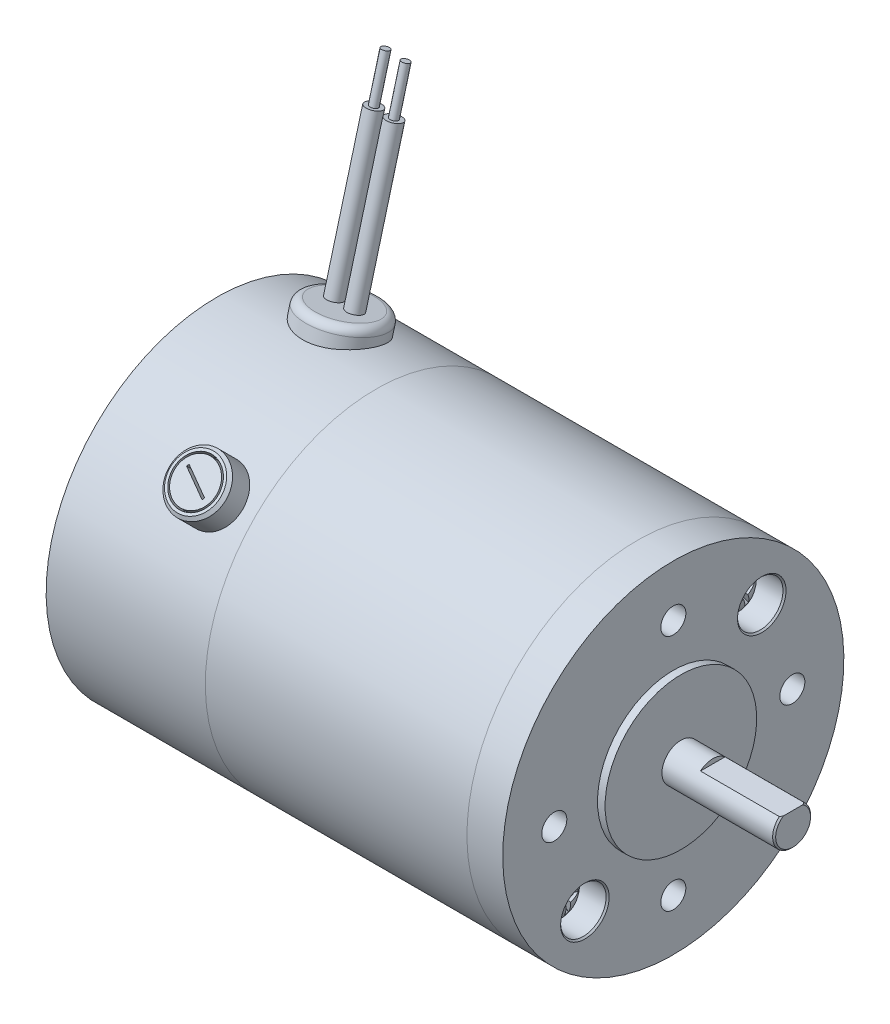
ISO-10303-21;
HEADER;
FILE_DESCRIPTION(('STEP AP214'),'2;1');
FILE_NAME('part.step','',(''),(''),'','','');
FILE_SCHEMA(('AUTOMOTIVE_DESIGN { 1 0 10303 214 1 1 1 1 }'));
ENDSEC;
DATA;
#1=APPLICATION_CONTEXT('core data for automotive mechanical design processes');
#2=APPLICATION_PROTOCOL_DEFINITION('international standard','automotive_design',2000,#1);
#3=PRODUCT_CONTEXT('',#1,'mechanical');
#4=PRODUCT('Part','Part','',(#3));
#5=PRODUCT_RELATED_PRODUCT_CATEGORY('part','',(#4));
#6=PRODUCT_DEFINITION_FORMATION('','',#4);
#7=PRODUCT_DEFINITION_CONTEXT('part definition',#1,'design');
#8=PRODUCT_DEFINITION('design','',#6,#7);
#9=PRODUCT_DEFINITION_SHAPE('','',#8);
#10=(LENGTH_UNIT() NAMED_UNIT(*) SI_UNIT(.MILLI.,.METRE.));
#11=(NAMED_UNIT(*) PLANE_ANGLE_UNIT() SI_UNIT($,.RADIAN.));
#12=(NAMED_UNIT(*) SI_UNIT($,.STERADIAN.) SOLID_ANGLE_UNIT());
#13=UNCERTAINTY_MEASURE_WITH_UNIT(LENGTH_MEASURE(1.E-05),#10,'distance_accuracy_value','');
#14=(GEOMETRIC_REPRESENTATION_CONTEXT(3) GLOBAL_UNCERTAINTY_ASSIGNED_CONTEXT((#13)) GLOBAL_UNIT_ASSIGNED_CONTEXT((#10,
#11,#12)) REPRESENTATION_CONTEXT('',''));
#15=CARTESIAN_POINT('',(0.,0.,0.));
#16=DIRECTION('',(0.,0.,1.));
#17=DIRECTION('',(1.,0.,0.));
#18=AXIS2_PLACEMENT_3D('',#15,#16,#17);
#19=CARTESIAN_POINT('',(69.15432,-14.8174225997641,14.8174225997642));
#20=DIRECTION('',(1.,0.,0.));
#21=DIRECTION('',(0.,0.989318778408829,0.145768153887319));
#22=AXIS2_PLACEMENT_3D('',#19,#20,#21);
#23=SPHERICAL_SURFACE('',#22,4.55168);
#24=CARTESIAN_POINT('',(71.9850083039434,-14.8174225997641,14.8174225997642));
#25=DIRECTION('',(1.,0.,0.));
#26=DIRECTION('',(0.,0.14576815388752,-0.989318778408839));
#27=AXIS2_PLACEMENT_3D('',#24,#25,#26);
#28=CIRCLE('',#27,3.56440661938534);
#29=CARTESIAN_POINT('',(71.9850083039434,-14.2978456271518,11.2910881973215));
#30=VERTEX_POINT('',#29);
#31=EDGE_CURVE('P0_E137',#30,#30,#28,.T.);
#32=ORIENTED_EDGE('',*,*,#31,.T.);
#33=EDGE_LOOP('',(#32));
#34=FACE_BOUND('',#33,.T.);
#35=CARTESIAN_POINT('',(69.1597859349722,-14.8708221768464,14.8095546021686));
#36=DIRECTION('',(0.100750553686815,-0.984284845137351,-0.145026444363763));
#37=DIRECTION('',(-0.994911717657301,-0.0996744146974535,-0.0146862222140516));
#38=AXIS2_PLACEMENT_3D('',#35,#36,#37);
#39=CIRCLE('',#38,4.55135666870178);
#40=CARTESIAN_POINT('',(73.0893217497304,-14.1474622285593,12.6300257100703));
#41=VERTEX_POINT('',#40);
#42=CARTESIAN_POINT('',(73.6702178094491,-14.3602362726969,14.4776602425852));
#43=VERTEX_POINT('',#42);
#44=EDGE_CURVE('P0_E168',#41,#43,#39,.T.);
#45=ORIENTED_EDGE('',*,*,#44,.F.);
#46=CARTESIAN_POINT('',(70.8081796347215,-14.9802031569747,15.9222034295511));
#47=DIRECTION('',(-0.8287665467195,0.0815710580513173,-0.55361735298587));
#48=DIRECTION('',(-0.55959450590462,-0.12080776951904,0.81991430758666));
#49=AXIS2_PLACEMENT_3D('',#46,#47,#48);
#50=CIRCLE('',#49,4.09090466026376);
#51=CARTESIAN_POINT('',(73.0893217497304,-14.8280177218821,12.5297513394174));
#52=VERTEX_POINT('',#51);
#53=EDGE_CURVE('P0_E133',#41,#52,#50,.T.);
#54=ORIENTED_EDGE('',*,*,#53,.T.);
#55=CARTESIAN_POINT('',(69.1597859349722,-14.764023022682,14.8252905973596));
#56=DIRECTION('',(0.100750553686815,0.984284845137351,0.145026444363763));
#57=DIRECTION('',(0.994911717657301,-0.0996744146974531,-0.0146862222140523));
#58=AXIS2_PLACEMENT_3D('',#55,#56,#57);
#59=CIRCLE('',#58,4.55135666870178);
#60=CARTESIAN_POINT('',(73.6702178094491,-15.1571849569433,14.3602362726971));
#61=VERTEX_POINT('',#60);
#62=EDGE_CURVE('P0_E89',#61,#52,#59,.T.);
#63=ORIENTED_EDGE('',*,*,#62,.F.);
#64=CARTESIAN_POINT('',(69.1597859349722,-14.8252905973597,14.8708221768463));
#65=DIRECTION('',(0.100750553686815,-0.145026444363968,0.984284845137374));
#66=DIRECTION('',(0.994911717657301,0.0146862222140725,-0.0996744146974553));
#67=AXIS2_PLACEMENT_3D('',#64,#65,#66);
#68=CIRCLE('',#67,4.55135666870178);
#69=CARTESIAN_POINT('',(73.0893217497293,-17.004819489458,14.1474622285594));
#70=VERTEX_POINT('',#69);
#71=EDGE_CURVE('P0_E114',#70,#61,#68,.T.);
#72=ORIENTED_EDGE('',*,*,#71,.F.);
#73=CARTESIAN_POINT('',(70.8081796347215,-13.712641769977,14.9802031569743));
#74=DIRECTION('',(-0.8287665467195,-0.553617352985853,-0.0815710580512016));
#75=DIRECTION('',(-0.55959450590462,0.819914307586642,0.120807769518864));
#76=AXIS2_PLACEMENT_3D('',#73,#74,#75);
#77=CIRCLE('',#76,4.09090466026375);
#78=CARTESIAN_POINT('',(73.0893217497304,-17.1050938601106,14.8280177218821));
#79=VERTEX_POINT('',#78);
#80=EDGE_CURVE('P0_E122',#70,#79,#77,.T.);
#81=ORIENTED_EDGE('',*,*,#80,.T.);
#82=CARTESIAN_POINT('',(69.1597859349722,-14.8095546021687,14.7640230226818));
#83=DIRECTION('',(0.100750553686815,0.145026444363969,-0.984284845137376));
#84=DIRECTION('',(-0.994911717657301,0.0146862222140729,-0.0996744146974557));
#85=AXIS2_PLACEMENT_3D('',#82,#83,#84);
#86=CIRCLE('',#85,4.55135666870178);
#87=CARTESIAN_POINT('',(73.6702178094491,-15.2746089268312,15.1571849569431));
#88=VERTEX_POINT('',#87);
#89=EDGE_CURVE('P0_E32',#88,#79,#86,.T.);
#90=ORIENTED_EDGE('',*,*,#89,.F.);
#91=CARTESIAN_POINT('',(73.0893217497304,-15.4873829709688,17.004819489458));
#92=VERTEX_POINT('',#91);
#93=EDGE_CURVE('P0_E175',#92,#88,#59,.T.);
#94=ORIENTED_EDGE('',*,*,#93,.F.);
#95=CARTESIAN_POINT('',(70.8081796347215,-14.6546420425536,13.7126417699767));
#96=DIRECTION('',(-0.8287665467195,-0.0815710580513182,0.553617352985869));
#97=DIRECTION('',(0.55959450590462,-0.120807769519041,0.819914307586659));
#98=AXIS2_PLACEMENT_3D('',#95,#96,#97);
#99=CIRCLE('',#98,4.09090466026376);
#100=CARTESIAN_POINT('',(73.0893217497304,-14.8068274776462,17.1050938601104));
#101=VERTEX_POINT('',#100);
#102=EDGE_CURVE('P0_E115',#92,#101,#99,.T.);
#103=ORIENTED_EDGE('',*,*,#102,.T.);
#104=CARTESIAN_POINT('',(73.6702178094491,-14.4776602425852,15.2746089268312));
#105=VERTEX_POINT('',#104);
#106=EDGE_CURVE('P0_E163',#105,#101,#39,.T.);
#107=ORIENTED_EDGE('',*,*,#106,.F.);
#108=CARTESIAN_POINT('',(73.0893217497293,-12.63002571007,15.4873829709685));
#109=VERTEX_POINT('',#108);
#110=EDGE_CURVE('P0_E25',#109,#105,#86,.T.);
#111=ORIENTED_EDGE('',*,*,#110,.F.);
#112=CARTESIAN_POINT('',(70.8081796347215,-15.9222034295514,14.6546420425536));
#113=DIRECTION('',(-0.8287665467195,0.553617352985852,0.0815710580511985));
#114=DIRECTION('',(0.55959450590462,0.81991430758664,0.120807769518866));
#115=AXIS2_PLACEMENT_3D('',#112,#113,#114);
#116=CIRCLE('',#115,4.09090466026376);
#117=CARTESIAN_POINT('',(73.0893217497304,-12.5297513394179,14.8068274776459));
#118=VERTEX_POINT('',#117);
#119=EDGE_CURVE('P0_E11',#109,#118,#116,.T.);
#120=ORIENTED_EDGE('',*,*,#119,.T.);
#121=EDGE_CURVE('P0_E151',#43,#118,#68,.T.);
#122=ORIENTED_EDGE('',*,*,#121,.F.);
#123=EDGE_LOOP('',(#45,#54,#63,#72,#81,#90,#94,#103,#107,#111,#120,#122));
#124=FACE_BOUND('',#123,.T.);
#125=ADVANCED_FACE('P0_F17',(#34,#124),#23,.T.);
#126=CARTESIAN_POINT('',(71.5621965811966,-14.8450173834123,15.0047065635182));
#127=DIRECTION('',(0.100750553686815,0.145026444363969,-0.984284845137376));
#128=DIRECTION('',(-0.994911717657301,0.0146862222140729,-0.0996744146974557));
#129=AXIS2_PLACEMENT_3D('',#126,#127,#128);
#130=PLANE('',#129);
#131=ORIENTED_EDGE('',*,*,#110,.T.);
#132=DIRECTION('',(-0.989900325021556,-0.0845601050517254,-0.113784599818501));
#133=VECTOR('',#132,1.);
#134=CARTESIAN_POINT('',(71.5434116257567,-14.6593380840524,15.0301421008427));
#135=LINE('',#134,#133);
#136=CARTESIAN_POINT('',(71.6994,-14.6460131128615,15.0480722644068));
#137=VERTEX_POINT('',#136);
#138=EDGE_CURVE('P0_E157',#105,#137,#135,.T.);
#139=ORIENTED_EDGE('',*,*,#138,.T.);
#140=DIRECTION('',(-0.558698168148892,-0.810353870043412,-0.176586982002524));
#141=VECTOR('',#140,1.);
#142=CARTESIAN_POINT('',(73.706,-11.735575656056,15.6822956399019));
#143=LINE('',#142,#141);
#144=EDGE_CURVE('P0_E138',#109,#137,#143,.T.);
#145=ORIENTED_EDGE('',*,*,#144,.F.);
#146=EDGE_LOOP('',(#131,#139,#145));
#147=FACE_BOUND('',#146,.T.);
#148=ADVANCED_FACE('P0_F156',(#147),#130,.T.);
#149=DIRECTION('',(-0.558698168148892,0.826848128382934,0.0646415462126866));
#150=VECTOR('',#149,1.);
#151=CARTESIAN_POINT('',(73.7060000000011,-18.017749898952,14.7566678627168));
#152=LINE('',#151,#150);
#153=CARTESIAN_POINT('',(71.6994,-15.0480722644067,14.9888320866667));
#154=VERTEX_POINT('',#153);
#155=EDGE_CURVE('P0_E123',#79,#154,#152,.T.);
#156=ORIENTED_EDGE('',*,*,#155,.T.);
#157=DIRECTION('',(0.989900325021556,-0.113784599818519,0.0845601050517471));
#158=VECTOR('',#157,1.);
#159=CARTESIAN_POINT('',(71.5434116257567,-15.030142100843,14.9755071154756));
#160=LINE('',#159,#158);
#161=EDGE_CURVE('P0_E178',#154,#88,#160,.T.);
#162=ORIENTED_EDGE('',*,*,#161,.T.);
#163=ORIENTED_EDGE('',*,*,#89,.T.);
#164=EDGE_LOOP('',(#156,#162,#163));
#165=FACE_BOUND('',#164,.T.);
#166=ADVANCED_FACE('P0_F193',(#165),#130,.T.);
#167=CARTESIAN_POINT('',(71.5621965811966,-14.789827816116,14.6301386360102));
#168=DIRECTION('',(0.100750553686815,-0.145026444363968,0.984284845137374));
#169=DIRECTION('',(0.994911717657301,0.0146862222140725,-0.0996744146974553));
#170=AXIS2_PLACEMENT_3D('',#167,#168,#169);
#171=PLANE('',#170);
#172=DIRECTION('',(-0.558698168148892,-0.826848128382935,-0.0646415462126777));
#173=VECTOR('',#172,1.);
#174=CARTESIAN_POINT('',(73.7060000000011,-11.6170953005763,14.8781773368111));
#175=LINE('',#174,#173);
#176=CARTESIAN_POINT('',(71.6994,-14.5867729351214,14.6460131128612));
#177=VERTEX_POINT('',#176);
#178=EDGE_CURVE('P0_E194',#118,#177,#175,.T.);
#179=ORIENTED_EDGE('',*,*,#178,.T.);
#180=DIRECTION('',(0.989900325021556,0.11378459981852,-0.0845601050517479));
#181=VECTOR('',#180,1.);
#182=CARTESIAN_POINT('',(71.5434116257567,-14.6047030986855,14.6593380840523));
#183=LINE('',#182,#181);
#184=EDGE_CURVE('P0_E172',#177,#43,#183,.T.);
#185=ORIENTED_EDGE('',*,*,#184,.T.);
#186=ORIENTED_EDGE('',*,*,#121,.T.);
#187=EDGE_LOOP('',(#179,#185,#186));
#188=FACE_BOUND('',#187,.T.);
#189=ADVANCED_FACE('P0_F198',(#188),#171,.T.);
#190=ORIENTED_EDGE('',*,*,#71,.T.);
#191=DIRECTION('',(-0.989900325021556,0.0845601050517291,0.113784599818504));
#192=VECTOR('',#191,1.);
#193=CARTESIAN_POINT('',(71.5434116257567,-14.9755071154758,14.6047030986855));
#194=LINE('',#193,#192);
#195=CARTESIAN_POINT('',(71.6994,-14.9888320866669,14.5867729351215));
#196=VERTEX_POINT('',#195);
#197=EDGE_CURVE('P0_E87',#61,#196,#194,.T.);
#198=ORIENTED_EDGE('',*,*,#197,.T.);
#199=DIRECTION('',(-0.558698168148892,0.810353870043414,0.176586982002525));
#200=VECTOR('',#199,1.);
#201=CARTESIAN_POINT('',(73.706,-17.8992695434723,13.952549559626));
#202=LINE('',#201,#200);
#203=EDGE_CURVE('P0_E112',#70,#196,#202,.T.);
#204=ORIENTED_EDGE('',*,*,#203,.F.);
#205=EDGE_LOOP('',(#190,#198,#204));
#206=FACE_BOUND('',#205,.T.);
#207=ADVANCED_FACE('P0_F111',(#206),#171,.T.);
#208=CARTESIAN_POINT('',(99.106,-14.8174225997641,14.8174225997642));
#209=DIRECTION('',(1.,0.,0.));
#210=DIRECTION('',(0.,0.14576815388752,-0.989318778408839));
#211=AXIS2_PLACEMENT_3D('',#208,#209,#210);
#212=CYLINDRICAL_SURFACE('',#211,1.905);
#213=CARTESIAN_POINT('',(64.816,-14.8174225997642,14.8174225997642));
#214=DIRECTION('',(1.,0.,0.));
#215=DIRECTION('',(0.,0.14576815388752,-0.989318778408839));
#216=AXIS2_PLACEMENT_3D('',#213,#214,#215);
#217=CIRCLE('',#216,1.905);
#218=CARTESIAN_POINT('',(64.816,-14.5397342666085,12.9327703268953));
#219=VERTEX_POINT('',#218);
#220=EDGE_CURVE('P0_E134',#219,#219,#217,.T.);
#221=ORIENTED_EDGE('',*,*,#220,.T.);
#222=EDGE_LOOP('',(#221));
#223=FACE_BOUND('',#222,.T.);
#224=CARTESIAN_POINT('',(71.166,-14.8174225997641,14.8174225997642));
#225=DIRECTION('',(1.,0.,0.));
#226=DIRECTION('',(0.,0.14576815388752,-0.989318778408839));
#227=AXIS2_PLACEMENT_3D('',#224,#225,#226);
#228=CIRCLE('',#227,1.905);
#229=CARTESIAN_POINT('',(71.166,-14.5397342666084,12.9327703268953));
#230=VERTEX_POINT('',#229);
#231=EDGE_CURVE('P0_E147',#230,#230,#228,.T.);
#232=ORIENTED_EDGE('',*,*,#231,.F.);
#233=EDGE_LOOP('',(#232));
#234=FACE_BOUND('',#233,.T.);
#235=ADVANCED_FACE('P0_F19',(#223,#234),#212,.T.);
#236=CARTESIAN_POINT('',(71.166,-12.9327703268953,15.0951109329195));
#237=DIRECTION('',(1.,0.,0.));
#238=DIRECTION('',(0.,0.14576815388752,-0.989318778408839));
#239=AXIS2_PLACEMENT_3D('',#236,#237,#238);
#240=PLANE('',#239);
#241=CARTESIAN_POINT('',(71.166,-14.8174225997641,14.8174225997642));
#242=DIRECTION('',(1.,0.,0.));
#243=DIRECTION('',(0.,0.14576815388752,-0.989318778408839));
#244=AXIS2_PLACEMENT_3D('',#241,#242,#243);
#245=CIRCLE('',#244,3.6195);
#246=CARTESIAN_POINT('',(71.166,-14.2898147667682,11.2365832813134));
#247=VERTEX_POINT('',#246);
#248=EDGE_CURVE('P0_E144',#247,#247,#245,.T.);
#249=ORIENTED_EDGE('',*,*,#248,.F.);
#250=EDGE_LOOP('',(#249));
#251=FACE_BOUND('',#250,.T.);
#252=ORIENTED_EDGE('',*,*,#231,.T.);
#253=EDGE_LOOP('',(#252));
#254=FACE_BOUND('',#253,.T.);
#255=ADVANCED_FACE('P0_F227',(#251,#254),#240,.F.);
#256=CARTESIAN_POINT('',(99.106,-14.8174225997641,14.8174225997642));
#257=DIRECTION('',(1.,0.,0.));
#258=DIRECTION('',(0.,0.14576815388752,-0.989318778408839));
#259=AXIS2_PLACEMENT_3D('',#256,#257,#258);
#260=CYLINDRICAL_SURFACE('',#259,3.6195);
#261=ORIENTED_EDGE('',*,*,#248,.T.);
#262=EDGE_LOOP('',(#261));
#263=FACE_BOUND('',#262,.T.);
#264=CARTESIAN_POINT('',(71.8270457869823,-14.8174225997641,14.8174225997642));
#265=DIRECTION('',(1.,0.,0.));
#266=DIRECTION('',(0.,0.14576815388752,-0.989318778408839));
#267=AXIS2_PLACEMENT_3D('',#264,#265,#266);
#268=CIRCLE('',#267,3.6195);
#269=CARTESIAN_POINT('',(71.8270457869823,-14.2898147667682,11.2365832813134));
#270=VERTEX_POINT('',#269);
#271=EDGE_CURVE('P0_E141',#270,#270,#268,.T.);
#272=ORIENTED_EDGE('',*,*,#271,.F.);
#273=EDGE_LOOP('',(#272));
#274=FACE_BOUND('',#273,.T.);
#275=ADVANCED_FACE('P0_F224',(#263,#274),#260,.T.);
#276=CARTESIAN_POINT('',(71.8270457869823,-14.8174225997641,14.8174225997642));
#277=DIRECTION('',(1.,0.,0.));
#278=DIRECTION('',(0.,0.14576815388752,-0.989318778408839));
#279=AXIS2_PLACEMENT_3D('',#276,#277,#278);
#280=TOROIDAL_SURFACE('',#279,3.3655,0.254);
#281=ORIENTED_EDGE('',*,*,#271,.T.);
#282=EDGE_LOOP('',(#281));
#283=FACE_BOUND('',#282,.T.);
#284=ORIENTED_EDGE('',*,*,#31,.F.);
#285=EDGE_LOOP('',(#284));
#286=FACE_BOUND('',#285,.T.);
#287=ADVANCED_FACE('P0_F221',(#283,#286),#280,.T.);
#288=CARTESIAN_POINT('',(64.816,-12.9327703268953,15.0951109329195));
#289=DIRECTION('',(-1.,0.,0.));
#290=DIRECTION('',(0.,-0.14576815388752,0.989318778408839));
#291=AXIS2_PLACEMENT_3D('',#288,#289,#290);
#292=PLANE('',#291);
#293=ORIENTED_EDGE('',*,*,#220,.F.);
#294=EDGE_LOOP('',(#293));
#295=FACE_BOUND('',#294,.T.);
#296=ADVANCED_FACE('P0_F219',(#295),#292,.T.);
#297=CARTESIAN_POINT('',(71.6994,-14.5867729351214,14.6460131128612));
#298=DIRECTION('',(-0.8287665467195,0.553617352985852,0.0815710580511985));
#299=DIRECTION('',(0.55959450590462,0.81991430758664,0.120807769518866));
#300=AXIS2_PLACEMENT_3D('',#297,#298,#299);
#301=PLANE('',#300);
#302=ORIENTED_EDGE('',*,*,#144,.T.);
#303=DIRECTION('',(0.,-0.145768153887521,0.98931877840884));
#304=VECTOR('',#303,1.);
#305=CARTESIAN_POINT('',(71.6994,-14.5867729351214,14.6460131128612));
#306=LINE('',#305,#304);
#307=EDGE_CURVE('P0_E105',#177,#137,#306,.T.);
#308=ORIENTED_EDGE('',*,*,#307,.F.);
#309=ORIENTED_EDGE('',*,*,#178,.F.);
#310=ORIENTED_EDGE('',*,*,#119,.F.);
#311=EDGE_LOOP('',(#302,#308,#309,#310));
#312=FACE_BOUND('',#311,.T.);
#313=ADVANCED_FACE('P0_F197',(#312),#301,.F.);
#314=CARTESIAN_POINT('',(71.6994,-15.0480722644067,14.9888320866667));
#315=DIRECTION('',(-0.8287665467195,-0.553617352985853,-0.0815710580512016));
#316=DIRECTION('',(-0.55959450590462,0.819914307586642,0.120807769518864));
#317=AXIS2_PLACEMENT_3D('',#314,#315,#316);
#318=PLANE('',#317);
#319=ORIENTED_EDGE('',*,*,#203,.T.);
#320=DIRECTION('',(0.,0.14576815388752,-0.989318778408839));
#321=VECTOR('',#320,1.);
#322=CARTESIAN_POINT('',(71.6994,-15.0480722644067,14.9888320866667));
#323=LINE('',#322,#321);
#324=EDGE_CURVE('P0_E104',#154,#196,#323,.T.);
#325=ORIENTED_EDGE('',*,*,#324,.F.);
#326=ORIENTED_EDGE('',*,*,#155,.F.);
#327=ORIENTED_EDGE('',*,*,#80,.F.);
#328=EDGE_LOOP('',(#319,#325,#326,#327));
#329=FACE_BOUND('',#328,.T.);
#330=ADVANCED_FACE('P0_F119',(#329),#318,.F.);
#331=CARTESIAN_POINT('',(71.6994,-14.6460131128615,15.0480722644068));
#332=DIRECTION('',(1.,0.,0.));
#333=DIRECTION('',(0.,0.14576815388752,-0.989318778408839));
#334=AXIS2_PLACEMENT_3D('',#331,#332,#333);
#335=PLANE('',#334);
#336=DIRECTION('',(0.,0.989318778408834,0.145768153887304));
#337=VECTOR('',#336,1.);
#338=CARTESIAN_POINT('',(71.6994,-15.0480722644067,14.9888320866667));
#339=LINE('',#338,#337);
#340=EDGE_CURVE('P0_E127',#154,#137,#339,.T.);
#341=ORIENTED_EDGE('',*,*,#340,.F.);
#342=ORIENTED_EDGE('',*,*,#324,.T.);
#343=DIRECTION('',(0.,-0.989318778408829,-0.145768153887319));
#344=VECTOR('',#343,1.);
#345=CARTESIAN_POINT('',(71.6994,-14.5867729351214,14.6460131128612));
#346=LINE('',#345,#344);
#347=EDGE_CURVE('P0_E96',#177,#196,#346,.T.);
#348=ORIENTED_EDGE('',*,*,#347,.F.);
#349=ORIENTED_EDGE('',*,*,#307,.T.);
#350=EDGE_LOOP('',(#341,#342,#348,#349));
#351=FACE_BOUND('',#350,.T.);
#352=ADVANCED_FACE('P0_F125',(#351),#335,.T.);
#353=CARTESIAN_POINT('',(71.6994,-14.6460131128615,15.0480722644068));
#354=DIRECTION('',(-0.8287665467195,-0.0815710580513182,0.553617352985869));
#355=DIRECTION('',(-0.55959450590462,0.120807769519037,-0.819914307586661));
#356=AXIS2_PLACEMENT_3D('',#353,#354,#355);
#357=PLANE('',#356);
#358=DIRECTION('',(-0.558698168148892,0.176586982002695,-0.810353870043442));
#359=VECTOR('',#358,1.);
#360=CARTESIAN_POINT('',(73.7060000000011,-15.6822956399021,17.8992695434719));
#361=LINE('',#360,#359);
#362=EDGE_CURVE('P0_E183',#92,#154,#361,.T.);
#363=ORIENTED_EDGE('',*,*,#362,.T.);
#364=ORIENTED_EDGE('',*,*,#340,.T.);
#365=DIRECTION('',(-0.558698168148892,0.0646415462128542,-0.826848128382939));
#366=VECTOR('',#365,1.);
#367=CARTESIAN_POINT('',(73.7060000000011,-14.8781773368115,18.0177498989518));
#368=LINE('',#367,#366);
#369=EDGE_CURVE('P0_E93',#101,#137,#368,.T.);
#370=ORIENTED_EDGE('',*,*,#369,.F.);
#371=ORIENTED_EDGE('',*,*,#102,.F.);
#372=EDGE_LOOP('',(#363,#364,#370,#371));
#373=FACE_BOUND('',#372,.T.);
#374=ADVANCED_FACE('P0_F188',(#373),#357,.F.);
#375=CARTESIAN_POINT('',(71.5621965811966,-15.0047065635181,14.7898278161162));
#376=DIRECTION('',(0.100750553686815,0.984284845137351,0.145026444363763));
#377=DIRECTION('',(0.994911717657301,-0.0996744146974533,-0.0146862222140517));
#378=AXIS2_PLACEMENT_3D('',#375,#376,#377);
#379=PLANE('',#378);
#380=ORIENTED_EDGE('',*,*,#93,.T.);
#381=ORIENTED_EDGE('',*,*,#161,.F.);
#382=ORIENTED_EDGE('',*,*,#362,.F.);
#383=EDGE_LOOP('',(#380,#381,#382));
#384=FACE_BOUND('',#383,.T.);
#385=ADVANCED_FACE('P0_F192',(#384),#379,.T.);
#386=CARTESIAN_POINT('',(71.5621965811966,-14.6301386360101,14.845017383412));
#387=DIRECTION('',(0.100750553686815,-0.984284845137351,-0.145026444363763));
#388=DIRECTION('',(-0.994911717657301,-0.0996744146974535,-0.0146862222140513));
#389=AXIS2_PLACEMENT_3D('',#386,#387,#388);
#390=PLANE('',#389);
#391=ORIENTED_EDGE('',*,*,#106,.T.);
#392=ORIENTED_EDGE('',*,*,#369,.T.);
#393=ORIENTED_EDGE('',*,*,#138,.F.);
#394=EDGE_LOOP('',(#391,#392,#393));
#395=FACE_BOUND('',#394,.T.);
#396=ADVANCED_FACE('P0_F186',(#395),#390,.T.);
#397=CARTESIAN_POINT('',(71.6994,-14.9888320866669,14.5867729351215));
#398=DIRECTION('',(-0.8287665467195,0.0815710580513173,-0.55361735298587));
#399=DIRECTION('',(0.55959450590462,0.120807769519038,-0.81991430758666));
#400=AXIS2_PLACEMENT_3D('',#397,#398,#399);
#401=PLANE('',#400);
#402=DIRECTION('',(-0.558698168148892,-0.176586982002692,0.81035387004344));
#403=VECTOR('',#402,1.);
#404=CARTESIAN_POINT('',(73.7060000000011,-13.9525495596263,11.7355756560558));
#405=LINE('',#404,#403);
#406=EDGE_CURVE('P0_E92',#41,#177,#405,.T.);
#407=ORIENTED_EDGE('',*,*,#406,.T.);
#408=ORIENTED_EDGE('',*,*,#347,.T.);
#409=DIRECTION('',(-0.558698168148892,-0.064641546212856,0.82684812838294));
#410=VECTOR('',#409,1.);
#411=CARTESIAN_POINT('',(73.7060000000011,-14.7566678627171,11.6170953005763));
#412=LINE('',#411,#410);
#413=EDGE_CURVE('P0_E83',#52,#196,#412,.T.);
#414=ORIENTED_EDGE('',*,*,#413,.F.);
#415=ORIENTED_EDGE('',*,*,#53,.F.);
#416=EDGE_LOOP('',(#407,#408,#414,#415));
#417=FACE_BOUND('',#416,.T.);
#418=ADVANCED_FACE('P0_F97',(#417),#401,.F.);
#419=ORIENTED_EDGE('',*,*,#44,.T.);
#420=ORIENTED_EDGE('',*,*,#184,.F.);
#421=ORIENTED_EDGE('',*,*,#406,.F.);
#422=EDGE_LOOP('',(#419,#420,#421));
#423=FACE_BOUND('',#422,.T.);
#424=ADVANCED_FACE('P0_F199',(#423),#390,.T.);
#425=ORIENTED_EDGE('',*,*,#62,.T.);
#426=ORIENTED_EDGE('',*,*,#413,.T.);
#427=ORIENTED_EDGE('',*,*,#197,.F.);
#428=EDGE_LOOP('',(#425,#426,#427));
#429=FACE_BOUND('',#428,.T.);
#430=ADVANCED_FACE('P0_F85',(#429),#379,.T.);
#431=CLOSED_SHELL('',(#125,#148,#166,#189,#207,#235,#255,#275,#287,#296,#313,#330,#352,#374,
#385,#396,#418,#424,#430));
#432=MANIFOLD_SOLID_BREP('P0_B1',#431);
#433=CARTESIAN_POINT('',(76.5,0.,0.));
#434=DIRECTION('',(-1.,0.,0.));
#435=DIRECTION('',(0.,0.707106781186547,0.70710678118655));
#436=AXIS2_PLACEMENT_3D('',#433,#434,#435);
#437=PLANE('',#436);
#438=CARTESIAN_POINT('',(76.5,14.8174225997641,-14.8174225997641));
#439=DIRECTION('',(-1.,0.,0.));
#440=DIRECTION('',(0.,0.707106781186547,0.70710678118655));
#441=AXIS2_PLACEMENT_3D('',#438,#439,#440);
#442=CIRCLE('',#441,4.06399999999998);
#443=CARTESIAN_POINT('',(76.5,17.6911045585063,-11.943740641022));
#444=VERTEX_POINT('',#443);
#445=EDGE_CURVE('P1_E22',#444,#444,#442,.T.);
#446=ORIENTED_EDGE('',*,*,#445,.T.);
#447=EDGE_LOOP('',(#446));
#448=FACE_BOUND('',#447,.T.);
#449=CARTESIAN_POINT('',(76.5,-14.8174225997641,14.8174225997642));
#450=DIRECTION('',(-1.,0.,0.));
#451=DIRECTION('',(0.,0.707106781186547,0.70710678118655));
#452=AXIS2_PLACEMENT_3D('',#449,#450,#451);
#453=CIRCLE('',#452,4.06400000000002);
#454=CARTESIAN_POINT('',(76.5,-11.943740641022,17.6911045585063));
#455=VERTEX_POINT('',#454);
#456=EDGE_CURVE('P1_E26',#455,#455,#453,.T.);
#457=ORIENTED_EDGE('',*,*,#456,.T.);
#458=EDGE_LOOP('',(#457));
#459=FACE_BOUND('',#458,.T.);
#460=CARTESIAN_POINT('',(76.5,0.,-19.94));
#461=DIRECTION('',(1.,0.,0.));
#462=DIRECTION('',(0.,-0.707106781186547,-0.70710678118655));
#463=AXIS2_PLACEMENT_3D('',#460,#461,#462);
#464=CIRCLE('',#463,2.1);
#465=CARTESIAN_POINT('',(76.5,-1.48492424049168,-21.4249242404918));
#466=VERTEX_POINT('',#465);
#467=EDGE_CURVE('P1_E68',#466,#466,#464,.T.);
#468=ORIENTED_EDGE('',*,*,#467,.F.);
#469=EDGE_LOOP('',(#468));
#470=FACE_BOUND('',#469,.T.);
#471=CARTESIAN_POINT('',(76.5,-19.94,0.));
#472=DIRECTION('',(1.,0.,0.));
#473=DIRECTION('',(0.,-0.707106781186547,-0.70710678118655));
#474=AXIS2_PLACEMENT_3D('',#471,#472,#473);
#475=CIRCLE('',#474,2.1);
#476=CARTESIAN_POINT('',(76.5,-21.4249242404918,-1.48492424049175));
#477=VERTEX_POINT('',#476);
#478=EDGE_CURVE('P1_E62',#477,#477,#475,.T.);
#479=ORIENTED_EDGE('',*,*,#478,.F.);
#480=EDGE_LOOP('',(#479));
#481=FACE_BOUND('',#480,.T.);
#482=CARTESIAN_POINT('',(76.5,0.,19.94));
#483=DIRECTION('',(1.,0.,0.));
#484=DIRECTION('',(0.,-0.707106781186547,-0.70710678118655));
#485=AXIS2_PLACEMENT_3D('',#482,#483,#484);
#486=CIRCLE('',#485,2.1);
#487=CARTESIAN_POINT('',(76.5,-1.48492424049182,18.4550757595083));
#488=VERTEX_POINT('',#487);
#489=EDGE_CURVE('P1_E56',#488,#488,#486,.T.);
#490=ORIENTED_EDGE('',*,*,#489,.F.);
#491=EDGE_LOOP('',(#490));
#492=FACE_BOUND('',#491,.T.);
#493=CARTESIAN_POINT('',(76.5,19.94,0.));
#494=DIRECTION('',(1.,0.,0.));
#495=DIRECTION('',(0.,-0.707106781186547,-0.70710678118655));
#496=AXIS2_PLACEMENT_3D('',#493,#494,#495);
#497=CIRCLE('',#496,2.1);
#498=CARTESIAN_POINT('',(76.5,18.4550757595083,-1.48492424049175));
#499=VERTEX_POINT('',#498);
#500=EDGE_CURVE('P1_E50',#499,#499,#497,.T.);
#501=ORIENTED_EDGE('',*,*,#500,.F.);
#502=EDGE_LOOP('',(#501));
#503=FACE_BOUND('',#502,.T.);
#504=CARTESIAN_POINT('',(76.5,0.,0.));
#505=DIRECTION('',(-1.,0.,0.));
#506=DIRECTION('',(0.,0.707106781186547,0.70710678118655));
#507=AXIS2_PLACEMENT_3D('',#504,#505,#506);
#508=CIRCLE('',#507,28.575);
#509=CARTESIAN_POINT('',(76.5,20.2055762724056,20.2055762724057));
#510=VERTEX_POINT('',#509);
#511=EDGE_CURVE('P1_E39',#510,#510,#508,.T.);
#512=ORIENTED_EDGE('',*,*,#511,.F.);
#513=EDGE_LOOP('',(#512));
#514=FACE_BOUND('',#513,.T.);
#515=CARTESIAN_POINT('',(76.5,0.,0.));
#516=DIRECTION('',(-1.,0.,0.));
#517=DIRECTION('',(0.,0.707106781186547,0.70710678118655));
#518=AXIS2_PLACEMENT_3D('',#515,#516,#517);
#519=CIRCLE('',#518,12.7);
#520=CARTESIAN_POINT('',(76.5,8.98025612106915,8.98025612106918));
#521=VERTEX_POINT('',#520);
#522=EDGE_CURVE('P1_E35',#521,#521,#519,.F.);
#523=ORIENTED_EDGE('',*,*,#522,.F.);
#524=EDGE_LOOP('',(#523));
#525=FACE_BOUND('',#524,.T.);
#526=ADVANCED_FACE('P1_F15',(#448,#459,#470,#481,#492,#503,#514,#525),#437,.F.);
#527=CARTESIAN_POINT('',(70.500012,0.,0.));
#528=DIRECTION('',(1.,0.,0.));
#529=DIRECTION('',(0.,-0.707106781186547,-0.70710678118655));
#530=AXIS2_PLACEMENT_3D('',#527,#528,#529);
#531=CYLINDRICAL_SURFACE('',#530,28.575);
#532=CARTESIAN_POINT('',(70.500012,0.,0.));
#533=DIRECTION('',(-1.,0.,0.));
#534=DIRECTION('',(0.,0.707106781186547,0.70710678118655));
#535=AXIS2_PLACEMENT_3D('',#532,#533,#534);
#536=CIRCLE('',#535,28.575);
#537=CARTESIAN_POINT('',(70.500012,20.2055762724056,20.2055762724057));
#538=VERTEX_POINT('',#537);
#539=EDGE_CURVE('P1_E38',#538,#538,#536,.T.);
#540=ORIENTED_EDGE('',*,*,#539,.F.);
#541=EDGE_LOOP('',(#540));
#542=FACE_BOUND('',#541,.T.);
#543=ORIENTED_EDGE('',*,*,#511,.T.);
#544=EDGE_LOOP('',(#543));
#545=FACE_BOUND('',#544,.T.);
#546=ADVANCED_FACE('P1_F95',(#542,#545),#531,.T.);
#547=CARTESIAN_POINT('',(70.500012,0.,0.));
#548=DIRECTION('',(-1.,0.,0.));
#549=DIRECTION('',(0.,0.707106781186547,0.70710678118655));
#550=AXIS2_PLACEMENT_3D('',#547,#548,#549);
#551=PLANE('',#550);
#552=CARTESIAN_POINT('',(70.500012,0.,-19.94));
#553=DIRECTION('',(-1.,0.,0.));
#554=DIRECTION('',(0.,0.707106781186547,0.70710678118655));
#555=AXIS2_PLACEMENT_3D('',#552,#553,#554);
#556=CIRCLE('',#555,2.1);
#557=CARTESIAN_POINT('',(70.500012,1.48492424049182,-18.4550757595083));
#558=VERTEX_POINT('',#557);
#559=EDGE_CURVE('P1_E65',#558,#558,#556,.T.);
#560=ORIENTED_EDGE('',*,*,#559,.F.);
#561=EDGE_LOOP('',(#560));
#562=FACE_BOUND('',#561,.T.);
#563=CARTESIAN_POINT('',(70.500012,-19.94,0.));
#564=DIRECTION('',(-1.,0.,0.));
#565=DIRECTION('',(0.,0.707106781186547,0.70710678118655));
#566=AXIS2_PLACEMENT_3D('',#563,#564,#565);
#567=CIRCLE('',#566,2.1);
#568=CARTESIAN_POINT('',(70.500012,-18.4550757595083,1.48492424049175));
#569=VERTEX_POINT('',#568);
#570=EDGE_CURVE('P1_E59',#569,#569,#567,.T.);
#571=ORIENTED_EDGE('',*,*,#570,.F.);
#572=EDGE_LOOP('',(#571));
#573=FACE_BOUND('',#572,.T.);
#574=CARTESIAN_POINT('',(70.500012,0.,19.94));
#575=DIRECTION('',(-1.,0.,0.));
#576=DIRECTION('',(0.,0.707106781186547,0.70710678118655));
#577=AXIS2_PLACEMENT_3D('',#574,#575,#576);
#578=CIRCLE('',#577,2.1);
#579=CARTESIAN_POINT('',(70.500012,1.48492424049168,21.4249242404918));
#580=VERTEX_POINT('',#579);
#581=EDGE_CURVE('P1_E53',#580,#580,#578,.T.);
#582=ORIENTED_EDGE('',*,*,#581,.F.);
#583=EDGE_LOOP('',(#582));
#584=FACE_BOUND('',#583,.T.);
#585=CARTESIAN_POINT('',(70.500012,19.94,0.));
#586=DIRECTION('',(-1.,0.,0.));
#587=DIRECTION('',(0.,0.707106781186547,0.70710678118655));
#588=AXIS2_PLACEMENT_3D('',#585,#586,#587);
#589=CIRCLE('',#588,2.1);
#590=CARTESIAN_POINT('',(70.500012,21.4249242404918,1.48492424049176));
#591=VERTEX_POINT('',#590);
#592=EDGE_CURVE('P1_E47',#591,#591,#589,.T.);
#593=ORIENTED_EDGE('',*,*,#592,.F.);
#594=EDGE_LOOP('',(#593));
#595=FACE_BOUND('',#594,.T.);
#596=ORIENTED_EDGE('',*,*,#539,.T.);
#597=EDGE_LOOP('',(#596));
#598=FACE_BOUND('',#597,.T.);
#599=ADVANCED_FACE('P1_F100',(#562,#573,#584,#595,#598),#551,.T.);
#600=CARTESIAN_POINT('',(77.77,0.,0.));
#601=DIRECTION('',(-1.,0.,0.));
#602=DIRECTION('',(0.,0.707106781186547,0.70710678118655));
#603=AXIS2_PLACEMENT_3D('',#600,#601,#602);
#604=CYLINDRICAL_SURFACE('',#603,12.7);
#605=CARTESIAN_POINT('',(77.77,0.,0.));
#606=DIRECTION('',(1.,0.,0.));
#607=DIRECTION('',(0.,-0.707106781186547,-0.70710678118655));
#608=AXIS2_PLACEMENT_3D('',#605,#606,#607);
#609=CIRCLE('',#608,12.7);
#610=CARTESIAN_POINT('',(77.77,-8.98025612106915,-8.98025612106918));
#611=VERTEX_POINT('',#610);
#612=EDGE_CURVE('P1_E42',#611,#611,#609,.T.);
#613=ORIENTED_EDGE('',*,*,#612,.F.);
#614=EDGE_LOOP('',(#613));
#615=FACE_BOUND('',#614,.T.);
#616=ORIENTED_EDGE('',*,*,#522,.T.);
#617=EDGE_LOOP('',(#616));
#618=FACE_BOUND('',#617,.T.);
#619=ADVANCED_FACE('P1_F140',(#615,#618),#604,.T.);
#620=CARTESIAN_POINT('',(77.77,0.,0.));
#621=DIRECTION('',(1.,0.,0.));
#622=DIRECTION('',(0.,-0.707106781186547,-0.70710678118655));
#623=AXIS2_PLACEMENT_3D('',#620,#621,#622);
#624=PLANE('',#623);
#625=ORIENTED_EDGE('',*,*,#612,.T.);
#626=EDGE_LOOP('',(#625));
#627=FACE_BOUND('',#626,.T.);
#628=ADVANCED_FACE('P1_F137',(#627),#624,.T.);
#629=CARTESIAN_POINT('',(76.5,19.94,0.));
#630=DIRECTION('',(1.,0.,0.));
#631=DIRECTION('',(0.,-0.707106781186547,-0.70710678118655));
#632=AXIS2_PLACEMENT_3D('',#629,#630,#631);
#633=CYLINDRICAL_SURFACE('',#632,2.1);
#634=ORIENTED_EDGE('',*,*,#592,.T.);
#635=EDGE_LOOP('',(#634));
#636=FACE_BOUND('',#635,.T.);
#637=ORIENTED_EDGE('',*,*,#500,.T.);
#638=EDGE_LOOP('',(#637));
#639=FACE_BOUND('',#638,.T.);
#640=ADVANCED_FACE('P1_F133',(#636,#639),#633,.F.);
#641=CARTESIAN_POINT('',(76.5,0.,19.94));
#642=DIRECTION('',(1.,0.,0.));
#643=DIRECTION('',(0.,-0.707106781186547,-0.70710678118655));
#644=AXIS2_PLACEMENT_3D('',#641,#642,#643);
#645=CYLINDRICAL_SURFACE('',#644,2.1);
#646=ORIENTED_EDGE('',*,*,#581,.T.);
#647=EDGE_LOOP('',(#646));
#648=FACE_BOUND('',#647,.T.);
#649=ORIENTED_EDGE('',*,*,#489,.T.);
#650=EDGE_LOOP('',(#649));
#651=FACE_BOUND('',#650,.T.);
#652=ADVANCED_FACE('P1_F129',(#648,#651),#645,.F.);
#653=CARTESIAN_POINT('',(76.5,-19.94,0.));
#654=DIRECTION('',(1.,0.,0.));
#655=DIRECTION('',(0.,-0.707106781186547,-0.70710678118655));
#656=AXIS2_PLACEMENT_3D('',#653,#654,#655);
#657=CYLINDRICAL_SURFACE('',#656,2.1);
#658=ORIENTED_EDGE('',*,*,#570,.T.);
#659=EDGE_LOOP('',(#658));
#660=FACE_BOUND('',#659,.T.);
#661=ORIENTED_EDGE('',*,*,#478,.T.);
#662=EDGE_LOOP('',(#661));
#663=FACE_BOUND('',#662,.T.);
#664=ADVANCED_FACE('P1_F123',(#660,#663),#657,.F.);
#665=CARTESIAN_POINT('',(76.5,0.,-19.94));
#666=DIRECTION('',(1.,0.,0.));
#667=DIRECTION('',(0.,-0.707106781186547,-0.70710678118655));
#668=AXIS2_PLACEMENT_3D('',#665,#666,#667);
#669=CYLINDRICAL_SURFACE('',#668,2.1);
#670=ORIENTED_EDGE('',*,*,#559,.T.);
#671=EDGE_LOOP('',(#670));
#672=FACE_BOUND('',#671,.T.);
#673=ORIENTED_EDGE('',*,*,#467,.T.);
#674=EDGE_LOOP('',(#673));
#675=FACE_BOUND('',#674,.T.);
#676=ADVANCED_FACE('P1_F117',(#672,#675),#669,.F.);
#677=CARTESIAN_POINT('',(71.166,14.8174225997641,-14.8174225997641));
#678=DIRECTION('',(1.,0.,0.));
#679=DIRECTION('',(0.,-0.707106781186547,-0.70710678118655));
#680=AXIS2_PLACEMENT_3D('',#677,#678,#679);
#681=CYLINDRICAL_SURFACE('',#680,3.81);
#682=CARTESIAN_POINT('',(76.246,14.8174225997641,-14.8174225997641));
#683=DIRECTION('',(-1.,0.,0.));
#684=DIRECTION('',(0.,0.707106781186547,0.70710678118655));
#685=AXIS2_PLACEMENT_3D('',#682,#683,#684);
#686=CIRCLE('',#685,3.81);
#687=CARTESIAN_POINT('',(76.246,17.5114994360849,-12.1233457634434));
#688=VERTEX_POINT('',#687);
#689=EDGE_CURVE('P1_E30',#688,#688,#686,.F.);
#690=ORIENTED_EDGE('',*,*,#689,.T.);
#691=EDGE_LOOP('',(#690));
#692=FACE_BOUND('',#691,.T.);
#693=CARTESIAN_POINT('',(71.166,14.8174225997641,-14.8174225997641));
#694=DIRECTION('',(1.,0.,0.));
#695=DIRECTION('',(0.,-0.707106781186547,-0.70710678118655));
#696=AXIS2_PLACEMENT_3D('',#693,#694,#695);
#697=CIRCLE('',#696,3.81);
#698=CARTESIAN_POINT('',(71.166,12.1233457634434,-17.5114994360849));
#699=VERTEX_POINT('',#698);
#700=EDGE_CURVE('P1_E72',#699,#699,#697,.T.);
#701=ORIENTED_EDGE('',*,*,#700,.F.);
#702=EDGE_LOOP('',(#701));
#703=FACE_BOUND('',#702,.T.);
#704=ADVANCED_FACE('P1_F91',(#692,#703),#681,.F.);
#705=CARTESIAN_POINT('',(71.166,14.8174225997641,-14.8174225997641));
#706=DIRECTION('',(1.,0.,0.));
#707=DIRECTION('',(0.,-0.707106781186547,-0.70710678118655));
#708=AXIS2_PLACEMENT_3D('',#705,#706,#707);
#709=PLANE('',#708);
#710=ORIENTED_EDGE('',*,*,#700,.T.);
#711=EDGE_LOOP('',(#710));
#712=FACE_BOUND('',#711,.T.);
#713=ADVANCED_FACE('P1_F82',(#712),#709,.T.);
#714=CARTESIAN_POINT('',(71.166,-14.8174225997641,14.8174225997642));
#715=DIRECTION('',(1.,0.,0.));
#716=DIRECTION('',(0.,-0.707106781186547,-0.70710678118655));
#717=AXIS2_PLACEMENT_3D('',#714,#715,#716);
#718=CYLINDRICAL_SURFACE('',#717,3.81);
#719=CARTESIAN_POINT('',(76.246,-14.8174225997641,14.8174225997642));
#720=DIRECTION('',(-1.,0.,0.));
#721=DIRECTION('',(0.,0.707106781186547,0.70710678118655));
#722=AXIS2_PLACEMENT_3D('',#719,#720,#721);
#723=CIRCLE('',#722,3.81);
#724=CARTESIAN_POINT('',(76.246,-12.1233457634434,17.5114994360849));
#725=VERTEX_POINT('',#724);
#726=EDGE_CURVE('P1_E10',#725,#725,#723,.F.);
#727=ORIENTED_EDGE('',*,*,#726,.T.);
#728=EDGE_LOOP('',(#727));
#729=FACE_BOUND('',#728,.T.);
#730=CARTESIAN_POINT('',(71.166,-14.8174225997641,14.8174225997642));
#731=DIRECTION('',(1.,0.,0.));
#732=DIRECTION('',(0.,-0.707106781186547,-0.70710678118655));
#733=AXIS2_PLACEMENT_3D('',#730,#731,#732);
#734=CIRCLE('',#733,3.81);
#735=CARTESIAN_POINT('',(71.166,-17.5114994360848,12.1233457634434));
#736=VERTEX_POINT('',#735);
#737=EDGE_CURVE('P1_E71',#736,#736,#734,.T.);
#738=ORIENTED_EDGE('',*,*,#737,.F.);
#739=EDGE_LOOP('',(#738));
#740=FACE_BOUND('',#739,.T.);
#741=ADVANCED_FACE('P1_F80',(#729,#740),#718,.F.);
#742=CARTESIAN_POINT('',(71.166,-14.8174225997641,14.8174225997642));
#743=DIRECTION('',(1.,0.,0.));
#744=DIRECTION('',(0.,-0.707106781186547,-0.70710678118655));
#745=AXIS2_PLACEMENT_3D('',#742,#743,#744);
#746=PLANE('',#745);
#747=ORIENTED_EDGE('',*,*,#737,.T.);
#748=EDGE_LOOP('',(#747));
#749=FACE_BOUND('',#748,.T.);
#750=ADVANCED_FACE('P1_F78',(#749),#746,.T.);
#751=CARTESIAN_POINT('',(76.246,14.8174225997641,-14.8174225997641));
#752=DIRECTION('',(1.,0.,0.));
#753=DIRECTION('',(0.,-0.707106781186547,-0.70710678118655));
#754=AXIS2_PLACEMENT_3D('',#751,#752,#753);
#755=CONICAL_SURFACE('',#754,3.81,0.785398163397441);
#756=ORIENTED_EDGE('',*,*,#445,.F.);
#757=EDGE_LOOP('',(#756));
#758=FACE_BOUND('',#757,.T.);
#759=ORIENTED_EDGE('',*,*,#689,.F.);
#760=EDGE_LOOP('',(#759));
#761=FACE_BOUND('',#760,.T.);
#762=ADVANCED_FACE('P1_F89',(#758,#761),#755,.F.);
#763=CARTESIAN_POINT('',(76.246,-14.8174225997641,14.8174225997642));
#764=DIRECTION('',(1.,0.,0.));
#765=DIRECTION('',(0.,-0.707106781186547,-0.70710678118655));
#766=AXIS2_PLACEMENT_3D('',#763,#764,#765);
#767=CONICAL_SURFACE('',#766,3.81,0.785398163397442);
#768=ORIENTED_EDGE('',*,*,#456,.F.);
#769=EDGE_LOOP('',(#768));
#770=FACE_BOUND('',#769,.T.);
#771=ORIENTED_EDGE('',*,*,#726,.F.);
#772=EDGE_LOOP('',(#771));
#773=FACE_BOUND('',#772,.T.);
#774=ADVANCED_FACE('P1_F17',(#770,#773),#767,.F.);
#775=CLOSED_SHELL('',(#526,#546,#599,#619,#628,#640,#652,#664,#676,#704,#713,#741,#750,#762,#774));
#776=MANIFOLD_SOLID_BREP('P1_B1',#775);
#777=CARTESIAN_POINT('',(26.67,0.,0.));
#778=DIRECTION('',(1.,0.,0.));
#779=DIRECTION('',(0.,-0.707106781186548,-0.70710678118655));
#780=AXIS2_PLACEMENT_3D('',#777,#778,#779);
#781=PLANE('',#780);
#782=CARTESIAN_POINT('',(26.67,0.,0.));
#783=DIRECTION('',(1.,0.,0.));
#784=DIRECTION('',(0.,-0.707106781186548,-0.70710678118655));
#785=AXIS2_PLACEMENT_3D('',#782,#783,#784);
#786=CIRCLE('',#785,28.575);
#787=CARTESIAN_POINT('',(26.67,-20.2055762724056,-20.2055762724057));
#788=VERTEX_POINT('',#787);
#789=EDGE_CURVE('P2_E26',#788,#788,#786,.T.);
#790=ORIENTED_EDGE('',*,*,#789,.F.);
#791=EDGE_LOOP('',(#790));
#792=FACE_BOUND('',#791,.T.);
#793=ADVANCED_FACE('P2_F17',(#792),#781,.F.);
#794=CARTESIAN_POINT('',(70.500012,0.,0.));
#795=DIRECTION('',(-1.,0.,0.));
#796=DIRECTION('',(0.,0.707106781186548,0.70710678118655));
#797=AXIS2_PLACEMENT_3D('',#794,#795,#796);
#798=PLANE('',#797);
#799=CARTESIAN_POINT('',(70.500012,0.,-19.94));
#800=DIRECTION('',(-1.,0.,0.));
#801=DIRECTION('',(0.,0.707106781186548,0.70710678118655));
#802=AXIS2_PLACEMENT_3D('',#799,#800,#801);
#803=CIRCLE('',#802,2.1);
#804=CARTESIAN_POINT('',(70.500012,1.48492424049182,-18.4550757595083));
#805=VERTEX_POINT('',#804);
#806=EDGE_CURVE('P2_E21',#805,#805,#803,.T.);
#807=ORIENTED_EDGE('',*,*,#806,.T.);
#808=EDGE_LOOP('',(#807));
#809=FACE_BOUND('',#808,.T.);
#810=CARTESIAN_POINT('',(70.500012,-19.94,0.));
#811=DIRECTION('',(-1.,0.,0.));
#812=DIRECTION('',(0.,0.707106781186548,0.70710678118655));
#813=AXIS2_PLACEMENT_3D('',#810,#811,#812);
#814=CIRCLE('',#813,2.1);
#815=CARTESIAN_POINT('',(70.500012,-18.4550757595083,1.48492424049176));
#816=VERTEX_POINT('',#815);
#817=EDGE_CURVE('P2_E55',#816,#816,#814,.T.);
#818=ORIENTED_EDGE('',*,*,#817,.T.);
#819=EDGE_LOOP('',(#818));
#820=FACE_BOUND('',#819,.T.);
#821=CARTESIAN_POINT('',(70.500012,0.,19.94));
#822=DIRECTION('',(-1.,0.,0.));
#823=DIRECTION('',(0.,0.707106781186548,0.70710678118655));
#824=AXIS2_PLACEMENT_3D('',#821,#822,#823);
#825=CIRCLE('',#824,2.1);
#826=CARTESIAN_POINT('',(70.500012,1.48492424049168,21.4249242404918));
#827=VERTEX_POINT('',#826);
#828=EDGE_CURVE('P2_E59',#827,#827,#825,.T.);
#829=ORIENTED_EDGE('',*,*,#828,.T.);
#830=EDGE_LOOP('',(#829));
#831=FACE_BOUND('',#830,.T.);
#832=CARTESIAN_POINT('',(70.500012,19.94,0.));
#833=DIRECTION('',(-1.,0.,0.));
#834=DIRECTION('',(0.,0.707106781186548,0.70710678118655));
#835=AXIS2_PLACEMENT_3D('',#832,#833,#834);
#836=CIRCLE('',#835,2.1);
#837=CARTESIAN_POINT('',(70.500012,21.4249242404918,1.48492424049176));
#838=VERTEX_POINT('',#837);
#839=EDGE_CURVE('P2_E63',#838,#838,#836,.T.);
#840=ORIENTED_EDGE('',*,*,#839,.T.);
#841=EDGE_LOOP('',(#840));
#842=FACE_BOUND('',#841,.T.);
#843=CARTESIAN_POINT('',(70.500012,0.,0.));
#844=DIRECTION('',(-1.,0.,0.));
#845=DIRECTION('',(0.,0.707106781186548,0.70710678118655));
#846=AXIS2_PLACEMENT_3D('',#843,#844,#845);
#847=CIRCLE('',#846,28.575);
#848=CARTESIAN_POINT('',(70.500012,20.2055762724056,20.2055762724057));
#849=VERTEX_POINT('',#848);
#850=EDGE_CURVE('P2_E11',#849,#849,#847,.T.);
#851=ORIENTED_EDGE('',*,*,#850,.F.);
#852=EDGE_LOOP('',(#851));
#853=FACE_BOUND('',#852,.T.);
#854=ADVANCED_FACE('P2_F72',(#809,#820,#831,#842,#853),#798,.F.);
#855=CARTESIAN_POINT('',(-500000.,0.,0.));
#856=DIRECTION('',(1.,0.,0.));
#857=DIRECTION('',(0.,-0.707106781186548,-0.70710678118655));
#858=AXIS2_PLACEMENT_3D('',#855,#856,#857);
#859=CYLINDRICAL_SURFACE('',#858,28.575);
#860=ORIENTED_EDGE('',*,*,#789,.T.);
#861=EDGE_LOOP('',(#860));
#862=FACE_BOUND('',#861,.T.);
#863=ORIENTED_EDGE('',*,*,#850,.T.);
#864=EDGE_LOOP('',(#863));
#865=FACE_BOUND('',#864,.T.);
#866=ADVANCED_FACE('P2_F19',(#862,#865),#859,.T.);
#867=CARTESIAN_POINT('',(76.5,19.94,0.));
#868=DIRECTION('',(1.,0.,0.));
#869=DIRECTION('',(0.,-0.707106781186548,-0.70710678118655));
#870=AXIS2_PLACEMENT_3D('',#867,#868,#869);
#871=CYLINDRICAL_SURFACE('',#870,2.1);
#872=CARTESIAN_POINT('',(67.61,19.94,0.));
#873=DIRECTION('',(1.,0.,0.));
#874=DIRECTION('',(0.,-0.707106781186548,-0.70710678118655));
#875=AXIS2_PLACEMENT_3D('',#872,#873,#874);
#876=CIRCLE('',#875,2.1);
#877=CARTESIAN_POINT('',(67.61,18.4550757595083,-1.48492424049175));
#878=VERTEX_POINT('',#877);
#879=EDGE_CURVE('P2_E60',#878,#878,#876,.T.);
#880=ORIENTED_EDGE('',*,*,#879,.F.);
#881=EDGE_LOOP('',(#880));
#882=FACE_BOUND('',#881,.T.);
#883=ORIENTED_EDGE('',*,*,#839,.F.);
#884=EDGE_LOOP('',(#883));
#885=FACE_BOUND('',#884,.T.);
#886=ADVANCED_FACE('P2_F98',(#882,#885),#871,.F.);
#887=CARTESIAN_POINT('',(67.61,19.94,0.));
#888=DIRECTION('',(1.,0.,0.));
#889=DIRECTION('',(0.,-0.707106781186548,-0.70710678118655));
#890=AXIS2_PLACEMENT_3D('',#887,#888,#889);
#891=CONICAL_SURFACE('',#890,2.1,1.02974425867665);
#892=CARTESIAN_POINT('',(66.3481927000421,19.94,0.));
#893=VERTEX_POINT('',#892);
#894=VERTEX_LOOP('',#893);
#895=FACE_BOUND('',#894,.T.);
#896=ORIENTED_EDGE('',*,*,#879,.T.);
#897=EDGE_LOOP('',(#896));
#898=FACE_BOUND('',#897,.T.);
#899=ADVANCED_FACE('P2_F106',(#895,#898),#891,.F.);
#900=CARTESIAN_POINT('',(76.5,0.,19.94));
#901=DIRECTION('',(1.,0.,0.));
#902=DIRECTION('',(0.,-0.707106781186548,-0.70710678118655));
#903=AXIS2_PLACEMENT_3D('',#900,#901,#902);
#904=CYLINDRICAL_SURFACE('',#903,2.1);
#905=CARTESIAN_POINT('',(67.61,0.,19.94));
#906=DIRECTION('',(1.,0.,0.));
#907=DIRECTION('',(0.,-0.707106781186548,-0.70710678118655));
#908=AXIS2_PLACEMENT_3D('',#905,#906,#907);
#909=CIRCLE('',#908,2.1);
#910=CARTESIAN_POINT('',(67.61,-1.48492424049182,18.4550757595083));
#911=VERTEX_POINT('',#910);
#912=EDGE_CURVE('P2_E56',#911,#911,#909,.T.);
#913=ORIENTED_EDGE('',*,*,#912,.F.);
#914=EDGE_LOOP('',(#913));
#915=FACE_BOUND('',#914,.T.);
#916=ORIENTED_EDGE('',*,*,#828,.F.);
#917=EDGE_LOOP('',(#916));
#918=FACE_BOUND('',#917,.T.);
#919=ADVANCED_FACE('P2_F88',(#915,#918),#904,.F.);
#920=CARTESIAN_POINT('',(67.61,0.,19.94));
#921=DIRECTION('',(1.,0.,0.));
#922=DIRECTION('',(0.,-0.707106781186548,-0.70710678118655));
#923=AXIS2_PLACEMENT_3D('',#920,#921,#922);
#924=CONICAL_SURFACE('',#923,2.1,1.02974425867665);
#925=CARTESIAN_POINT('',(66.3481927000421,0.,19.94));
#926=VERTEX_POINT('',#925);
#927=VERTEX_LOOP('',#926);
#928=FACE_BOUND('',#927,.T.);
#929=ORIENTED_EDGE('',*,*,#912,.T.);
#930=EDGE_LOOP('',(#929));
#931=FACE_BOUND('',#930,.T.);
#932=ADVANCED_FACE('P2_F78',(#928,#931),#924,.F.);
#933=CARTESIAN_POINT('',(76.5,-19.94,0.));
#934=DIRECTION('',(1.,0.,0.));
#935=DIRECTION('',(0.,-0.707106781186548,-0.70710678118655));
#936=AXIS2_PLACEMENT_3D('',#933,#934,#935);
#937=CYLINDRICAL_SURFACE('',#936,2.1);
#938=CARTESIAN_POINT('',(67.61,-19.94,0.));
#939=DIRECTION('',(1.,0.,0.));
#940=DIRECTION('',(0.,-0.707106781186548,-0.70710678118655));
#941=AXIS2_PLACEMENT_3D('',#938,#939,#940);
#942=CIRCLE('',#941,2.1);
#943=CARTESIAN_POINT('',(67.61,-21.4249242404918,-1.48492424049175));
#944=VERTEX_POINT('',#943);
#945=EDGE_CURVE('P2_E51',#944,#944,#942,.T.);
#946=ORIENTED_EDGE('',*,*,#945,.F.);
#947=EDGE_LOOP('',(#946));
#948=FACE_BOUND('',#947,.T.);
#949=ORIENTED_EDGE('',*,*,#817,.F.);
#950=EDGE_LOOP('',(#949));
#951=FACE_BOUND('',#950,.T.);
#952=ADVANCED_FACE('P2_F75',(#948,#951),#937,.F.);
#953=CARTESIAN_POINT('',(67.61,-19.94,0.));
#954=DIRECTION('',(1.,0.,0.));
#955=DIRECTION('',(0.,-0.707106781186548,-0.70710678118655));
#956=AXIS2_PLACEMENT_3D('',#953,#954,#955);
#957=CONICAL_SURFACE('',#956,2.1,1.02974425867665);
#958=CARTESIAN_POINT('',(66.3481927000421,-19.94,0.));
#959=VERTEX_POINT('',#958);
#960=VERTEX_LOOP('',#959);
#961=FACE_BOUND('',#960,.T.);
#962=ORIENTED_EDGE('',*,*,#945,.T.);
#963=EDGE_LOOP('',(#962));
#964=FACE_BOUND('',#963,.T.);
#965=ADVANCED_FACE('P2_F77',(#961,#964),#957,.F.);
#966=CARTESIAN_POINT('',(76.5,0.,-19.94));
#967=DIRECTION('',(1.,0.,0.));
#968=DIRECTION('',(0.,-0.707106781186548,-0.70710678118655));
#969=AXIS2_PLACEMENT_3D('',#966,#967,#968);
#970=CYLINDRICAL_SURFACE('',#969,2.1);
#971=CARTESIAN_POINT('',(67.61,0.,-19.94));
#972=DIRECTION('',(1.,0.,0.));
#973=DIRECTION('',(0.,-0.707106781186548,-0.70710678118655));
#974=AXIS2_PLACEMENT_3D('',#971,#972,#973);
#975=CIRCLE('',#974,2.1);
#976=CARTESIAN_POINT('',(67.61,-1.48492424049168,-21.4249242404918));
#977=VERTEX_POINT('',#976);
#978=EDGE_CURVE('P2_E47',#977,#977,#975,.T.);
#979=ORIENTED_EDGE('',*,*,#978,.F.);
#980=EDGE_LOOP('',(#979));
#981=FACE_BOUND('',#980,.T.);
#982=ORIENTED_EDGE('',*,*,#806,.F.);
#983=EDGE_LOOP('',(#982));
#984=FACE_BOUND('',#983,.T.);
#985=ADVANCED_FACE('P2_F43',(#981,#984),#970,.F.);
#986=CARTESIAN_POINT('',(67.61,0.,-19.94));
#987=DIRECTION('',(1.,0.,0.));
#988=DIRECTION('',(0.,-0.707106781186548,-0.70710678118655));
#989=AXIS2_PLACEMENT_3D('',#986,#987,#988);
#990=CONICAL_SURFACE('',#989,2.1,1.02974425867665);
#991=CARTESIAN_POINT('',(66.3481927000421,0.,-19.94));
#992=VERTEX_POINT('',#991);
#993=VERTEX_LOOP('',#992);
#994=FACE_BOUND('',#993,.T.);
#995=ORIENTED_EDGE('',*,*,#978,.T.);
#996=EDGE_LOOP('',(#995));
#997=FACE_BOUND('',#996,.T.);
#998=ADVANCED_FACE('P2_F40',(#994,#997),#990,.F.);
#999=CLOSED_SHELL('',(#793,#854,#866,#886,#899,#919,#932,#952,#965,#985,#998));
#1000=MANIFOLD_SOLID_BREP('P2_B1',#999);
#1001=CARTESIAN_POINT('',(26.67,0.,0.));
#1002=DIRECTION('',(-1.,0.,0.));
#1003=DIRECTION('',(0.,0.707106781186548,0.70710678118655));
#1004=AXIS2_PLACEMENT_3D('',#1001,#1002,#1003);
#1005=CYLINDRICAL_SURFACE('',#1004,28.575);
#1006=CARTESIAN_POINT('',(13.335,28.2252518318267,-4.4571048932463));
#1007=CARTESIAN_POINT('',(13.5030123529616,28.2252519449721,-4.45711243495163));
#1008=CARTESIAN_POINT('',(13.6711346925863,28.2230413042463,-4.47117377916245));
#1009=CARTESIAN_POINT('',(14.0027149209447,28.2141361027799,-4.52702083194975));
#1010=CARTESIAN_POINT('',(14.166167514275,28.207436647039,-4.56883680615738));
#1011=CARTESIAN_POINT('',(14.4835586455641,28.1893942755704,-4.67886355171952));
#1012=CARTESIAN_POINT('',(14.6375030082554,28.1780542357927,-4.74705797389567));
#1013=CARTESIAN_POINT('',(14.9316259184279,28.1505140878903,-4.90772791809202));
#1014=CARTESIAN_POINT('',(15.0718071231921,28.134314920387,-5.00019874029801));
#1015=CARTESIAN_POINT('',(15.3350165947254,28.0967737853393,-5.20701257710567));
#1016=CARTESIAN_POINT('',(15.4579821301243,28.0754137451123,-5.32143215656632));
#1017=CARTESIAN_POINT('',(15.6827292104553,28.027448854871,-5.56853148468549));
#1018=CARTESIAN_POINT('',(15.7845097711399,28.000843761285,-5.70121208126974));
#1019=CARTESIAN_POINT('',(15.9642163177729,27.9423630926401,-5.98125798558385));
#1020=CARTESIAN_POINT('',(16.0420865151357,27.9104754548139,-6.12865658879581));
#1021=CARTESIAN_POINT('',(16.171404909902,27.8417750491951,-6.43355116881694));
#1022=CARTESIAN_POINT('',(16.2228538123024,27.8049624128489,-6.59104687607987));
#1023=CARTESIAN_POINT('',(16.2976844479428,27.7271817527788,-6.91093315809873));
#1024=CARTESIAN_POINT('',(16.3211694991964,27.686229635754,-7.07330342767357));
#1025=CARTESIAN_POINT('',(16.3397255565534,27.6010273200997,-7.39879795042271));
#1026=CARTESIAN_POINT('',(16.334797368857,27.5567772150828,-7.56192218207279));
#1027=CARTESIAN_POINT('',(16.2967505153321,27.466467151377,-7.88362992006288));
#1028=CARTESIAN_POINT('',(16.2637429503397,27.4204150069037,-8.04222877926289));
#1029=CARTESIAN_POINT('',(16.1706474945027,27.3279161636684,-8.35114592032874));
#1030=CARTESIAN_POINT('',(16.1105592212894,27.2814694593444,-8.50146408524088));
#1031=CARTESIAN_POINT('',(15.9648868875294,27.1898740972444,-8.79001449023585));
#1032=CARTESIAN_POINT('',(15.8792538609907,27.1447281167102,-8.92822285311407));
#1033=CARTESIAN_POINT('',(15.6849583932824,27.0577168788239,-9.18854994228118));
#1034=CARTESIAN_POINT('',(15.5762952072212,27.0158517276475,-9.31066814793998));
#1035=CARTESIAN_POINT('',(15.3383995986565,26.9370881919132,-9.53615584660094));
#1036=CARTESIAN_POINT('',(15.2090704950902,26.9002147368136,-9.63943207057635));
#1037=CARTESIAN_POINT('',(14.9338488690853,26.8334396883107,-9.82378662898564));
#1038=CARTESIAN_POINT('',(14.7879563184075,26.8035381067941,-9.90486492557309));
#1039=CARTESIAN_POINT('',(14.4836728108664,26.7522021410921,-10.0426959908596));
#1040=CARTESIAN_POINT('',(14.3252788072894,26.7307698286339,-10.0994428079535));
#1041=CARTESIAN_POINT('',(14.0005267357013,26.6975029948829,-10.1870591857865));
#1042=CARTESIAN_POINT('',(13.8341689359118,26.6856681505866,-10.2179296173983));
#1043=CARTESIAN_POINT('',(13.4990600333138,26.6722611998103,-10.252875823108));
#1044=CARTESIAN_POINT('',(13.3303241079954,26.6706404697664,-10.2570785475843));
#1045=CARTESIAN_POINT('',(12.994504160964,26.6776189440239,-10.2389141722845));
#1046=CARTESIAN_POINT('',(12.8274201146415,26.6862179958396,-10.2165474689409));
#1047=CARTESIAN_POINT('',(12.5000429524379,26.7131452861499,-10.1459303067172));
#1048=CARTESIAN_POINT('',(12.339734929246,26.7314508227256,-10.0977402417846));
#1049=CARTESIAN_POINT('',(12.0299964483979,26.7768254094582,-9.97679274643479));
#1050=CARTESIAN_POINT('',(11.8805662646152,26.803894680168,-9.90403469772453));
#1051=CARTESIAN_POINT('',(11.5962097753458,26.8655530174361,-9.73553973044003));
#1052=CARTESIAN_POINT('',(11.4613399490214,26.900169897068,-9.63971768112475));
#1053=CARTESIAN_POINT('',(11.210506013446,26.9751893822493,-9.42774577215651));
#1054=CARTESIAN_POINT('',(11.0945424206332,27.0155921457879,-9.31159535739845));
#1055=CARTESIAN_POINT('',(10.8843448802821,27.1004999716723,-9.06151199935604));
#1056=CARTESIAN_POINT('',(10.7901992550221,27.1450207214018,-8.92751012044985));
#1057=CARTESIAN_POINT('',(10.6269184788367,27.2360951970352,-8.64567204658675));
#1058=CARTESIAN_POINT('',(10.557782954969,27.2826488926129,-8.49783605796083));
#1059=CARTESIAN_POINT('',(10.4466338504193,27.3758311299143,-8.19267207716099));
#1060=CARTESIAN_POINT('',(10.4045673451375,27.4224593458,-8.0353632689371));
#1061=CARTESIAN_POINT('',(10.3485777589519,27.5141983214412,-7.71538732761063));
#1062=CARTESIAN_POINT('',(10.3346538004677,27.5593091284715,-7.55272036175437));
#1063=CARTESIAN_POINT('',(10.335357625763,27.6463884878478,-7.22745052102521));
#1064=CARTESIAN_POINT('',(10.3498484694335,27.6883711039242,-7.06485109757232));
#1065=CARTESIAN_POINT('',(10.4066828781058,27.7683632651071,-6.74359244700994));
#1066=CARTESIAN_POINT('',(10.4490264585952,27.8063728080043,-6.58493322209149));
#1067=CARTESIAN_POINT('',(10.5603254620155,27.8776900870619,-6.27615691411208));
#1068=CARTESIAN_POINT('',(10.6292763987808,27.9109986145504,-6.12603839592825));
#1069=CARTESIAN_POINT('',(10.7918184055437,27.9725287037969,-5.8386544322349));
#1070=CARTESIAN_POINT('',(10.8854094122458,28.0007502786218,-5.7013889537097));
#1071=CARTESIAN_POINT('',(11.0950874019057,28.0521082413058,-5.44309633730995));
#1072=CARTESIAN_POINT('',(11.2112764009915,28.0752205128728,-5.32214721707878));
#1073=CARTESIAN_POINT('',(11.4626480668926,28.1162806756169,-5.10079354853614));
#1074=CARTESIAN_POINT('',(11.5978352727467,28.1342273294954,-5.00039392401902));
#1075=CARTESIAN_POINT('',(11.8837811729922,28.16518962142,-4.82295332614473));
#1076=CARTESIAN_POINT('',(12.034582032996,28.1781914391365,-4.7459779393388));
#1077=CARTESIAN_POINT('',(12.3470767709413,28.1994144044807,-4.61821232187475));
#1078=CARTESIAN_POINT('',(12.5087582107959,28.2076409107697,-4.56739274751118));
#1079=CARTESIAN_POINT('',(12.7819512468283,28.2174844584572,-4.50608114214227));
#1080=CARTESIAN_POINT('',(12.8917201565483,28.2203995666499,-4.48774208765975));
#1081=CARTESIAN_POINT('',(13.1126433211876,28.2242832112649,-4.46325149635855));
#1082=CARTESIAN_POINT('',(13.2237975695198,28.2252517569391,-4.45709990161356));
#1083=CARTESIAN_POINT('',(13.335,28.2252518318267,-4.4571048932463));
#1084=B_SPLINE_CURVE_WITH_KNOTS('',3,(#1006,#1007,#1008,#1009,#1010,#1011,#1012,#1013,#1014,
#1015,#1016,#1017,#1018,#1019,#1020,#1021,#1022,#1023,#1024,#1025,#1026,#1027,#1028,#1029,#1030,
#1031,#1032,#1033,#1034,#1035,#1036,#1037,#1038,#1039,#1040,#1041,#1042,#1043,#1044,#1045,#1046,
#1047,#1048,#1049,#1050,#1051,#1052,#1053,#1054,#1055,#1056,#1057,#1058,#1059,#1060,#1061,#1062,
#1063,#1064,#1065,#1066,#1067,#1068,#1069,#1070,#1071,#1072,#1073,#1074,#1075,#1076,#1077,#1078,
#1079,#1080,#1081,#1082,#1083),.UNSPECIFIED.,.T.,.F.,(4,2,2,2,2,2,2,2,2,2,2,2,2,2,2,2,2,2,2,2,2,
2,2,2,2,2,2,2,2,2,2,2,2,2,2,2,2,2,4),(0.,0.503630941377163,1.00781198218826,1.51168103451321,
2.01545261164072,2.52101457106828,3.02660001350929,3.53335629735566,4.04009905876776,
4.54496369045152,5.04981399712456,5.55267601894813,6.05554514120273,6.5593844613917,
7.06324008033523,7.56952587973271,8.07581254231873,8.58222297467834,9.08861636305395,
9.59259726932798,10.0965706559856,10.5993704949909,11.1021829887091,11.6068806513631,
12.1115920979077,12.618312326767,13.1250249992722,13.630743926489,14.1364470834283,
14.6397190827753,15.14299136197,15.6461788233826,16.1493649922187,16.6548777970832,
17.1605115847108,17.667548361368,18.1740150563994,18.5073551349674,18.840693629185),.UNSPECIFIED.);
#1085=CARTESIAN_POINT('',(13.335,28.2252518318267,-4.4571048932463));
#1086=VERTEX_POINT('',#1085);
#1087=EDGE_CURVE('P3_E171',#1086,#1086,#1084,.T.);
#1088=ORIENTED_EDGE('',*,*,#1087,.F.);
#1089=EDGE_LOOP('',(#1088));
#1090=FACE_BOUND('',#1089,.T.);
#1091=CARTESIAN_POINT('',(26.67,0.,0.));
#1092=DIRECTION('',(1.,0.,0.));
#1093=DIRECTION('',(0.,-0.707106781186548,-0.70710678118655));
#1094=AXIS2_PLACEMENT_3D('',#1091,#1092,#1093);
#1095=CIRCLE('',#1094,28.575);
#1096=CARTESIAN_POINT('',(26.67,-20.2055762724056,-20.2055762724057));
#1097=VERTEX_POINT('',#1096);
#1098=EDGE_CURVE('P3_E179',#1097,#1097,#1095,.T.);
#1099=ORIENTED_EDGE('',*,*,#1098,.F.);
#1100=EDGE_LOOP('',(#1099));
#1101=FACE_BOUND('',#1100,.T.);
#1102=CARTESIAN_POINT('',(0.,0.,0.));
#1103=DIRECTION('',(1.,0.,0.));
#1104=DIRECTION('',(0.,-0.707106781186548,-0.70710678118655));
#1105=AXIS2_PLACEMENT_3D('',#1102,#1103,#1104);
#1106=CIRCLE('',#1105,28.575);
#1107=CARTESIAN_POINT('',(0.,-20.2055762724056,-20.2055762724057));
#1108=VERTEX_POINT('',#1107);
#1109=EDGE_CURVE('P3_E178',#1108,#1108,#1106,.T.);
#1110=ORIENTED_EDGE('',*,*,#1109,.T.);
#1111=EDGE_LOOP('',(#1110));
#1112=FACE_BOUND('',#1111,.T.);
#1113=CARTESIAN_POINT('',(15.0495,-20.2055762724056,-20.2055762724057));
#1114=CARTESIAN_POINT('',(15.0495106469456,-20.0178081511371,-20.3933379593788));
#1115=CARTESIAN_POINT('',(15.0717833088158,-19.8272994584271,-20.5785640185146));
#1116=CARTESIAN_POINT('',(15.1602484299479,-19.4465514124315,-20.9387472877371));
#1117=CARTESIAN_POINT('',(15.2264812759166,-19.2563124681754,-21.1136948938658));
#1118=CARTESIAN_POINT('',(15.4008114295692,-18.88237495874,-21.4487653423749));
#1119=CARTESIAN_POINT('',(15.5088744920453,-18.69867117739,-21.6089001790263));
#1120=CARTESIAN_POINT('',(15.7637079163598,-18.343700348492,-21.9110402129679));
#1121=CARTESIAN_POINT('',(15.9104738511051,-18.1724318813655,-22.053047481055));
#1122=CARTESIAN_POINT('',(16.240039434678,-17.8467241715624,-22.3174709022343));
#1123=CARTESIAN_POINT('',(16.4231366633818,-17.69244146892,-22.4397090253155));
#1124=CARTESIAN_POINT('',(16.8195268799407,-17.407963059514,-22.661112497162));
#1125=CARTESIAN_POINT('',(17.0328217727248,-17.2777688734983,-22.7602763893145));
#1126=CARTESIAN_POINT('',(17.4851776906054,-17.0457050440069,-22.9345990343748));
#1127=CARTESIAN_POINT('',(17.7243892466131,-16.9440146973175,-23.0096062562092));
#1128=CARTESIAN_POINT('',(18.2207717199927,-16.7741838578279,-23.1337094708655));
#1129=CARTESIAN_POINT('',(18.4779414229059,-16.7060410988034,-23.1828072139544));
#1130=CARTESIAN_POINT('',(19.0004324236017,-16.6066815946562,-23.2540855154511));
#1131=CARTESIAN_POINT('',(19.2656569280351,-16.5751308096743,-23.2765096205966));
#1132=CARTESIAN_POINT('',(19.798817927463,-16.549205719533,-23.2949497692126));
#1133=CARTESIAN_POINT('',(20.0667542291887,-16.5548287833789,-23.2909676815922));
#1134=CARTESIAN_POINT('',(20.5948175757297,-16.6027458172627,-23.256832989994));
#1135=CARTESIAN_POINT('',(20.8549966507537,-16.6446611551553,-23.2269505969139));
#1136=CARTESIAN_POINT('',(21.3630916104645,-16.7628718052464,-23.1417806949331));
#1137=CARTESIAN_POINT('',(21.6110070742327,-16.8391682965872,-23.0864923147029));
#1138=CARTESIAN_POINT('',(22.0889109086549,-17.0234775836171,-22.9509241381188));
#1139=CARTESIAN_POINT('',(22.3188074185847,-17.1316410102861,-22.8705255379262));
#1140=CARTESIAN_POINT('',(22.7531378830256,-17.3753369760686,-22.6859336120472));
#1141=CARTESIAN_POINT('',(22.9575697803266,-17.5108717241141,-22.5817383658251));
#1142=CARTESIAN_POINT('',(23.337823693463,-17.8061480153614,-22.3496606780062));
#1143=CARTESIAN_POINT('',(23.5132597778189,-17.9661687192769,-22.2215007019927));
#1144=CARTESIAN_POINT('',(23.8275071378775,-18.3034108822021,-21.9445506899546));
#1145=CARTESIAN_POINT('',(23.966318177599,-18.4806324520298,-21.7957605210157));
#1146=CARTESIAN_POINT('',(24.2034102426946,-18.8463242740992,-21.4803391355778));
#1147=CARTESIAN_POINT('',(24.301657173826,-19.0348038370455,-21.3136930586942));
#1148=CARTESIAN_POINT('',(24.4544739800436,-19.4165844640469,-20.966482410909));
#1149=CARTESIAN_POINT('',(24.5090475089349,-19.6098851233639,-20.7859190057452));
#1150=CARTESIAN_POINT('',(24.5724451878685,-19.9928807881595,-20.4177633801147));
#1151=CARTESIAN_POINT('',(24.5817991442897,-20.1825914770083,-20.2302786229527));
#1152=CARTESIAN_POINT('',(24.5559046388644,-20.5551522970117,-19.8516216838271));
#1153=CARTESIAN_POINT('',(24.5206578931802,-20.7380026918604,-19.6604496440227));
#1154=CARTESIAN_POINT('',(24.4070031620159,-21.0908828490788,-19.2813895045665));
#1155=CARTESIAN_POINT('',(24.3288574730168,-21.2609834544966,-19.0934885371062));
#1156=CARTESIAN_POINT('',(24.1319027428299,-21.5856057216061,-18.7257168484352));
#1157=CARTESIAN_POINT('',(24.0130914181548,-21.7401265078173,-18.5458465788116));
#1158=CARTESIAN_POINT('',(23.7369646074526,-22.031723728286,-18.1985085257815));
#1159=CARTESIAN_POINT('',(23.5793181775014,-22.1686339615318,-18.0311643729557));
#1160=CARTESIAN_POINT('',(23.2304514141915,-22.4209537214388,-17.7164393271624));
#1161=CARTESIAN_POINT('',(23.0392286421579,-22.5363616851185,-17.5690598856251));
#1162=CARTESIAN_POINT('',(22.6262611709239,-22.7449383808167,-17.2982079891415));
#1163=CARTESIAN_POINT('',(22.4042208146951,-22.8378643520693,-17.1749990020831));
#1164=CARTESIAN_POINT('',(21.9373075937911,-22.9985494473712,-16.9592311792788));
#1165=CARTESIAN_POINT('',(21.6924354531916,-23.0663093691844,-16.8666713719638));
#1166=CARTESIAN_POINT('',(21.1878105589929,-23.1754900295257,-16.7163375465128));
#1167=CARTESIAN_POINT('',(20.9281240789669,-23.2170193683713,-16.6584201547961));
#1168=CARTESIAN_POINT('',(20.4004161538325,-23.2736079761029,-16.5792703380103));
#1169=CARTESIAN_POINT('',(20.1323954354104,-23.2886695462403,-16.5580347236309));
#1170=CARTESIAN_POINT('',(19.5992016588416,-23.2920995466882,-16.5532088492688));
#1171=CARTESIAN_POINT('',(19.3340347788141,-23.2807985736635,-16.5691523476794));
#1172=CARTESIAN_POINT('',(18.8107715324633,-23.23234149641,-16.6370263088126));
#1173=CARTESIAN_POINT('',(18.5526751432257,-23.1951854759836,-16.6889566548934));
#1174=CARTESIAN_POINT('',(18.0510971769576,-23.0955772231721,-16.8265291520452));
#1175=CARTESIAN_POINT('',(17.8075989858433,-23.0331543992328,-16.9121321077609));
#1176=CARTESIAN_POINT('',(17.3415280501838,-22.8838532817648,-17.1136067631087));
#1177=CARTESIAN_POINT('',(17.1189563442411,-22.7969737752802,-17.2294799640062));
#1178=CARTESIAN_POINT('',(16.6982097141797,-22.5987966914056,-17.4886208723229));
#1179=CARTESIAN_POINT('',(16.500355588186,-22.4872216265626,-17.6321973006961));
#1180=CARTESIAN_POINT('',(16.1375376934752,-22.2419653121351,-17.9405779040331));
#1181=CARTESIAN_POINT('',(15.9725815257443,-22.1082789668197,-18.1053869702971));
#1182=CARTESIAN_POINT('',(15.6792010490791,-21.8201829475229,-18.4515923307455));
#1183=CARTESIAN_POINT('',(15.5510368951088,-21.6656365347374,-18.6330953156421));
#1184=CARTESIAN_POINT('',(15.3366416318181,-21.3398159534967,-19.0053631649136));
#1185=CARTESIAN_POINT('',(15.2503687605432,-21.1685586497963,-19.1961185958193));
#1186=CARTESIAN_POINT('',(15.1409299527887,-20.8653034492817,-19.5244524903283));
#1187=CARTESIAN_POINT('',(15.1066986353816,-20.7364159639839,-19.6613208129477));
#1188=CARTESIAN_POINT('',(15.0609800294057,-20.4740160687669,-19.9344212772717));
#1189=CARTESIAN_POINT('',(15.0494923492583,-20.3405037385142,-20.070653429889));
#1190=CARTESIAN_POINT('',(15.0495,-20.2055762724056,-20.2055762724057));
#1191=B_SPLINE_CURVE_WITH_KNOTS('',3,(#1113,#1114,#1115,#1116,#1117,#1118,#1119,#1120,#1121,
#1122,#1123,#1124,#1125,#1126,#1127,#1128,#1129,#1130,#1131,#1132,#1133,#1134,#1135,#1136,#1137,
#1138,#1139,#1140,#1141,#1142,#1143,#1144,#1145,#1146,#1147,#1148,#1149,#1150,#1151,#1152,#1153,
#1154,#1155,#1156,#1157,#1158,#1159,#1160,#1161,#1162,#1163,#1164,#1165,#1166,#1167,#1168,#1169,
#1170,#1171,#1172,#1173,#1174,#1175,#1176,#1177,#1178,#1179,#1180,#1181,#1182,#1183,#1184,#1185,
#1186,#1187,#1188,#1189,#1190),.UNSPECIFIED.,.T.,.F.,(4,2,2,2,2,2,2,2,2,2,2,2,2,2,2,2,2,2,2,2,2,
2,2,2,2,2,2,2,2,2,2,2,2,2,2,2,2,2,4),(0.,0.795921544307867,1.59257532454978,2.38857828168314,
3.18449022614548,3.98721245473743,4.78998534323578,5.59770002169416,6.40536012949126,
7.20558776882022,8.00575877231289,8.79768093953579,9.58963026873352,10.3853848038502,
11.1812035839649,11.9868842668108,12.7925701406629,13.598931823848,14.4052260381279,
15.2020501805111,15.9988436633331,16.7908187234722,17.5828382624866,18.3818560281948,
19.1809318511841,19.9882853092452,20.7956131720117,21.5995762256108,22.4034693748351,
23.1973356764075,23.991199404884,24.7841417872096,25.5771235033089,26.3795138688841,
27.1820894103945,27.9902075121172,28.7975183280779,29.3694659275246,29.9414036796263),.UNSPECIFIED.);
#1192=CARTESIAN_POINT('',(15.0495,-20.2055762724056,-20.2055762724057));
#1193=VERTEX_POINT('',#1192);
#1194=EDGE_CURVE('P3_E201',#1193,#1193,#1191,.T.);
#1195=ORIENTED_EDGE('',*,*,#1194,.F.);
#1196=EDGE_LOOP('',(#1195));
#1197=FACE_BOUND('',#1196,.T.);
#1198=CARTESIAN_POINT('',(24.5745,20.2055762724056,20.2055762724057));
#1199=CARTESIAN_POINT('',(24.5744893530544,20.3933379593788,20.0178081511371));
#1200=CARTESIAN_POINT('',(24.5522166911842,20.5785640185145,19.8272994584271));
#1201=CARTESIAN_POINT('',(24.4637515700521,20.938747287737,19.4465514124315));
#1202=CARTESIAN_POINT('',(24.3975187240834,21.1136948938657,19.2563124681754));
#1203=CARTESIAN_POINT('',(24.2231885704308,21.4487653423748,18.8823749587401));
#1204=CARTESIAN_POINT('',(24.1151255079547,21.6089001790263,18.6986711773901));
#1205=CARTESIAN_POINT('',(23.8602920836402,21.9110402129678,18.343700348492));
#1206=CARTESIAN_POINT('',(23.7135261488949,22.0530474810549,18.1724318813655));
#1207=CARTESIAN_POINT('',(23.383960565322,22.3174709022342,17.8467241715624));
#1208=CARTESIAN_POINT('',(23.2008633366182,22.4397090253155,17.6924414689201));
#1209=CARTESIAN_POINT('',(22.8044731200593,22.661112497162,17.4079630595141));
#1210=CARTESIAN_POINT('',(22.5911782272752,22.7602763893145,17.2777688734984));
#1211=CARTESIAN_POINT('',(22.1388223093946,22.9345990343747,17.045705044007));
#1212=CARTESIAN_POINT('',(21.8996107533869,23.0096062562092,16.9440146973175));
#1213=CARTESIAN_POINT('',(21.4032282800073,23.1337094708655,16.774183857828));
#1214=CARTESIAN_POINT('',(21.1460585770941,23.1828072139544,16.7060410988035));
#1215=CARTESIAN_POINT('',(20.6235675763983,23.254085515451,16.6066815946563));
#1216=CARTESIAN_POINT('',(20.3583430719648,23.2765096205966,16.5751308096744));
#1217=CARTESIAN_POINT('',(19.825182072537,23.2949497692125,16.549205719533));
#1218=CARTESIAN_POINT('',(19.5572457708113,23.2909676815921,16.554828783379));
#1219=CARTESIAN_POINT('',(19.0291824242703,23.2568329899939,16.6027458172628));
#1220=CARTESIAN_POINT('',(18.7690033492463,23.2269505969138,16.6446611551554));
#1221=CARTESIAN_POINT('',(18.2609083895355,23.1417806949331,16.7628718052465));
#1222=CARTESIAN_POINT('',(18.0129929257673,23.0864923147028,16.8391682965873));
#1223=CARTESIAN_POINT('',(17.535089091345,22.9509241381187,17.0234775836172));
#1224=CARTESIAN_POINT('',(17.3051925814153,22.8705255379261,17.1316410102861));
#1225=CARTESIAN_POINT('',(16.8708621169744,22.6859336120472,17.3753369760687));
#1226=CARTESIAN_POINT('',(16.6664302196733,22.581738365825,17.5108717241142));
#1227=CARTESIAN_POINT('',(16.286176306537,22.3496606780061,17.8061480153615));
#1228=CARTESIAN_POINT('',(16.1107402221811,22.2215007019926,17.9661687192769));
#1229=CARTESIAN_POINT('',(15.7964928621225,21.9445506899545,18.3034108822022));
#1230=CARTESIAN_POINT('',(15.6576818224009,21.7957605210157,18.4806324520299));
#1231=CARTESIAN_POINT('',(15.4205897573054,21.4803391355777,18.8463242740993));
#1232=CARTESIAN_POINT('',(15.322342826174,21.3136930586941,19.0348038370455));
#1233=CARTESIAN_POINT('',(15.1695260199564,20.9664824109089,19.416584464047));
#1234=CARTESIAN_POINT('',(15.1149524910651,20.7859190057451,19.609885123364));
#1235=CARTESIAN_POINT('',(15.0515548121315,20.4177633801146,19.9928807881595));
#1236=CARTESIAN_POINT('',(15.0422008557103,20.2302786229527,20.1825914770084));
#1237=CARTESIAN_POINT('',(15.0680953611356,19.851621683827,20.5551522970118));
#1238=CARTESIAN_POINT('',(15.1033421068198,19.6604496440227,20.7380026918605));
#1239=CARTESIAN_POINT('',(15.2169968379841,19.2813895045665,21.0908828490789));
#1240=CARTESIAN_POINT('',(15.2951425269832,19.0934885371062,21.2609834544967));
#1241=CARTESIAN_POINT('',(15.4920972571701,18.7257168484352,21.5856057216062));
#1242=CARTESIAN_POINT('',(15.6109085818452,18.5458465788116,21.7401265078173));
#1243=CARTESIAN_POINT('',(15.8870353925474,18.1985085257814,22.0317237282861));
#1244=CARTESIAN_POINT('',(16.0446818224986,18.0311643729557,22.1686339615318));
#1245=CARTESIAN_POINT('',(16.3935485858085,17.7164393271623,22.4209537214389));
#1246=CARTESIAN_POINT('',(16.5847713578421,17.569059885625,22.5363616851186));
#1247=CARTESIAN_POINT('',(16.9977388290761,17.2982079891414,22.7449383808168));
#1248=CARTESIAN_POINT('',(17.219779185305,17.174999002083,22.8378643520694));
#1249=CARTESIAN_POINT('',(17.6866924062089,16.9592311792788,22.9985494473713));
#1250=CARTESIAN_POINT('',(17.9315645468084,16.8666713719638,23.0663093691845));
#1251=CARTESIAN_POINT('',(18.4361894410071,16.7163375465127,23.1754900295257));
#1252=CARTESIAN_POINT('',(18.6958759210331,16.6584201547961,23.2170193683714));
#1253=CARTESIAN_POINT('',(19.2235838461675,16.5792703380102,23.2736079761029));
#1254=CARTESIAN_POINT('',(19.4916045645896,16.5580347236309,23.2886695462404));
#1255=CARTESIAN_POINT('',(20.0247983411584,16.5532088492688,23.2920995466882));
#1256=CARTESIAN_POINT('',(20.2899652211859,16.5691523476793,23.2807985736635));
#1257=CARTESIAN_POINT('',(20.8132284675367,16.6370263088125,23.2323414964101));
#1258=CARTESIAN_POINT('',(21.0713248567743,16.6889566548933,23.1951854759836));
#1259=CARTESIAN_POINT('',(21.5729028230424,16.8265291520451,23.0955772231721));
#1260=CARTESIAN_POINT('',(21.8164010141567,16.9121321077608,23.0331543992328));
#1261=CARTESIAN_POINT('',(22.2824719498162,17.1136067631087,22.8838532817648));
#1262=CARTESIAN_POINT('',(22.5050436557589,17.2294799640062,22.7969737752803));
#1263=CARTESIAN_POINT('',(22.9257902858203,17.4886208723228,22.5987966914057));
#1264=CARTESIAN_POINT('',(23.123644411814,17.632197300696,22.4872216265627));
#1265=CARTESIAN_POINT('',(23.4864623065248,17.9405779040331,22.2419653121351));
#1266=CARTESIAN_POINT('',(23.6514184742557,18.105386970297,22.1082789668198));
#1267=CARTESIAN_POINT('',(23.9447989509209,18.4515923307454,21.820182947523));
#1268=CARTESIAN_POINT('',(24.0729631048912,18.633095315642,21.6656365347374));
#1269=CARTESIAN_POINT('',(24.2873583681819,19.0053631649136,21.3398159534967));
#1270=CARTESIAN_POINT('',(24.3736312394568,19.1961185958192,21.1685586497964));
#1271=CARTESIAN_POINT('',(24.4830700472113,19.5244524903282,20.8653034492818));
#1272=CARTESIAN_POINT('',(24.5173013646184,19.6613208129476,20.736415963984));
#1273=CARTESIAN_POINT('',(24.5630199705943,19.9344212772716,20.4740160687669));
#1274=CARTESIAN_POINT('',(24.5745076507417,20.070653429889,20.3405037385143));
#1275=CARTESIAN_POINT('',(24.5745,20.2055762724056,20.2055762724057));
#1276=B_SPLINE_CURVE_WITH_KNOTS('',3,(#1198,#1199,#1200,#1201,#1202,#1203,#1204,#1205,#1206,
#1207,#1208,#1209,#1210,#1211,#1212,#1213,#1214,#1215,#1216,#1217,#1218,#1219,#1220,#1221,#1222,
#1223,#1224,#1225,#1226,#1227,#1228,#1229,#1230,#1231,#1232,#1233,#1234,#1235,#1236,#1237,#1238,
#1239,#1240,#1241,#1242,#1243,#1244,#1245,#1246,#1247,#1248,#1249,#1250,#1251,#1252,#1253,#1254,
#1255,#1256,#1257,#1258,#1259,#1260,#1261,#1262,#1263,#1264,#1265,#1266,#1267,#1268,#1269,#1270,
#1271,#1272,#1273,#1274,#1275),.UNSPECIFIED.,.T.,.F.,(4,2,2,2,2,2,2,2,2,2,2,2,2,2,2,2,2,2,2,2,2,
2,2,2,2,2,2,2,2,2,2,2,2,2,2,2,2,2,4),(0.,0.795921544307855,1.59257532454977,2.38857828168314,
3.18449022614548,3.98721245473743,4.78998534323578,5.59770002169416,6.40536012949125,
7.20558776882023,8.00575877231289,8.79768093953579,9.58963026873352,10.3853848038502,
11.1812035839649,11.9868842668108,12.7925701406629,13.598931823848,14.4052260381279,
15.2020501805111,15.9988436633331,16.7908187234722,17.5828382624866,18.3818560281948,
19.1809318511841,19.9882853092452,20.7956131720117,21.5995762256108,22.4034693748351,
23.1973356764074,23.9911994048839,24.7841417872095,25.5771235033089,26.3795138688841,
27.1820894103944,27.9902075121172,28.7975183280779,29.3694659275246,29.9414036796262),.UNSPECIFIED.);
#1277=CARTESIAN_POINT('',(24.5745,20.2055762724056,20.2055762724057));
#1278=VERTEX_POINT('',#1277);
#1279=EDGE_CURVE('P3_E206',#1278,#1278,#1276,.T.);
#1280=ORIENTED_EDGE('',*,*,#1279,.F.);
#1281=EDGE_LOOP('',(#1280));
#1282=FACE_BOUND('',#1281,.T.);
#1283=ADVANCED_FACE('P3_F17',(#1090,#1101,#1112,#1197,#1282),#1005,.T.);
#1284=CARTESIAN_POINT('',(26.67,0.,0.));
#1285=DIRECTION('',(1.,0.,0.));
#1286=DIRECTION('',(0.,-0.707106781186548,-0.70710678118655));
#1287=AXIS2_PLACEMENT_3D('',#1284,#1285,#1286);
#1288=PLANE('',#1287);
#1289=ORIENTED_EDGE('',*,*,#1098,.T.);
#1290=EDGE_LOOP('',(#1289));
#1291=FACE_BOUND('',#1290,.T.);
#1292=ADVANCED_FACE('P3_F186',(#1291),#1288,.T.);
#1293=CARTESIAN_POINT('',(0.,0.,0.));
#1294=DIRECTION('',(1.,0.,0.));
#1295=DIRECTION('',(0.,-0.707106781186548,-0.70710678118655));
#1296=AXIS2_PLACEMENT_3D('',#1293,#1294,#1295);
#1297=PLANE('',#1296);
#1298=ORIENTED_EDGE('',*,*,#1109,.F.);
#1299=EDGE_LOOP('',(#1298));
#1300=FACE_BOUND('',#1299,.T.);
#1301=ADVANCED_FACE('P3_F189',(#1300),#1297,.F.);
#1302=CARTESIAN_POINT('',(13.335,28.9777747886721,-7.76457135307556));
#1303=DIRECTION('',(0.,0.965925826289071,-0.258819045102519));
#1304=DIRECTION('',(0.,0.258819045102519,0.965925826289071));
#1305=AXIS2_PLACEMENT_3D('',#1302,#1303,#1304);
#1306=PLANE('',#1305);
#1307=CARTESIAN_POINT('',(13.335,28.9777747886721,-7.76457135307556));
#1308=DIRECTION('',(0.,0.965925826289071,-0.258819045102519));
#1309=DIRECTION('',(0.,0.258819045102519,0.965925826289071));
#1310=AXIS2_PLACEMENT_3D('',#1307,#1308,#1309);
#1311=CIRCLE('',#1310,3.);
#1312=CARTESIAN_POINT('',(13.335,29.7542319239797,-4.86679387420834));
#1313=VERTEX_POINT('',#1312);
#1314=EDGE_CURVE('P3_E164',#1313,#1313,#1311,.T.);
#1315=ORIENTED_EDGE('',*,*,#1314,.T.);
#1316=EDGE_LOOP('',(#1315));
#1317=FACE_BOUND('',#1316,.T.);
#1318=ADVANCED_FACE('P3_F193',(#1317),#1306,.T.);
#1319=CARTESIAN_POINT('',(13.335,-557675.8627926,149428.797073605));
#1320=DIRECTION('',(0.,0.965925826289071,-0.258819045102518));
#1321=DIRECTION('',(0.,0.258819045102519,0.965925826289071));
#1322=AXIS2_PLACEMENT_3D('',#1319,#1320,#1321);
#1323=CYLINDRICAL_SURFACE('',#1322,3.);
#1324=ORIENTED_EDGE('',*,*,#1314,.F.);
#1325=EDGE_LOOP('',(#1324));
#1326=FACE_BOUND('',#1325,.T.);
#1327=ORIENTED_EDGE('',*,*,#1087,.T.);
#1328=EDGE_LOOP('',(#1327));
#1329=FACE_BOUND('',#1328,.T.);
#1330=ADVANCED_FACE('P3_F181',(#1326,#1329),#1323,.T.);
#1331=CARTESIAN_POINT('',(19.812,-23.3486659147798,-23.3486659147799));
#1332=DIRECTION('',(0.,0.707106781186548,0.70710678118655));
#1333=DIRECTION('',(1.,0.,0.));
#1334=AXIS2_PLACEMENT_3D('',#1331,#1332,#1333);
#1335=PLANE('',#1334);
#1336=CARTESIAN_POINT('',(19.812,-23.3486659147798,-23.3486659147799));
#1337=DIRECTION('',(0.,-0.707106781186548,-0.70710678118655));
#1338=DIRECTION('',(-1.,0.,0.));
#1339=AXIS2_PLACEMENT_3D('',#1336,#1337,#1338);
#1340=CIRCLE('',#1339,3.81);
#1341=CARTESIAN_POINT('',(16.002,-23.3486659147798,-23.3486659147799));
#1342=VERTEX_POINT('',#1341);
#1343=EDGE_CURVE('P3_E161',#1342,#1342,#1340,.T.);
#1344=ORIENTED_EDGE('',*,*,#1343,.F.);
#1345=EDGE_LOOP('',(#1344));
#1346=FACE_BOUND('',#1345,.T.);
#1347=CARTESIAN_POINT('',(19.812,-23.3486659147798,-23.3486659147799));
#1348=DIRECTION('',(0.,0.707106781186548,0.70710678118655));
#1349=DIRECTION('',(1.,0.,0.));
#1350=AXIS2_PLACEMENT_3D('',#1347,#1348,#1349);
#1351=CIRCLE('',#1350,4.2545);
#1352=CARTESIAN_POINT('',(24.0665,-23.3486659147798,-23.3486659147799));
#1353=VERTEX_POINT('',#1352);
#1354=EDGE_CURVE('P3_E574',#1353,#1353,#1351,.F.);
#1355=ORIENTED_EDGE('',*,*,#1354,.T.);
#1356=EDGE_LOOP('',(#1355));
#1357=FACE_BOUND('',#1356,.T.);
#1358=ADVANCED_FACE('P3_F220',(#1346,#1357),#1335,.F.);
#1359=CARTESIAN_POINT('',(19.812,23.3486659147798,23.3486659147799));
#1360=DIRECTION('',(0.,-0.707106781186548,-0.70710678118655));
#1361=DIRECTION('',(-1.,0.,0.));
#1362=AXIS2_PLACEMENT_3D('',#1359,#1360,#1361);
#1363=CYLINDRICAL_SURFACE('',#1362,4.7625);
#1364=CARTESIAN_POINT('',(19.812,-22.989455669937,-22.9894556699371));
#1365=DIRECTION('',(0.,0.707106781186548,0.70710678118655));
#1366=DIRECTION('',(1.,0.,0.));
#1367=AXIS2_PLACEMENT_3D('',#1364,#1365,#1366);
#1368=CIRCLE('',#1367,4.7625);
#1369=CARTESIAN_POINT('',(24.5745,-22.989455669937,-22.9894556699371));
#1370=VERTEX_POINT('',#1369);
#1371=EDGE_CURVE('P3_E211',#1370,#1370,#1368,.T.);
#1372=ORIENTED_EDGE('',*,*,#1371,.T.);
#1373=EDGE_LOOP('',(#1372));
#1374=FACE_BOUND('',#1373,.T.);
#1375=ORIENTED_EDGE('',*,*,#1194,.T.);
#1376=EDGE_LOOP('',(#1375));
#1377=FACE_BOUND('',#1376,.T.);
#1378=ADVANCED_FACE('P3_F218',(#1374,#1377),#1363,.T.);
#1379=CARTESIAN_POINT('',(19.812,22.989455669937,22.9894556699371));
#1380=DIRECTION('',(0.,0.707106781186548,0.70710678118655));
#1381=DIRECTION('',(1.,0.,0.));
#1382=AXIS2_PLACEMENT_3D('',#1379,#1380,#1381);
#1383=CIRCLE('',#1382,4.7625);
#1384=CARTESIAN_POINT('',(24.5745,22.989455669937,22.9894556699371));
#1385=VERTEX_POINT('',#1384);
#1386=EDGE_CURVE('P3_E11',#1385,#1385,#1383,.F.);
#1387=ORIENTED_EDGE('',*,*,#1386,.T.);
#1388=EDGE_LOOP('',(#1387));
#1389=FACE_BOUND('',#1388,.T.);
#1390=ORIENTED_EDGE('',*,*,#1279,.T.);
#1391=EDGE_LOOP('',(#1390));
#1392=FACE_BOUND('',#1391,.T.);
#1393=ADVANCED_FACE('P3_F213',(#1389,#1392),#1363,.T.);
#1394=CARTESIAN_POINT('',(19.812,23.3486659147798,23.3486659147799));
#1395=DIRECTION('',(0.,0.707106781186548,0.70710678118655));
#1396=DIRECTION('',(1.,0.,0.));
#1397=AXIS2_PLACEMENT_3D('',#1394,#1395,#1396);
#1398=PLANE('',#1397);
#1399=CARTESIAN_POINT('',(19.812,23.3486659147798,23.3486659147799));
#1400=DIRECTION('',(0.,0.707106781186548,0.70710678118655));
#1401=DIRECTION('',(1.,0.,0.));
#1402=AXIS2_PLACEMENT_3D('',#1399,#1400,#1401);
#1403=CIRCLE('',#1402,3.81);
#1404=CARTESIAN_POINT('',(23.622,23.3486659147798,23.3486659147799));
#1405=VERTEX_POINT('',#1404);
#1406=EDGE_CURVE('P3_E106',#1405,#1405,#1403,.T.);
#1407=ORIENTED_EDGE('',*,*,#1406,.F.);
#1408=EDGE_LOOP('',(#1407));
#1409=FACE_BOUND('',#1408,.T.);
#1410=CARTESIAN_POINT('',(19.812,23.3486659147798,23.3486659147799));
#1411=DIRECTION('',(0.,0.707106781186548,0.70710678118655));
#1412=DIRECTION('',(1.,0.,0.));
#1413=AXIS2_PLACEMENT_3D('',#1410,#1411,#1412);
#1414=CIRCLE('',#1413,4.25450000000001);
#1415=CARTESIAN_POINT('',(24.0665,23.3486659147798,23.3486659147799));
#1416=VERTEX_POINT('',#1415);
#1417=EDGE_CURVE('P3_E25',#1416,#1416,#1414,.T.);
#1418=ORIENTED_EDGE('',*,*,#1417,.T.);
#1419=EDGE_LOOP('',(#1418));
#1420=FACE_BOUND('',#1419,.T.);
#1421=ADVANCED_FACE('P3_F217',(#1409,#1420),#1398,.T.);
#1422=CARTESIAN_POINT('',(19.812,-22.989455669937,-22.9894556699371));
#1423=DIRECTION('',(0.,0.707106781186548,0.70710678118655));
#1424=DIRECTION('',(1.,0.,0.));
#1425=AXIS2_PLACEMENT_3D('',#1422,#1423,#1424);
#1426=CONICAL_SURFACE('',#1425,4.7625,0.785398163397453);
#1427=ORIENTED_EDGE('',*,*,#1354,.F.);
#1428=EDGE_LOOP('',(#1427));
#1429=FACE_BOUND('',#1428,.T.);
#1430=ORIENTED_EDGE('',*,*,#1371,.F.);
#1431=EDGE_LOOP('',(#1430));
#1432=FACE_BOUND('',#1431,.T.);
#1433=ADVANCED_FACE('P3_F198',(#1429,#1432),#1426,.T.);
#1434=CARTESIAN_POINT('',(19.812,23.3486659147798,23.3486659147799));
#1435=DIRECTION('',(0.,-0.707106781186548,-0.70710678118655));
#1436=DIRECTION('',(-1.,0.,0.));
#1437=AXIS2_PLACEMENT_3D('',#1434,#1435,#1436);
#1438=CONICAL_SURFACE('',#1437,4.25450000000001,0.785398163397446);
#1439=ORIENTED_EDGE('',*,*,#1386,.F.);
#1440=EDGE_LOOP('',(#1439));
#1441=FACE_BOUND('',#1440,.T.);
#1442=ORIENTED_EDGE('',*,*,#1417,.F.);
#1443=EDGE_LOOP('',(#1442));
#1444=FACE_BOUND('',#1443,.T.);
#1445=ADVANCED_FACE('P3_F19',(#1441,#1444),#1438,.T.);
#1446=CARTESIAN_POINT('',(19.812,-21.552614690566,-21.552614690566));
#1447=DIRECTION('',(0.,-0.707106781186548,-0.70710678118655));
#1448=DIRECTION('',(0.,0.70710678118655,-0.707106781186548));
#1449=AXIS2_PLACEMENT_3D('',#1446,#1447,#1448);
#1450=CYLINDRICAL_SURFACE('',#1449,3.556);
#1451=CARTESIAN_POINT('',(19.812,-21.552614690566,-21.552614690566));
#1452=DIRECTION('',(0.,-0.707106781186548,-0.70710678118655));
#1453=DIRECTION('',(-1.,0.,0.));
#1454=AXIS2_PLACEMENT_3D('',#1451,#1452,#1453);
#1455=CIRCLE('',#1454,3.556);
#1456=CARTESIAN_POINT('',(16.256,-21.552614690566,-21.552614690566));
#1457=VERTEX_POINT('',#1456);
#1458=EDGE_CURVE('P3_E157',#1457,#1457,#1455,.T.);
#1459=ORIENTED_EDGE('',*,*,#1458,.T.);
#1460=EDGE_LOOP('',(#1459));
#1461=FACE_BOUND('',#1460,.T.);
#1462=CARTESIAN_POINT('',(19.812,-23.3486659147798,-23.3486659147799));
#1463=DIRECTION('',(0.,-0.707106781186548,-0.70710678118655));
#1464=DIRECTION('',(-1.,0.,0.));
#1465=AXIS2_PLACEMENT_3D('',#1462,#1463,#1464);
#1466=CIRCLE('',#1465,3.556);
#1467=CARTESIAN_POINT('',(16.256,-23.3486659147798,-23.3486659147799));
#1468=VERTEX_POINT('',#1467);
#1469=EDGE_CURVE('P3_E148',#1468,#1468,#1466,.T.);
#1470=ORIENTED_EDGE('',*,*,#1469,.F.);
#1471=EDGE_LOOP('',(#1470));
#1472=FACE_BOUND('',#1471,.T.);
#1473=ADVANCED_FACE('P3_F256',(#1461,#1472),#1450,.T.);
#1474=CARTESIAN_POINT('',(19.812,-21.552614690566,-21.552614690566));
#1475=DIRECTION('',(0.,-0.707106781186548,-0.70710678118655));
#1476=DIRECTION('',(0.,0.70710678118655,-0.707106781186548));
#1477=AXIS2_PLACEMENT_3D('',#1474,#1475,#1476);
#1478=CYLINDRICAL_SURFACE('',#1477,3.81);
#1479=CARTESIAN_POINT('',(19.812,-21.552614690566,-21.552614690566));
#1480=DIRECTION('',(0.,-0.707106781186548,-0.70710678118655));
#1481=DIRECTION('',(-1.,0.,0.));
#1482=AXIS2_PLACEMENT_3D('',#1479,#1480,#1481);
#1483=CIRCLE('',#1482,3.81);
#1484=CARTESIAN_POINT('',(16.002,-21.552614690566,-21.552614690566));
#1485=VERTEX_POINT('',#1484);
#1486=EDGE_CURVE('P3_E160',#1485,#1485,#1483,.T.);
#1487=ORIENTED_EDGE('',*,*,#1486,.F.);
#1488=EDGE_LOOP('',(#1487));
#1489=FACE_BOUND('',#1488,.T.);
#1490=ORIENTED_EDGE('',*,*,#1343,.T.);
#1491=EDGE_LOOP('',(#1490));
#1492=FACE_BOUND('',#1491,.T.);
#1493=ADVANCED_FACE('P3_F249',(#1489,#1492),#1478,.F.);
#1494=CARTESIAN_POINT('',(0.,-21.552614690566,-21.552614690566));
#1495=DIRECTION('',(0.,-0.707106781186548,-0.70710678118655));
#1496=DIRECTION('',(-1.,0.,0.));
#1497=AXIS2_PLACEMENT_3D('',#1494,#1495,#1496);
#1498=PLANE('',#1497);
#1499=ORIENTED_EDGE('',*,*,#1458,.F.);
#1500=EDGE_LOOP('',(#1499));
#1501=FACE_BOUND('',#1500,.T.);
#1502=ORIENTED_EDGE('',*,*,#1486,.T.);
#1503=EDGE_LOOP('',(#1502));
#1504=FACE_BOUND('',#1503,.T.);
#1505=ADVANCED_FACE('P3_F241',(#1501,#1504),#1498,.T.);
#1506=DIRECTION('',(0.866025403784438,0.353553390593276,-0.353553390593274));
#1507=VECTOR('',#1506,1.);
#1508=CARTESIAN_POINT('',(17.5170454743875,-24.1300345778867,-22.567297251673));
#1509=LINE('',#1508,#1507);
#1510=CARTESIAN_POINT('',(17.5170454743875,-24.1300345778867,-22.567297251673));
#1511=VERTEX_POINT('',#1510);
#1512=CARTESIAN_POINT('',(21.9164545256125,-22.3339833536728,-24.3633484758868));
#1513=VERTEX_POINT('',#1512);
#1514=EDGE_CURVE('P3_E144',#1511,#1513,#1509,.T.);
#1515=ORIENTED_EDGE('',*,*,#1514,.F.);
#1516=DIRECTION('',(-0.499999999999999,0.612372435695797,-0.612372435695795));
#1517=VECTOR('',#1516,1.);
#1518=CARTESIAN_POINT('',(17.7075454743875,-24.3633484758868,-22.3339833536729));
#1519=LINE('',#1518,#1517);
#1520=CARTESIAN_POINT('',(17.7075454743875,-24.3633484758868,-22.3339833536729));
#1521=VERTEX_POINT('',#1520);
#1522=EDGE_CURVE('P3_E40',#1521,#1511,#1519,.T.);
#1523=ORIENTED_EDGE('',*,*,#1522,.F.);
#1524=DIRECTION('',(0.866025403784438,0.353553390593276,-0.353553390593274));
#1525=VECTOR('',#1524,1.);
#1526=CARTESIAN_POINT('',(17.7075454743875,-24.3633484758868,-22.3339833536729));
#1527=LINE('',#1526,#1525);
#1528=CARTESIAN_POINT('',(22.1069545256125,-22.5672972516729,-24.1300345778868));
#1529=VERTEX_POINT('',#1528);
#1530=EDGE_CURVE('P3_E137',#1521,#1529,#1527,.T.);
#1531=ORIENTED_EDGE('',*,*,#1530,.T.);
#1532=DIRECTION('',(-0.499999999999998,0.612372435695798,-0.612372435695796));
#1533=VECTOR('',#1532,1.);
#1534=CARTESIAN_POINT('',(22.1069545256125,-22.5672972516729,-24.1300345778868));
#1535=LINE('',#1534,#1533);
#1536=EDGE_CURVE('P3_E140',#1529,#1513,#1535,.T.);
#1537=ORIENTED_EDGE('',*,*,#1536,.T.);
#1538=EDGE_LOOP('',(#1515,#1523,#1531,#1537));
#1539=FACE_BOUND('',#1538,.T.);
#1540=ORIENTED_EDGE('',*,*,#1469,.T.);
#1541=EDGE_LOOP('',(#1540));
#1542=FACE_BOUND('',#1541,.T.);
#1543=ADVANCED_FACE('P3_F232',(#1539,#1542),#1335,.F.);
#1544=CARTESIAN_POINT('',(17.7075454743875,-22.567297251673,-20.5379321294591));
#1545=DIRECTION('',(-0.866025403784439,-0.353553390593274,0.353553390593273));
#1546=DIRECTION('',(0.499999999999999,-0.612372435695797,0.612372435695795));
#1547=AXIS2_PLACEMENT_3D('',#1544,#1545,#1546);
#1548=PLANE('',#1547);
#1549=ORIENTED_EDGE('',*,*,#1522,.T.);
#1550=DIRECTION('',(0.,-0.707106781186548,-0.70710678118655));
#1551=VECTOR('',#1550,1.);
#1552=CARTESIAN_POINT('',(17.5170454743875,-22.3339833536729,-20.7712460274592));
#1553=LINE('',#1552,#1551);
#1554=CARTESIAN_POINT('',(17.5170454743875,-22.3339833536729,-20.7712460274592));
#1555=VERTEX_POINT('',#1554);
#1556=EDGE_CURVE('P3_E129',#1555,#1511,#1553,.T.);
#1557=ORIENTED_EDGE('',*,*,#1556,.F.);
#1558=DIRECTION('',(-0.499999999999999,0.612372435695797,-0.612372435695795));
#1559=VECTOR('',#1558,1.);
#1560=CARTESIAN_POINT('',(17.7075454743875,-22.567297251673,-20.5379321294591));
#1561=LINE('',#1560,#1559);
#1562=CARTESIAN_POINT('',(17.7075454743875,-22.567297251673,-20.5379321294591));
#1563=VERTEX_POINT('',#1562);
#1564=EDGE_CURVE('P3_E141',#1563,#1555,#1561,.T.);
#1565=ORIENTED_EDGE('',*,*,#1564,.F.);
#1566=DIRECTION('',(0.,-0.707106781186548,-0.70710678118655));
#1567=VECTOR('',#1566,1.);
#1568=CARTESIAN_POINT('',(17.7075454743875,-22.567297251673,-20.5379321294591));
#1569=LINE('',#1568,#1567);
#1570=EDGE_CURVE('P3_E125',#1563,#1521,#1569,.T.);
#1571=ORIENTED_EDGE('',*,*,#1570,.T.);
#1572=EDGE_LOOP('',(#1549,#1557,#1565,#1571));
#1573=FACE_BOUND('',#1572,.T.);
#1574=ADVANCED_FACE('P3_F240',(#1573),#1548,.F.);
#1575=CARTESIAN_POINT('',(17.7075454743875,-22.567297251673,-20.5379321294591));
#1576=DIRECTION('',(-0.500000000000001,0.612372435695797,-0.612372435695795));
#1577=DIRECTION('',(-0.866025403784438,-0.353553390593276,0.353553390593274));
#1578=AXIS2_PLACEMENT_3D('',#1575,#1576,#1577);
#1579=PLANE('',#1578);
#1580=ORIENTED_EDGE('',*,*,#1530,.F.);
#1581=ORIENTED_EDGE('',*,*,#1570,.F.);
#1582=DIRECTION('',(0.866025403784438,0.353553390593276,-0.353553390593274));
#1583=VECTOR('',#1582,1.);
#1584=CARTESIAN_POINT('',(17.7075454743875,-22.567297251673,-20.5379321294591));
#1585=LINE('',#1584,#1583);
#1586=CARTESIAN_POINT('',(22.1069545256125,-20.7712460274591,-22.3339833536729));
#1587=VERTEX_POINT('',#1586);
#1588=EDGE_CURVE('P3_E131',#1563,#1587,#1585,.T.);
#1589=ORIENTED_EDGE('',*,*,#1588,.T.);
#1590=DIRECTION('',(0.,-0.707106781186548,-0.70710678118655));
#1591=VECTOR('',#1590,1.);
#1592=CARTESIAN_POINT('',(22.1069545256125,-20.7712460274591,-22.3339833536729));
#1593=LINE('',#1592,#1591);
#1594=EDGE_CURVE('P3_E134',#1587,#1529,#1593,.T.);
#1595=ORIENTED_EDGE('',*,*,#1594,.T.);
#1596=EDGE_LOOP('',(#1580,#1581,#1589,#1595));
#1597=FACE_BOUND('',#1596,.T.);
#1598=ADVANCED_FACE('P3_F247',(#1597),#1579,.T.);
#1599=CARTESIAN_POINT('',(22.1069545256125,-20.7712460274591,-22.3339833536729));
#1600=DIRECTION('',(-0.86602540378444,-0.353553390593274,0.353553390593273));
#1601=DIRECTION('',(0.499999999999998,-0.612372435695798,0.612372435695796));
#1602=AXIS2_PLACEMENT_3D('',#1599,#1600,#1601);
#1603=PLANE('',#1602);
#1604=ORIENTED_EDGE('',*,*,#1536,.F.);
#1605=ORIENTED_EDGE('',*,*,#1594,.F.);
#1606=DIRECTION('',(-0.499999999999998,0.612372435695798,-0.612372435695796));
#1607=VECTOR('',#1606,1.);
#1608=CARTESIAN_POINT('',(22.1069545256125,-20.7712460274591,-22.3339833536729));
#1609=LINE('',#1608,#1607);
#1610=CARTESIAN_POINT('',(21.9164545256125,-20.537932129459,-22.567297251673));
#1611=VERTEX_POINT('',#1610);
#1612=EDGE_CURVE('P3_E150',#1587,#1611,#1609,.T.);
#1613=ORIENTED_EDGE('',*,*,#1612,.T.);
#1614=DIRECTION('',(0.,-0.707106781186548,-0.70710678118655));
#1615=VECTOR('',#1614,1.);
#1616=CARTESIAN_POINT('',(21.9164545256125,-20.537932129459,-22.567297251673));
#1617=LINE('',#1616,#1615);
#1618=EDGE_CURVE('P3_E132',#1611,#1513,#1617,.T.);
#1619=ORIENTED_EDGE('',*,*,#1618,.T.);
#1620=EDGE_LOOP('',(#1604,#1605,#1613,#1619));
#1621=FACE_BOUND('',#1620,.T.);
#1622=ADVANCED_FACE('P3_F304',(#1621),#1603,.T.);
#1623=CARTESIAN_POINT('',(17.5170454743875,-22.3339833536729,-20.7712460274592));
#1624=DIRECTION('',(-0.500000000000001,0.612372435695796,-0.612372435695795));
#1625=DIRECTION('',(-0.866025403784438,-0.353553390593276,0.353553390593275));
#1626=AXIS2_PLACEMENT_3D('',#1623,#1624,#1625);
#1627=PLANE('',#1626);
#1628=ORIENTED_EDGE('',*,*,#1514,.T.);
#1629=ORIENTED_EDGE('',*,*,#1618,.F.);
#1630=DIRECTION('',(0.866025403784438,0.353553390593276,-0.353553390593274));
#1631=VECTOR('',#1630,1.);
#1632=CARTESIAN_POINT('',(17.5170454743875,-22.3339833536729,-20.7712460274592));
#1633=LINE('',#1632,#1631);
#1634=EDGE_CURVE('P3_E152',#1555,#1611,#1633,.T.);
#1635=ORIENTED_EDGE('',*,*,#1634,.F.);
#1636=ORIENTED_EDGE('',*,*,#1556,.T.);
#1637=EDGE_LOOP('',(#1628,#1629,#1635,#1636));
#1638=FACE_BOUND('',#1637,.T.);
#1639=ADVANCED_FACE('P3_F301',(#1638),#1627,.F.);
#1640=CARTESIAN_POINT('',(17.7075454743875,-22.567297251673,-20.5379321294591));
#1641=DIRECTION('',(0.,-0.707106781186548,-0.70710678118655));
#1642=DIRECTION('',(-1.,0.,0.));
#1643=AXIS2_PLACEMENT_3D('',#1640,#1641,#1642);
#1644=PLANE('',#1643);
#1645=ORIENTED_EDGE('',*,*,#1564,.T.);
#1646=ORIENTED_EDGE('',*,*,#1634,.T.);
#1647=ORIENTED_EDGE('',*,*,#1612,.F.);
#1648=ORIENTED_EDGE('',*,*,#1588,.F.);
#1649=EDGE_LOOP('',(#1645,#1646,#1647,#1648));
#1650=FACE_BOUND('',#1649,.T.);
#1651=ADVANCED_FACE('P3_F298',(#1650),#1644,.T.);
#1652=CARTESIAN_POINT('',(19.812,21.552614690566,21.552614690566));
#1653=DIRECTION('',(0.,0.707106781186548,0.70710678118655));
#1654=DIRECTION('',(1.,0.,0.));
#1655=AXIS2_PLACEMENT_3D('',#1652,#1653,#1654);
#1656=CYLINDRICAL_SURFACE('',#1655,3.556);
#1657=CARTESIAN_POINT('',(19.812,21.552614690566,21.552614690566));
#1658=DIRECTION('',(0.,0.707106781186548,0.70710678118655));
#1659=DIRECTION('',(1.,0.,0.));
#1660=AXIS2_PLACEMENT_3D('',#1657,#1658,#1659);
#1661=CIRCLE('',#1660,3.556);
#1662=CARTESIAN_POINT('',(23.368,21.552614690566,21.552614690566));
#1663=VERTEX_POINT('',#1662);
#1664=EDGE_CURVE('P3_E120',#1663,#1663,#1661,.T.);
#1665=ORIENTED_EDGE('',*,*,#1664,.T.);
#1666=EDGE_LOOP('',(#1665));
#1667=FACE_BOUND('',#1666,.T.);
#1668=CARTESIAN_POINT('',(19.812,23.3486659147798,23.3486659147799));
#1669=DIRECTION('',(0.,0.707106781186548,0.70710678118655));
#1670=DIRECTION('',(1.,0.,0.));
#1671=AXIS2_PLACEMENT_3D('',#1668,#1669,#1670);
#1672=CIRCLE('',#1671,3.556);
#1673=CARTESIAN_POINT('',(23.368,23.3486659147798,23.3486659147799));
#1674=VERTEX_POINT('',#1673);
#1675=EDGE_CURVE('P3_E103',#1674,#1674,#1672,.T.);
#1676=ORIENTED_EDGE('',*,*,#1675,.F.);
#1677=EDGE_LOOP('',(#1676));
#1678=FACE_BOUND('',#1677,.T.);
#1679=ADVANCED_FACE('P3_F288',(#1667,#1678),#1656,.T.);
#1680=CARTESIAN_POINT('',(19.812,21.552614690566,21.552614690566));
#1681=DIRECTION('',(0.,0.707106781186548,0.70710678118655));
#1682=DIRECTION('',(1.,0.,0.));
#1683=AXIS2_PLACEMENT_3D('',#1680,#1681,#1682);
#1684=CYLINDRICAL_SURFACE('',#1683,3.81);
#1685=CARTESIAN_POINT('',(19.812,21.552614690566,21.552614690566));
#1686=DIRECTION('',(0.,0.707106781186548,0.70710678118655));
#1687=DIRECTION('',(1.,0.,0.));
#1688=AXIS2_PLACEMENT_3D('',#1685,#1686,#1687);
#1689=CIRCLE('',#1688,3.81);
#1690=CARTESIAN_POINT('',(23.622,21.552614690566,21.552614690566));
#1691=VERTEX_POINT('',#1690);
#1692=EDGE_CURVE('P3_E123',#1691,#1691,#1689,.T.);
#1693=ORIENTED_EDGE('',*,*,#1692,.F.);
#1694=EDGE_LOOP('',(#1693));
#1695=FACE_BOUND('',#1694,.T.);
#1696=ORIENTED_EDGE('',*,*,#1406,.T.);
#1697=EDGE_LOOP('',(#1696));
#1698=FACE_BOUND('',#1697,.T.);
#1699=ADVANCED_FACE('P3_F282',(#1695,#1698),#1684,.F.);
#1700=CARTESIAN_POINT('',(0.,21.552614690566,21.552614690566));
#1701=DIRECTION('',(0.,0.707106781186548,0.70710678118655));
#1702=DIRECTION('',(1.,0.,0.));
#1703=AXIS2_PLACEMENT_3D('',#1700,#1701,#1702);
#1704=PLANE('',#1703);
#1705=ORIENTED_EDGE('',*,*,#1664,.F.);
#1706=EDGE_LOOP('',(#1705));
#1707=FACE_BOUND('',#1706,.T.);
#1708=ORIENTED_EDGE('',*,*,#1692,.T.);
#1709=EDGE_LOOP('',(#1708));
#1710=FACE_BOUND('',#1709,.T.);
#1711=ADVANCED_FACE('P3_F276',(#1707,#1710),#1704,.T.);
#1712=DIRECTION('',(-0.5,-0.612372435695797,0.612372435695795));
#1713=VECTOR('',#1712,1.);
#1714=CARTESIAN_POINT('',(17.7075454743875,24.3633484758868,22.3339833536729));
#1715=LINE('',#1714,#1713);
#1716=CARTESIAN_POINT('',(17.7075454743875,24.3633484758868,22.3339833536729));
#1717=VERTEX_POINT('',#1716);
#1718=CARTESIAN_POINT('',(17.5170454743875,24.1300345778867,22.567297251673));
#1719=VERTEX_POINT('',#1718);
#1720=EDGE_CURVE('P3_E32',#1717,#1719,#1715,.T.);
#1721=ORIENTED_EDGE('',*,*,#1720,.F.);
#1722=DIRECTION('',(0.866025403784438,-0.353553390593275,0.353553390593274));
#1723=VECTOR('',#1722,1.);
#1724=CARTESIAN_POINT('',(17.7075454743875,24.3633484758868,22.3339833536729));
#1725=LINE('',#1724,#1723);
#1726=CARTESIAN_POINT('',(22.1069545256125,22.5672972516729,24.1300345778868));
#1727=VERTEX_POINT('',#1726);
#1728=EDGE_CURVE('P3_E90',#1717,#1727,#1725,.T.);
#1729=ORIENTED_EDGE('',*,*,#1728,.T.);
#1730=DIRECTION('',(-0.500000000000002,-0.612372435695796,0.612372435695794));
#1731=VECTOR('',#1730,1.);
#1732=CARTESIAN_POINT('',(22.1069545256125,22.5672972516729,24.1300345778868));
#1733=LINE('',#1732,#1731);
#1734=CARTESIAN_POINT('',(21.9164545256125,22.3339833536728,24.3633484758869));
#1735=VERTEX_POINT('',#1734);
#1736=EDGE_CURVE('P3_E96',#1727,#1735,#1733,.T.);
#1737=ORIENTED_EDGE('',*,*,#1736,.T.);
#1738=DIRECTION('',(0.866025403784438,-0.353553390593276,0.353553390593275));
#1739=VECTOR('',#1738,1.);
#1740=CARTESIAN_POINT('',(17.5170454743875,24.1300345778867,22.567297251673));
#1741=LINE('',#1740,#1739);
#1742=EDGE_CURVE('P3_E102',#1719,#1735,#1741,.T.);
#1743=ORIENTED_EDGE('',*,*,#1742,.F.);
#1744=EDGE_LOOP('',(#1721,#1729,#1737,#1743));
#1745=FACE_BOUND('',#1744,.T.);
#1746=ORIENTED_EDGE('',*,*,#1675,.T.);
#1747=EDGE_LOOP('',(#1746));
#1748=FACE_BOUND('',#1747,.T.);
#1749=ADVANCED_FACE('P3_F99',(#1745,#1748),#1398,.T.);
#1750=CARTESIAN_POINT('',(17.7075454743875,22.567297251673,20.5379321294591));
#1751=DIRECTION('',(-0.866025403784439,0.353553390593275,-0.353553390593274));
#1752=DIRECTION('',(-0.5,-0.612372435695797,0.612372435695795));
#1753=AXIS2_PLACEMENT_3D('',#1750,#1751,#1752);
#1754=PLANE('',#1753);
#1755=ORIENTED_EDGE('',*,*,#1720,.T.);
#1756=DIRECTION('',(0.,0.707106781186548,0.70710678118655));
#1757=VECTOR('',#1756,1.);
#1758=CARTESIAN_POINT('',(17.5170454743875,22.3339833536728,20.7712460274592));
#1759=LINE('',#1758,#1757);
#1760=CARTESIAN_POINT('',(17.5170454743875,22.3339833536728,20.7712460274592));
#1761=VERTEX_POINT('',#1760);
#1762=EDGE_CURVE('P3_E114',#1761,#1719,#1759,.T.);
#1763=ORIENTED_EDGE('',*,*,#1762,.F.);
#1764=DIRECTION('',(-0.5,-0.612372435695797,0.612372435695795));
#1765=VECTOR('',#1764,1.);
#1766=CARTESIAN_POINT('',(17.7075454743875,22.567297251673,20.5379321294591));
#1767=LINE('',#1766,#1765);
#1768=CARTESIAN_POINT('',(17.7075454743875,22.567297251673,20.5379321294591));
#1769=VERTEX_POINT('',#1768);
#1770=EDGE_CURVE('P3_E84',#1769,#1761,#1767,.T.);
#1771=ORIENTED_EDGE('',*,*,#1770,.F.);
#1772=DIRECTION('',(0.,0.707106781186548,0.70710678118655));
#1773=VECTOR('',#1772,1.);
#1774=CARTESIAN_POINT('',(17.7075454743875,22.567297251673,20.5379321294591));
#1775=LINE('',#1774,#1773);
#1776=EDGE_CURVE('P3_E80',#1769,#1717,#1775,.T.);
#1777=ORIENTED_EDGE('',*,*,#1776,.T.);
#1778=EDGE_LOOP('',(#1755,#1763,#1771,#1777));
#1779=FACE_BOUND('',#1778,.T.);
#1780=ADVANCED_FACE('P3_F82',(#1779),#1754,.F.);
#1781=CARTESIAN_POINT('',(17.7075454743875,22.567297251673,20.5379321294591));
#1782=DIRECTION('',(-0.5,-0.612372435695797,0.612372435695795));
#1783=DIRECTION('',(0.866025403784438,-0.353553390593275,0.353553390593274));
#1784=AXIS2_PLACEMENT_3D('',#1781,#1782,#1783);
#1785=PLANE('',#1784);
#1786=ORIENTED_EDGE('',*,*,#1728,.F.);
#1787=ORIENTED_EDGE('',*,*,#1776,.F.);
#1788=DIRECTION('',(0.866025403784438,-0.353553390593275,0.353553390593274));
#1789=VECTOR('',#1788,1.);
#1790=CARTESIAN_POINT('',(17.7075454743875,22.567297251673,20.5379321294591));
#1791=LINE('',#1790,#1789);
#1792=CARTESIAN_POINT('',(22.1069545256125,20.7712460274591,22.3339833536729));
#1793=VERTEX_POINT('',#1792);
#1794=EDGE_CURVE('P3_E111',#1769,#1793,#1791,.T.);
#1795=ORIENTED_EDGE('',*,*,#1794,.T.);
#1796=DIRECTION('',(0.,0.707106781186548,0.70710678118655));
#1797=VECTOR('',#1796,1.);
#1798=CARTESIAN_POINT('',(22.1069545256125,20.7712460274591,22.3339833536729));
#1799=LINE('',#1798,#1797);
#1800=EDGE_CURVE('P3_E87',#1793,#1727,#1799,.T.);
#1801=ORIENTED_EDGE('',*,*,#1800,.T.);
#1802=EDGE_LOOP('',(#1786,#1787,#1795,#1801));
#1803=FACE_BOUND('',#1802,.T.);
#1804=ADVANCED_FACE('P3_F91',(#1803),#1785,.T.);
#1805=CARTESIAN_POINT('',(22.1069545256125,20.7712460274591,22.3339833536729));
#1806=DIRECTION('',(-0.866025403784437,0.353553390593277,-0.353553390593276));
#1807=DIRECTION('',(-0.500000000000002,-0.612372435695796,0.612372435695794));
#1808=AXIS2_PLACEMENT_3D('',#1805,#1806,#1807);
#1809=PLANE('',#1808);
#1810=ORIENTED_EDGE('',*,*,#1736,.F.);
#1811=ORIENTED_EDGE('',*,*,#1800,.F.);
#1812=DIRECTION('',(-0.500000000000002,-0.612372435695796,0.612372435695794));
#1813=VECTOR('',#1812,1.);
#1814=CARTESIAN_POINT('',(22.1069545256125,20.7712460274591,22.3339833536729));
#1815=LINE('',#1814,#1813);
#1816=CARTESIAN_POINT('',(21.9164545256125,20.537932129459,22.567297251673));
#1817=VERTEX_POINT('',#1816);
#1818=EDGE_CURVE('P3_E113',#1793,#1817,#1815,.T.);
#1819=ORIENTED_EDGE('',*,*,#1818,.T.);
#1820=DIRECTION('',(0.,0.707106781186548,0.70710678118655));
#1821=VECTOR('',#1820,1.);
#1822=CARTESIAN_POINT('',(21.9164545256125,20.537932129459,22.567297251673));
#1823=LINE('',#1822,#1821);
#1824=EDGE_CURVE('P3_E563',#1817,#1735,#1823,.T.);
#1825=ORIENTED_EDGE('',*,*,#1824,.T.);
#1826=EDGE_LOOP('',(#1810,#1811,#1819,#1825));
#1827=FACE_BOUND('',#1826,.T.);
#1828=ADVANCED_FACE('P3_F361',(#1827),#1809,.T.);
#1829=CARTESIAN_POINT('',(17.5170454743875,22.3339833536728,20.7712460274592));
#1830=DIRECTION('',(-0.500000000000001,-0.612372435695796,0.612372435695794));
#1831=DIRECTION('',(0.866025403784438,-0.353553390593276,0.353553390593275));
#1832=AXIS2_PLACEMENT_3D('',#1829,#1830,#1831);
#1833=PLANE('',#1832);
#1834=ORIENTED_EDGE('',*,*,#1742,.T.);
#1835=ORIENTED_EDGE('',*,*,#1824,.F.);
#1836=DIRECTION('',(0.866025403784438,-0.353553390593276,0.353553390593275));
#1837=VECTOR('',#1836,1.);
#1838=CARTESIAN_POINT('',(17.5170454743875,22.3339833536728,20.7712460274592));
#1839=LINE('',#1838,#1837);
#1840=EDGE_CURVE('P3_E116',#1761,#1817,#1839,.T.);
#1841=ORIENTED_EDGE('',*,*,#1840,.F.);
#1842=ORIENTED_EDGE('',*,*,#1762,.T.);
#1843=EDGE_LOOP('',(#1834,#1835,#1841,#1842));
#1844=FACE_BOUND('',#1843,.T.);
#1845=ADVANCED_FACE('P3_F369',(#1844),#1833,.F.);
#1846=CARTESIAN_POINT('',(17.7075454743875,22.567297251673,20.5379321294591));
#1847=DIRECTION('',(0.,0.707106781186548,0.70710678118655));
#1848=DIRECTION('',(1.,0.,0.));
#1849=AXIS2_PLACEMENT_3D('',#1846,#1847,#1848);
#1850=PLANE('',#1849);
#1851=ORIENTED_EDGE('',*,*,#1770,.T.);
#1852=ORIENTED_EDGE('',*,*,#1840,.T.);
#1853=ORIENTED_EDGE('',*,*,#1818,.F.);
#1854=ORIENTED_EDGE('',*,*,#1794,.F.);
#1855=EDGE_LOOP('',(#1851,#1852,#1853,#1854));
#1856=FACE_BOUND('',#1855,.T.);
#1857=ADVANCED_FACE('P3_F294',(#1856),#1850,.T.);
#1858=CLOSED_SHELL('',(#1283,#1292,#1301,#1318,#1330,#1358,#1378,#1393,#1421,#1433,#1445,#1473,
#1493,#1505,#1543,#1574,#1598,#1622,#1639,#1651,#1679,#1699,#1711,#1749,#1780,#1804,#1828,#1845,#1857));
#1859=MANIFOLD_SOLID_BREP('P3_B1',#1858);
#1860=CARTESIAN_POINT('',(96.57,0.,0.));
#1861=DIRECTION('',(-1.,0.,0.));
#1862=DIRECTION('',(0.,0.,1.));
#1863=AXIS2_PLACEMENT_3D('',#1860,#1861,#1862);
#1864=CYLINDRICAL_SURFACE('',#1863,3.175);
#1865=CARTESIAN_POINT('',(76.5,0.,0.));
#1866=DIRECTION('',(1.,0.,0.));
#1867=DIRECTION('',(0.,0.,-1.));
#1868=AXIS2_PLACEMENT_3D('',#1865,#1866,#1867);
#1869=CIRCLE('',#1868,3.175);
#1870=CARTESIAN_POINT('',(76.5,0.,-3.175));
#1871=VERTEX_POINT('',#1870);
#1872=EDGE_CURVE('P4_E57',#1871,#1871,#1869,.T.);
#1873=ORIENTED_EDGE('',*,*,#1872,.T.);
#1874=EDGE_LOOP('',(#1873));
#1875=FACE_BOUND('',#1874,.T.);
#1876=DIRECTION('',(-1.,0.,0.));
#1877=VECTOR('',#1876,1.);
#1878=CARTESIAN_POINT('',(96.57,2.415,-2.06116471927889));
#1879=LINE('',#1878,#1877);
#1880=CARTESIAN_POINT('',(96.316,2.415,-2.06116471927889));
#1881=VERTEX_POINT('',#1880);
#1882=CARTESIAN_POINT('',(83.11,2.415,-2.06116471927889));
#1883=VERTEX_POINT('',#1882);
#1884=EDGE_CURVE('P4_E51',#1881,#1883,#1879,.T.);
#1885=ORIENTED_EDGE('',*,*,#1884,.F.);
#1886=CARTESIAN_POINT('',(96.316,0.,0.));
#1887=DIRECTION('',(1.,0.,0.));
#1888=DIRECTION('',(0.,0.,-1.));
#1889=AXIS2_PLACEMENT_3D('',#1886,#1887,#1888);
#1890=CIRCLE('',#1889,3.175);
#1891=CARTESIAN_POINT('',(96.316,2.41499999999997,2.06116471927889));
#1892=VERTEX_POINT('',#1891);
#1893=EDGE_CURVE('P4_E70',#1881,#1892,#1890,.F.);
#1894=ORIENTED_EDGE('',*,*,#1893,.T.);
#1895=DIRECTION('',(-1.,0.,0.));
#1896=VECTOR('',#1895,1.);
#1897=CARTESIAN_POINT('',(96.57,2.41499999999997,2.06116471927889));
#1898=LINE('',#1897,#1896);
#1899=CARTESIAN_POINT('',(83.11,2.41499999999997,2.06116471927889));
#1900=VERTEX_POINT('',#1899);
#1901=EDGE_CURVE('P4_E33',#1900,#1892,#1898,.F.);
#1902=ORIENTED_EDGE('',*,*,#1901,.F.);
#1903=CARTESIAN_POINT('',(83.11,0.,0.));
#1904=DIRECTION('',(1.,0.,0.));
#1905=DIRECTION('',(0.,0.,-1.));
#1906=AXIS2_PLACEMENT_3D('',#1903,#1904,#1905);
#1907=CIRCLE('',#1906,3.175);
#1908=EDGE_CURVE('P4_E11',#1883,#1900,#1907,.T.);
#1909=ORIENTED_EDGE('',*,*,#1908,.F.);
#1910=EDGE_LOOP('',(#1885,#1894,#1902,#1909));
#1911=FACE_BOUND('',#1910,.T.);
#1912=ADVANCED_FACE('P4_F17',(#1875,#1911),#1864,.T.);
#1913=CARTESIAN_POINT('',(96.57,0.,0.));
#1914=DIRECTION('',(1.,0.,0.));
#1915=DIRECTION('',(0.,0.,-1.));
#1916=AXIS2_PLACEMENT_3D('',#1913,#1914,#1915);
#1917=PLANE('',#1916);
#1918=CARTESIAN_POINT('',(96.57,0.,0.));
#1919=DIRECTION('',(1.,0.,0.));
#1920=DIRECTION('',(0.,0.,-1.));
#1921=AXIS2_PLACEMENT_3D('',#1918,#1919,#1920);
#1922=CIRCLE('',#1921,2.921);
#1923=CARTESIAN_POINT('',(96.57,2.41499999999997,1.64317254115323));
#1924=VERTEX_POINT('',#1923);
#1925=CARTESIAN_POINT('',(96.57,2.415,-1.64317254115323));
#1926=VERTEX_POINT('',#1925);
#1927=EDGE_CURVE('P4_E67',#1924,#1926,#1922,.T.);
#1928=ORIENTED_EDGE('',*,*,#1927,.T.);
#1929=DIRECTION('',(0.,0.,-1.));
#1930=VECTOR('',#1929,1.);
#1931=CARTESIAN_POINT('',(96.57,2.41499999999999,3.17499999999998));
#1932=LINE('',#1931,#1930);
#1933=EDGE_CURVE('P4_E60',#1924,#1926,#1932,.T.);
#1934=ORIENTED_EDGE('',*,*,#1933,.F.);
#1935=EDGE_LOOP('',(#1928,#1934));
#1936=FACE_BOUND('',#1935,.T.);
#1937=ADVANCED_FACE('P4_F82',(#1936),#1917,.T.);
#1938=CARTESIAN_POINT('',(96.57,0.,0.));
#1939=DIRECTION('',(-1.,0.,0.));
#1940=DIRECTION('',(0.,0.,1.));
#1941=AXIS2_PLACEMENT_3D('',#1938,#1939,#1940);
#1942=CONICAL_SURFACE('',#1941,2.921,0.785398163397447);
#1943=ORIENTED_EDGE('',*,*,#1893,.F.);
#1944=CARTESIAN_POINT('',(92.5027532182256,2.41499999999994,-6.55769533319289));
#1945=CARTESIAN_POINT('',(92.6947457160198,2.41499999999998,-6.3530374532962));
#1946=CARTESIAN_POINT('',(92.8862275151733,2.415,-6.14789308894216));
#1947=CARTESIAN_POINT('',(93.2677876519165,2.41500000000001,-5.73605806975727));
#1948=CARTESIAN_POINT('',(93.4578650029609,2.415,-5.52936650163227));
#1949=CARTESIAN_POINT('',(93.8403555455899,2.415,-5.10932723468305));
#1950=CARTESIAN_POINT('',(94.0327211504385,2.415,-4.89593612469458));
#1951=CARTESIAN_POINT('',(94.4143185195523,2.415,-4.46656830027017));
#1952=CARTESIAN_POINT('',(94.603551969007,2.415,-4.25059309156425));
#1953=CARTESIAN_POINT('',(94.8839522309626,2.415,-3.92374276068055));
#1954=CARTESIAN_POINT('',(94.976826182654,2.415,-3.81433306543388));
#1955=CARTESIAN_POINT('',(95.161139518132,2.415,-3.59431341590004));
#1956=CARTESIAN_POINT('',(95.25257893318,2.415,-3.48370348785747));
#1957=CARTESIAN_POINT('',(95.4338062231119,2.415,-3.26079988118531));
#1958=CARTESIAN_POINT('',(95.5235907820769,2.415,-3.1485034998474));
#1959=CARTESIAN_POINT('',(95.70078952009,2.415,-2.92206182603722));
#1960=CARTESIAN_POINT('',(95.7882038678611,2.415,-2.80791666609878));
#1961=CARTESIAN_POINT('',(95.9591202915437,2.415,-2.57832830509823));
#1962=CARTESIAN_POINT('',(96.042650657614,2.415,-2.46290626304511));
#1963=CARTESIAN_POINT('',(96.2055721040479,2.415,-2.22909287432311));
#1964=CARTESIAN_POINT('',(96.2849617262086,2.415,-2.11070050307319));
#1965=CARTESIAN_POINT('',(96.4376953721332,2.415,-1.87056482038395));
#1966=CARTESIAN_POINT('',(96.5110574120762,2.41500000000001,-1.74883306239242));
#1967=CARTESIAN_POINT('',(96.6495195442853,2.415,-1.50079249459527));
#1968=CARTESIAN_POINT('',(96.7146271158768,2.41499999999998,-1.37448796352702));
#1969=CARTESIAN_POINT('',(96.8077846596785,2.41499999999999,-1.17121667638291));
#1970=CARTESIAN_POINT('',(96.8398270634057,2.415,-1.09608557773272));
#1971=CARTESIAN_POINT('',(96.8990432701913,2.415,-0.943892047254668));
#1972=CARTESIAN_POINT('',(96.926216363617,2.415,-0.866829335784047));
#1973=CARTESIAN_POINT('',(96.9745123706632,2.415,-0.711276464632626));
#1974=CARTESIAN_POINT('',(96.9956681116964,2.41500000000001,-0.632796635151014));
#1975=CARTESIAN_POINT('',(97.0310755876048,2.41499999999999,-0.474300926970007));
#1976=CARTESIAN_POINT('',(97.0453299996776,2.41499999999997,-0.394285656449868));
#1977=CARTESIAN_POINT('',(97.0662306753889,2.41499999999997,-0.232037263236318));
#1978=CARTESIAN_POINT('',(97.0727607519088,2.41499999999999,-0.149788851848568));
#1979=CARTESIAN_POINT('',(97.077357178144,2.41500000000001,0.0149395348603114));
#1980=CARTESIAN_POINT('',(97.075424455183,2.415,0.0974194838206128));
#1981=CARTESIAN_POINT('',(97.0632199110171,2.415,0.262016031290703));
#1982=CARTESIAN_POINT('',(97.0529212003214,2.41500000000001,0.344130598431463));
#1983=CARTESIAN_POINT('',(97.0246555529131,2.41499999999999,0.507025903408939));
#1984=CARTESIAN_POINT('',(97.0066861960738,2.41499999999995,0.587806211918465));
#1985=CARTESIAN_POINT('',(96.9571734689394,2.41499999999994,0.77361355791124));
#1986=CARTESIAN_POINT('',(96.9231150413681,2.41499999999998,0.87796551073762));
#1987=CARTESIAN_POINT('',(96.8459064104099,2.41500000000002,1.08321917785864));
#1988=CARTESIAN_POINT('',(96.8027514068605,2.41500000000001,1.18411903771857));
#1989=CARTESIAN_POINT('',(96.7090397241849,2.41499999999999,1.38381518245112));
#1990=CARTESIAN_POINT('',(96.6584028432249,2.415,1.48257338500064));
#1991=CARTESIAN_POINT('',(96.578511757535,2.415,1.62850002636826));
#1992=CARTESIAN_POINT('',(96.5512289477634,2.41500000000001,1.67676813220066));
#1993=CARTESIAN_POINT('',(96.495514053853,2.41499999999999,1.77263408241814));
#1994=CARTESIAN_POINT('',(96.4670820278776,2.41499999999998,1.82023196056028));
#1995=CARTESIAN_POINT('',(96.3674648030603,2.41499999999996,1.98308589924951));
#1996=CARTESIAN_POINT('',(96.2938067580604,2.41499999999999,2.0968311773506));
#1997=CARTESIAN_POINT('',(96.1422013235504,2.41500000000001,2.32143886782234));
#1998=CARTESIAN_POINT('',(96.0642526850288,2.415,2.43230042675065));
#1999=CARTESIAN_POINT('',(95.905108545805,2.415,2.65181232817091));
#2000=CARTESIAN_POINT('',(95.8239101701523,2.415,2.76046057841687));
#2001=CARTESIAN_POINT('',(95.6590972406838,2.415,2.97591369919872));
#2002=CARTESIAN_POINT('',(95.5754825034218,2.415,3.08271842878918));
#2003=CARTESIAN_POINT('',(95.4060370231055,2.415,3.29527403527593));
#2004=CARTESIAN_POINT('',(95.320198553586,2.415,3.4010187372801));
#2005=CARTESIAN_POINT('',(95.1470328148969,2.415,3.61128365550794));
#2006=CARTESIAN_POINT('',(95.059705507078,2.415,3.71580383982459));
#2007=CARTESIAN_POINT('',(94.7960514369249,2.415,4.02774654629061));
#2008=CARTESIAN_POINT('',(94.6179547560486,2.415,4.23367237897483));
#2009=CARTESIAN_POINT('',(94.279769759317,2.415,4.61866425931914));
#2010=CARTESIAN_POINT('',(94.1200298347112,2.415,4.798038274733));
#2011=CARTESIAN_POINT('',(93.7987165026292,2.415,5.15518640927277));
#2012=CARTESIAN_POINT('',(93.6371428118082,2.415,5.33296027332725));
#2013=CARTESIAN_POINT('',(93.3139962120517,2.415,5.68578357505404));
#2014=CARTESIAN_POINT('',(93.1524345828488,2.41500000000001,5.86084336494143));
#2015=CARTESIAN_POINT('',(92.8282939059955,2.41499999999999,6.20995449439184));
#2016=CARTESIAN_POINT('',(92.6657150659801,2.41499999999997,6.3840060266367));
#2017=CARTESIAN_POINT('',(92.5027532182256,2.41499999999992,6.55769533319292));
#2018=B_SPLINE_CURVE_WITH_KNOTS('',3,(#1944,#1945,#1946,#1947,#1948,#1949,#1950,#1951,#1952,
#1953,#1954,#1955,#1956,#1957,#1958,#1959,#1960,#1961,#1962,#1963,#1964,#1965,#1966,#1967,#1968,
#1969,#1970,#1971,#1972,#1973,#1974,#1975,#1976,#1977,#1978,#1979,#1980,#1981,#1982,#1983,#1984,
#1985,#1986,#1987,#1988,#1989,#1990,#1991,#1992,#1993,#1994,#1995,#1996,#1997,#1998,#1999,#2000,
#2001,#2002,#2003,#2004,#2005,#2006,#2007,#2008,#2009,#2010,#2011,#2012,#2013,#2014,#2015,#2016,
#2017),.UNSPECIFIED.,.F.,.F.,(4,2,2,2,2,2,2,2,2,2,2,2,2,2,2,2,2,2,2,2,2,2,2,2,2,2,2,2,2,2,2,2,2,
2,2,2,4),(0.,0.841858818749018,1.68426147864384,2.54613898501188,3.40753662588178,
3.83806716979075,4.26858831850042,4.69989458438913,5.13117006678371,5.55853443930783,
5.98604831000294,6.41223398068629,6.83803068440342,7.08293385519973,7.32787268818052,
7.57144844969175,7.8149296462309,8.0620284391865,8.30910015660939,8.55696915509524,
8.80491641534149,9.13364656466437,9.46255061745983,9.7952776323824,9.96160119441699,
10.1279163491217,10.5342979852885,10.9407985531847,11.3476670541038,11.7545665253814,
12.1631466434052,12.5717373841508,13.38845193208,14.1090135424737,14.8296880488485,
15.544339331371,16.2588492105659),.UNSPECIFIED.);
#2019=EDGE_CURVE('P4_E26',#1881,#1926,#2018,.T.);
#2020=ORIENTED_EDGE('',*,*,#2019,.T.);
#2021=ORIENTED_EDGE('',*,*,#1927,.F.);
#2022=EDGE_CURVE('P4_E71',#1924,#1892,#2018,.T.);
#2023=ORIENTED_EDGE('',*,*,#2022,.T.);
#2024=EDGE_LOOP('',(#1943,#2020,#2021,#2023));
#2025=FACE_BOUND('',#2024,.T.);
#2026=ADVANCED_FACE('P4_F19',(#2025),#1942,.T.);
#2027=CARTESIAN_POINT('',(76.5,0.,0.));
#2028=DIRECTION('',(1.,0.,0.));
#2029=DIRECTION('',(0.,0.,-1.));
#2030=AXIS2_PLACEMENT_3D('',#2027,#2028,#2029);
#2031=PLANE('',#2030);
#2032=ORIENTED_EDGE('',*,*,#1872,.F.);
#2033=EDGE_LOOP('',(#2032));
#2034=FACE_BOUND('',#2033,.T.);
#2035=ADVANCED_FACE('P4_F81',(#2034),#2031,.F.);
#2036=CARTESIAN_POINT('',(83.11,3.17499999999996,-3.17500000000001));
#2037=DIRECTION('',(1.,0.,0.));
#2038=DIRECTION('',(0.,0.,-1.));
#2039=AXIS2_PLACEMENT_3D('',#2036,#2037,#2038);
#2040=PLANE('',#2039);
#2041=DIRECTION('',(0.,0.,1.));
#2042=VECTOR('',#2041,1.);
#2043=CARTESIAN_POINT('',(83.11,2.41499999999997,-3.17499999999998));
#2044=LINE('',#2043,#2042);
#2045=EDGE_CURVE('P4_E56',#1883,#1900,#2044,.T.);
#2046=ORIENTED_EDGE('',*,*,#2045,.F.);
#2047=ORIENTED_EDGE('',*,*,#1908,.T.);
#2048=EDGE_LOOP('',(#2046,#2047));
#2049=FACE_BOUND('',#2048,.T.);
#2050=ADVANCED_FACE('P4_F59',(#2049),#2040,.T.);
#2051=CARTESIAN_POINT('',(76.5,2.415,0.));
#2052=DIRECTION('',(0.,1.,0.));
#2053=DIRECTION('',(0.,0.,1.));
#2054=AXIS2_PLACEMENT_3D('',#2051,#2052,#2053);
#2055=PLANE('',#2054);
#2056=ORIENTED_EDGE('',*,*,#1884,.T.);
#2057=ORIENTED_EDGE('',*,*,#2045,.T.);
#2058=ORIENTED_EDGE('',*,*,#1901,.T.);
#2059=ORIENTED_EDGE('',*,*,#2022,.F.);
#2060=ORIENTED_EDGE('',*,*,#1933,.T.);
#2061=ORIENTED_EDGE('',*,*,#2019,.F.);
#2062=EDGE_LOOP('',(#2056,#2057,#2058,#2059,#2060,#2061));
#2063=FACE_BOUND('',#2062,.T.);
#2064=ADVANCED_FACE('P4_F55',(#2063),#2055,.T.);
#2065=CLOSED_SHELL('',(#1912,#1937,#2026,#2035,#2050,#2064));
#2066=MANIFOLD_SOLID_BREP('P4_B1',#2065);
#2067=CARTESIAN_POINT('',(69.15432,14.8174225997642,-14.8174225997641));
#2068=DIRECTION('',(1.,0.,0.));
#2069=DIRECTION('',(0.,-0.924224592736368,-0.381849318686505));
#2070=AXIS2_PLACEMENT_3D('',#2067,#2068,#2069);
#2071=SPHERICAL_SURFACE('',#2070,4.55168);
#2072=CARTESIAN_POINT('',(71.9850083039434,14.8174225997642,-14.8174225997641));
#2073=DIRECTION('',(1.,0.,0.));
#2074=DIRECTION('',(0.,-0.381849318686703,0.924224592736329));
#2075=AXIS2_PLACEMENT_3D('',#2072,#2073,#2074);
#2076=CIRCLE('',#2075,3.56440661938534);
#2077=CARTESIAN_POINT('',(71.9850083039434,13.4563563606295,-11.523110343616));
#2078=VERTEX_POINT('',#2077);
#2079=EDGE_CURVE('P5_E137',#2078,#2078,#2076,.T.);
#2080=ORIENTED_EDGE('',*,*,#2079,.T.);
#2081=EDGE_LOOP('',(#2080));
#2082=FACE_BOUND('',#2081,.T.);
#2083=CARTESIAN_POINT('',(69.1597859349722,14.8673086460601,-14.7968118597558));
#2084=DIRECTION('',(0.100750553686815,0.919521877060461,0.379906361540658));
#2085=DIRECTION('',(-0.994911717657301,0.0931161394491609,0.0384715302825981));
#2086=AXIS2_PLACEMENT_3D('',#2083,#2084,#2085);
#2087=CIRCLE('',#2086,4.55135666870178);
#2088=CARTESIAN_POINT('',(73.0893217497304,13.63590866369,-12.8584491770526));
#2089=VERTEX_POINT('',#2088);
#2090=CARTESIAN_POINT('',(73.6702178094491,14.291366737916,-14.598966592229));
#2091=VERTEX_POINT('',#2090);
#2092=EDGE_CURVE('P5_E168',#2089,#2091,#2087,.T.);
#2093=ORIENTED_EDGE('',*,*,#2092,.F.);
#2094=CARTESIAN_POINT('',(70.8081796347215,15.2438370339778,-15.8495121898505));
#2095=DIRECTION('',(-0.8287665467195,-0.213680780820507,0.517191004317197));
#2096=DIRECTION('',(-0.55959450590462,0.316463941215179,-0.765966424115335));
#2097=AXIS2_PLACEMENT_3D('',#2094,#2095,#2096);
#2098=CIRCLE('',#2097,4.09090466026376);
#2099=CARTESIAN_POINT('',(73.0893217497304,14.2716856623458,-12.5957738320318));
#2100=VERTEX_POINT('',#2099);
#2101=EDGE_CURVE('P5_E133',#2089,#2100,#2098,.T.);
#2102=ORIENTED_EDGE('',*,*,#2101,.T.);
#2103=CARTESIAN_POINT('',(69.1597859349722,14.7675365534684,-14.8380333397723));
#2104=DIRECTION('',(0.100750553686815,-0.919521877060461,-0.379906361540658));
#2105=DIRECTION('',(0.994911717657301,0.0931161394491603,0.0384715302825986));
#2106=AXIS2_PLACEMENT_3D('',#2103,#2104,#2105);
#2107=CIRCLE('',#2106,4.55135666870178);
#2108=CARTESIAN_POINT('',(73.6702178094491,15.0358786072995,-14.291366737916));
#2109=VERTEX_POINT('',#2108);
#2110=EDGE_CURVE('P5_E89',#2109,#2100,#2107,.T.);
#2111=ORIENTED_EDGE('',*,*,#2110,.F.);
#2112=CARTESIAN_POINT('',(69.1597859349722,14.8380333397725,-14.8673086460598));
#2113=DIRECTION('',(0.100750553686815,0.379906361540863,-0.919521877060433));
#2114=DIRECTION('',(0.994911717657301,-0.0384715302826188,0.0931161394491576));
#2115=AXIS2_PLACEMENT_3D('',#2112,#2113,#2114);
#2116=CIRCLE('',#2115,4.55135666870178);
#2117=CARTESIAN_POINT('',(73.0893217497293,16.7763960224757,-13.63590866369));
#2118=VERTEX_POINT('',#2117);
#2119=EDGE_CURVE('P5_E114',#2118,#2109,#2116,.T.);
#2120=ORIENTED_EDGE('',*,*,#2119,.F.);
#2121=CARTESIAN_POINT('',(70.8081796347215,13.7853330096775,-15.2438370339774));
#2122=DIRECTION('',(-0.8287665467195,0.51719100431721,0.21368078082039));
#2123=DIRECTION('',(-0.55959450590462,-0.76596642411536,-0.316463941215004));
#2124=AXIS2_PLACEMENT_3D('',#2121,#2122,#2123);
#2125=CIRCLE('',#2124,4.09090466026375);
#2126=CARTESIAN_POINT('',(73.0893217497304,17.0390713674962,-14.2716856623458));
#2127=VERTEX_POINT('',#2126);
#2128=EDGE_CURVE('P5_E122',#2118,#2127,#2125,.T.);
#2129=ORIENTED_EDGE('',*,*,#2128,.T.);
#2130=CARTESIAN_POINT('',(69.1597859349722,14.7968118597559,-14.767536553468));
#2131=DIRECTION('',(0.100750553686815,-0.379906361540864,0.919521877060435));
#2132=DIRECTION('',(-0.994911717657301,-0.0384715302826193,0.0931161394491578));
#2133=AXIS2_PLACEMENT_3D('',#2130,#2131,#2132);
#2134=CIRCLE('',#2133,4.55135666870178);
#2135=CARTESIAN_POINT('',(73.6702178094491,15.3434784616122,-15.0358786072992));
#2136=VERTEX_POINT('',#2135);
#2137=EDGE_CURVE('P5_E32',#2136,#2127,#2134,.T.);
#2138=ORIENTED_EDGE('',*,*,#2137,.F.);
#2139=CARTESIAN_POINT('',(73.0893217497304,15.9989365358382,-16.7763960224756));
#2140=VERTEX_POINT('',#2139);
#2141=EDGE_CURVE('P5_E175',#2140,#2136,#2107,.T.);
#2142=ORIENTED_EDGE('',*,*,#2141,.F.);
#2143=CARTESIAN_POINT('',(70.8081796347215,14.3910081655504,-13.7853330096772));
#2144=DIRECTION('',(-0.8287665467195,0.213680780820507,-0.517191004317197));
#2145=DIRECTION('',(0.55959450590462,0.31646394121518,-0.765966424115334));
#2146=AXIS2_PLACEMENT_3D('',#2143,#2144,#2145);
#2147=CIRCLE('',#2146,4.09090466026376);
#2148=CARTESIAN_POINT('',(73.0893217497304,15.3631595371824,-17.0390713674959));
#2149=VERTEX_POINT('',#2148);
#2150=EDGE_CURVE('P5_E115',#2140,#2149,#2147,.T.);
#2151=ORIENTED_EDGE('',*,*,#2150,.T.);
#2152=CARTESIAN_POINT('',(73.6702178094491,14.598966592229,-15.3434784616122));
#2153=VERTEX_POINT('',#2152);
#2154=EDGE_CURVE('P5_E163',#2153,#2149,#2087,.T.);
#2155=ORIENTED_EDGE('',*,*,#2154,.F.);
#2156=CARTESIAN_POINT('',(73.0893217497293,12.8584491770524,-15.9989365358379));
#2157=VERTEX_POINT('',#2156);
#2158=EDGE_CURVE('P5_E25',#2157,#2153,#2134,.T.);
#2159=ORIENTED_EDGE('',*,*,#2158,.F.);
#2160=CARTESIAN_POINT('',(70.8081796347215,15.8495121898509,-14.3910081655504));
#2161=DIRECTION('',(-0.8287665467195,-0.517191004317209,-0.213680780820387));
#2162=DIRECTION('',(0.55959450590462,-0.765966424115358,-0.316463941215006));
#2163=AXIS2_PLACEMENT_3D('',#2160,#2161,#2162);
#2164=CIRCLE('',#2163,4.09090466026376);
#2165=CARTESIAN_POINT('',(73.0893217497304,12.5957738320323,-15.363159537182));
#2166=VERTEX_POINT('',#2165);
#2167=EDGE_CURVE('P5_E11',#2157,#2166,#2164,.T.);
#2168=ORIENTED_EDGE('',*,*,#2167,.T.);
#2169=EDGE_CURVE('P5_E151',#2091,#2166,#2116,.T.);
#2170=ORIENTED_EDGE('',*,*,#2169,.F.);
#2171=EDGE_LOOP('',(#2093,#2102,#2111,#2120,#2129,#2138,#2142,#2151,#2155,#2159,#2168,#2170));
#2172=FACE_BOUND('',#2171,.T.);
#2173=ADVANCED_FACE('P5_F17',(#2082,#2172),#2071,.T.);
#2174=CARTESIAN_POINT('',(71.5621965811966,14.8897089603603,-14.9923838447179));
#2175=DIRECTION('',(0.100750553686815,-0.379906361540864,0.919521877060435));
#2176=DIRECTION('',(-0.994911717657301,-0.0384715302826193,0.0931161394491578));
#2177=AXIS2_PLACEMENT_3D('',#2174,#2175,#2176);
#2178=PLANE('',#2177);
#2179=ORIENTED_EDGE('',*,*,#2158,.T.);
#2180=DIRECTION('',(-0.989900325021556,0.0543693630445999,0.130924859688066));
#2181=VECTOR('',#2180,1.);
#2182=CARTESIAN_POINT('',(71.5434116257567,14.7157794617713,-15.062185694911));
#2183=LINE('',#2182,#2181);
#2184=CARTESIAN_POINT('',(71.6994,14.7072119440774,-15.0828168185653));
#2185=VERTEX_POINT('',#2184);
#2186=EDGE_CURVE('P5_E157',#2153,#2185,#2183,.T.);
#2187=ORIENTED_EDGE('',*,*,#2186,.T.);
#2188=DIRECTION('',(-0.558698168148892,0.743135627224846,0.368246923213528));
#2189=VECTOR('',#2188,1.);
#2190=CARTESIAN_POINT('',(73.706,12.0381930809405,-16.405399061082));
#2191=LINE('',#2190,#2189);
#2192=EDGE_CURVE('P5_E138',#2157,#2185,#2191,.T.);
#2193=ORIENTED_EDGE('',*,*,#2192,.F.);
#2194=EDGE_LOOP('',(#2179,#2187,#2193));
#2195=FACE_BOUND('',#2194,.T.);
#2196=ADVANCED_FACE('P5_F156',(#2195),#2178,.T.);
#2197=DIRECTION('',(-0.558698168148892,-0.786343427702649,-0.263667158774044));
#2198=VECTOR('',#2197,1.);
#2199=CARTESIAN_POINT('',(73.7060000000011,17.9070192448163,-13.9806558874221));
#2200=LINE('',#2199,#2198);
#2201=CARTESIAN_POINT('',(71.6994,15.0828168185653,-14.9276332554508));
#2202=VERTEX_POINT('',#2201);
#2203=EDGE_CURVE('P5_E123',#2127,#2202,#2200,.T.);
#2204=ORIENTED_EDGE('',*,*,#2203,.T.);
#2205=DIRECTION('',(0.989900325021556,0.130924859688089,-0.0543693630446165));
#2206=VECTOR('',#2205,1.);
#2207=CARTESIAN_POINT('',(71.5434116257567,15.0621856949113,-14.9190657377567));
#2208=LINE('',#2207,#2206);
#2209=EDGE_CURVE('P5_E178',#2202,#2136,#2208,.T.);
#2210=ORIENTED_EDGE('',*,*,#2209,.T.);
#2211=ORIENTED_EDGE('',*,*,#2137,.T.);
#2212=EDGE_LOOP('',(#2204,#2210,#2211));
#2213=FACE_BOUND('',#2212,.T.);
#2214=ADVANCED_FACE('P5_F193',(#2213),#2178,.T.);
#2215=CARTESIAN_POINT('',(71.5621965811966,14.7451362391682,-14.6424613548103));
#2216=DIRECTION('',(0.100750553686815,0.379906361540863,-0.919521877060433));
#2217=DIRECTION('',(0.994911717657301,-0.0384715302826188,0.0931161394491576));
#2218=AXIS2_PLACEMENT_3D('',#2215,#2216,#2217);
#2219=PLANE('',#2218);
#2220=DIRECTION('',(-0.558698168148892,0.786343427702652,0.263667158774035));
#2221=VECTOR('',#2220,1.);
#2222=CARTESIAN_POINT('',(73.7060000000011,11.727825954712,-15.6541893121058));
#2223=LINE('',#2222,#2221);
#2224=CARTESIAN_POINT('',(71.6994,14.5520283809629,-14.707211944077));
#2225=VERTEX_POINT('',#2224);
#2226=EDGE_CURVE('P5_E194',#2166,#2225,#2223,.T.);
#2227=ORIENTED_EDGE('',*,*,#2226,.T.);
#2228=DIRECTION('',(0.989900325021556,-0.13092485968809,0.0543693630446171));
#2229=VECTOR('',#2228,1.);
#2230=CARTESIAN_POINT('',(71.5434116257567,14.5726595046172,-14.7157794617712));
#2231=LINE('',#2230,#2229);
#2232=EDGE_CURVE('P5_E172',#2225,#2091,#2231,.T.);
#2233=ORIENTED_EDGE('',*,*,#2232,.T.);
#2234=ORIENTED_EDGE('',*,*,#2169,.T.);
#2235=EDGE_LOOP('',(#2227,#2233,#2234));
#2236=FACE_BOUND('',#2235,.T.);
#2237=ADVANCED_FACE('P5_F198',(#2236),#2219,.T.);
#2238=ORIENTED_EDGE('',*,*,#2119,.T.);
#2239=DIRECTION('',(-0.989900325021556,-0.0543693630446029,-0.130924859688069));
#2240=VECTOR('',#2239,1.);
#2241=CARTESIAN_POINT('',(71.5434116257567,14.919065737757,-14.5726595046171));
#2242=LINE('',#2241,#2240);
#2243=CARTESIAN_POINT('',(71.6994,14.9276332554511,-14.5520283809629));
#2244=VERTEX_POINT('',#2243);
#2245=EDGE_CURVE('P5_E87',#2109,#2244,#2242,.T.);
#2246=ORIENTED_EDGE('',*,*,#2245,.T.);
#2247=DIRECTION('',(-0.558698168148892,-0.743135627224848,-0.368246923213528));
#2248=VECTOR('',#2247,1.);
#2249=CARTESIAN_POINT('',(73.706,17.5966521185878,-13.2294461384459));
#2250=LINE('',#2249,#2248);
#2251=EDGE_CURVE('P5_E112',#2118,#2244,#2250,.T.);
#2252=ORIENTED_EDGE('',*,*,#2251,.F.);
#2253=EDGE_LOOP('',(#2238,#2246,#2252));
#2254=FACE_BOUND('',#2253,.T.);
#2255=ADVANCED_FACE('P5_F111',(#2254),#2219,.T.);
#2256=CARTESIAN_POINT('',(99.106,14.8174225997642,-14.8174225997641));
#2257=DIRECTION('',(1.,0.,0.));
#2258=DIRECTION('',(0.,-0.381849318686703,0.924224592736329));
#2259=AXIS2_PLACEMENT_3D('',#2256,#2257,#2258);
#2260=CYLINDRICAL_SURFACE('',#2259,1.905);
#2261=CARTESIAN_POINT('',(64.816,14.8174225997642,-14.8174225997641));
#2262=DIRECTION('',(1.,0.,0.));
#2263=DIRECTION('',(0.,-0.381849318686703,0.924224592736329));
#2264=AXIS2_PLACEMENT_3D('',#2261,#2262,#2263);
#2265=CIRCLE('',#2264,1.905);
#2266=CARTESIAN_POINT('',(64.816,14.0899996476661,-13.0567747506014));
#2267=VERTEX_POINT('',#2266);
#2268=EDGE_CURVE('P5_E134',#2267,#2267,#2265,.T.);
#2269=ORIENTED_EDGE('',*,*,#2268,.T.);
#2270=EDGE_LOOP('',(#2269));
#2271=FACE_BOUND('',#2270,.T.);
#2272=CARTESIAN_POINT('',(71.166,14.8174225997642,-14.8174225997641));
#2273=DIRECTION('',(1.,0.,0.));
#2274=DIRECTION('',(0.,-0.381849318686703,0.924224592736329));
#2275=AXIS2_PLACEMENT_3D('',#2272,#2273,#2274);
#2276=CIRCLE('',#2275,1.905);
#2277=CARTESIAN_POINT('',(71.166,14.089999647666,-13.0567747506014));
#2278=VERTEX_POINT('',#2277);
#2279=EDGE_CURVE('P5_E147',#2278,#2278,#2276,.T.);
#2280=ORIENTED_EDGE('',*,*,#2279,.F.);
#2281=EDGE_LOOP('',(#2280));
#2282=FACE_BOUND('',#2281,.T.);
#2283=ADVANCED_FACE('P5_F19',(#2271,#2282),#2260,.T.);
#2284=CARTESIAN_POINT('',(71.166,13.0567747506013,-15.5448455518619));
#2285=DIRECTION('',(1.,0.,0.));
#2286=DIRECTION('',(0.,-0.381849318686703,0.924224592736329));
#2287=AXIS2_PLACEMENT_3D('',#2284,#2285,#2286);
#2288=PLANE('',#2287);
#2289=CARTESIAN_POINT('',(71.166,14.8174225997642,-14.8174225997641));
#2290=DIRECTION('',(1.,0.,0.));
#2291=DIRECTION('',(0.,-0.381849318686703,0.924224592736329));
#2292=AXIS2_PLACEMENT_3D('',#2289,#2290,#2291);
#2293=CIRCLE('',#2292,3.6195);
#2294=CARTESIAN_POINT('',(71.166,13.4353189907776,-11.472191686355));
#2295=VERTEX_POINT('',#2294);
#2296=EDGE_CURVE('P5_E144',#2295,#2295,#2293,.T.);
#2297=ORIENTED_EDGE('',*,*,#2296,.F.);
#2298=EDGE_LOOP('',(#2297));
#2299=FACE_BOUND('',#2298,.T.);
#2300=ORIENTED_EDGE('',*,*,#2279,.T.);
#2301=EDGE_LOOP('',(#2300));
#2302=FACE_BOUND('',#2301,.T.);
#2303=ADVANCED_FACE('P5_F227',(#2299,#2302),#2288,.F.);
#2304=CARTESIAN_POINT('',(99.106,14.8174225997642,-14.8174225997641));
#2305=DIRECTION('',(1.,0.,0.));
#2306=DIRECTION('',(0.,-0.381849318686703,0.924224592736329));
#2307=AXIS2_PLACEMENT_3D('',#2304,#2305,#2306);
#2308=CYLINDRICAL_SURFACE('',#2307,3.6195);
#2309=ORIENTED_EDGE('',*,*,#2296,.T.);
#2310=EDGE_LOOP('',(#2309));
#2311=FACE_BOUND('',#2310,.T.);
#2312=CARTESIAN_POINT('',(71.8270457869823,14.8174225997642,-14.8174225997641));
#2313=DIRECTION('',(1.,0.,0.));
#2314=DIRECTION('',(0.,-0.381849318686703,0.924224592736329));
#2315=AXIS2_PLACEMENT_3D('',#2312,#2313,#2314);
#2316=CIRCLE('',#2315,3.6195);
#2317=CARTESIAN_POINT('',(71.8270457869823,13.4353189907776,-11.472191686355));
#2318=VERTEX_POINT('',#2317);
#2319=EDGE_CURVE('P5_E141',#2318,#2318,#2316,.T.);
#2320=ORIENTED_EDGE('',*,*,#2319,.F.);
#2321=EDGE_LOOP('',(#2320));
#2322=FACE_BOUND('',#2321,.T.);
#2323=ADVANCED_FACE('P5_F224',(#2311,#2322),#2308,.T.);
#2324=CARTESIAN_POINT('',(71.8270457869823,14.8174225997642,-14.8174225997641));
#2325=DIRECTION('',(1.,0.,0.));
#2326=DIRECTION('',(0.,-0.381849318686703,0.924224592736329));
#2327=AXIS2_PLACEMENT_3D('',#2324,#2325,#2326);
#2328=TOROIDAL_SURFACE('',#2327,3.3655,0.254);
#2329=ORIENTED_EDGE('',*,*,#2319,.T.);
#2330=EDGE_LOOP('',(#2329));
#2331=FACE_BOUND('',#2330,.T.);
#2332=ORIENTED_EDGE('',*,*,#2079,.F.);
#2333=EDGE_LOOP('',(#2332));
#2334=FACE_BOUND('',#2333,.T.);
#2335=ADVANCED_FACE('P5_F221',(#2331,#2334),#2328,.T.);
#2336=CARTESIAN_POINT('',(64.816,13.0567747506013,-15.5448455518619));
#2337=DIRECTION('',(-1.,0.,0.));
#2338=DIRECTION('',(0.,0.381849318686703,-0.924224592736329));
#2339=AXIS2_PLACEMENT_3D('',#2336,#2337,#2338);
#2340=PLANE('',#2339);
#2341=ORIENTED_EDGE('',*,*,#2268,.F.);
#2342=EDGE_LOOP('',(#2341));
#2343=FACE_BOUND('',#2342,.T.);
#2344=ADVANCED_FACE('P5_F219',(#2343),#2340,.T.);
#2345=CARTESIAN_POINT('',(71.6994,14.5520283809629,-14.707211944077));
#2346=DIRECTION('',(-0.8287665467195,-0.517191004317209,-0.213680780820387));
#2347=DIRECTION('',(0.55959450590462,-0.765966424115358,-0.316463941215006));
#2348=AXIS2_PLACEMENT_3D('',#2345,#2346,#2347);
#2349=PLANE('',#2348);
#2350=ORIENTED_EDGE('',*,*,#2192,.T.);
#2351=DIRECTION('',(0.,0.381849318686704,-0.92422459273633));
#2352=VECTOR('',#2351,1.);
#2353=CARTESIAN_POINT('',(71.6994,14.5520283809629,-14.707211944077));
#2354=LINE('',#2353,#2352);
#2355=EDGE_CURVE('P5_E105',#2225,#2185,#2354,.T.);
#2356=ORIENTED_EDGE('',*,*,#2355,.F.);
#2357=ORIENTED_EDGE('',*,*,#2226,.F.);
#2358=ORIENTED_EDGE('',*,*,#2167,.F.);
#2359=EDGE_LOOP('',(#2350,#2356,#2357,#2358));
#2360=FACE_BOUND('',#2359,.T.);
#2361=ADVANCED_FACE('P5_F197',(#2360),#2349,.F.);
#2362=CARTESIAN_POINT('',(71.6994,15.0828168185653,-14.9276332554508));
#2363=DIRECTION('',(-0.8287665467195,0.51719100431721,0.21368078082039));
#2364=DIRECTION('',(-0.55959450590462,-0.76596642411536,-0.316463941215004));
#2365=AXIS2_PLACEMENT_3D('',#2362,#2363,#2364);
#2366=PLANE('',#2365);
#2367=ORIENTED_EDGE('',*,*,#2251,.T.);
#2368=DIRECTION('',(0.,-0.381849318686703,0.924224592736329));
#2369=VECTOR('',#2368,1.);
#2370=CARTESIAN_POINT('',(71.6994,15.0828168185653,-14.9276332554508));
#2371=LINE('',#2370,#2369);
#2372=EDGE_CURVE('P5_E104',#2202,#2244,#2371,.T.);
#2373=ORIENTED_EDGE('',*,*,#2372,.F.);
#2374=ORIENTED_EDGE('',*,*,#2203,.F.);
#2375=ORIENTED_EDGE('',*,*,#2128,.F.);
#2376=EDGE_LOOP('',(#2367,#2373,#2374,#2375));
#2377=FACE_BOUND('',#2376,.T.);
#2378=ADVANCED_FACE('P5_F119',(#2377),#2366,.F.);
#2379=CARTESIAN_POINT('',(71.6994,14.7072119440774,-15.0828168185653));
#2380=DIRECTION('',(1.,0.,0.));
#2381=DIRECTION('',(0.,-0.381849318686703,0.924224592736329));
#2382=AXIS2_PLACEMENT_3D('',#2379,#2380,#2381);
#2383=PLANE('',#2382);
#2384=DIRECTION('',(0.,-0.924224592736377,-0.381849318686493));
#2385=VECTOR('',#2384,1.);
#2386=CARTESIAN_POINT('',(71.6994,15.0828168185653,-14.9276332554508));
#2387=LINE('',#2386,#2385);
#2388=EDGE_CURVE('P5_E127',#2202,#2185,#2387,.T.);
#2389=ORIENTED_EDGE('',*,*,#2388,.F.);
#2390=ORIENTED_EDGE('',*,*,#2372,.T.);
#2391=DIRECTION('',(0.,0.924224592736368,0.381849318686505));
#2392=VECTOR('',#2391,1.);
#2393=CARTESIAN_POINT('',(71.6994,14.5520283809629,-14.707211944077));
#2394=LINE('',#2393,#2392);
#2395=EDGE_CURVE('P5_E96',#2225,#2244,#2394,.T.);
#2396=ORIENTED_EDGE('',*,*,#2395,.F.);
#2397=ORIENTED_EDGE('',*,*,#2355,.T.);
#2398=EDGE_LOOP('',(#2389,#2390,#2396,#2397));
#2399=FACE_BOUND('',#2398,.T.);
#2400=ADVANCED_FACE('P5_F125',(#2399),#2383,.T.);
#2401=CARTESIAN_POINT('',(71.6994,14.7072119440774,-15.0828168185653));
#2402=DIRECTION('',(-0.8287665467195,0.213680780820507,-0.517191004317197));
#2403=DIRECTION('',(-0.55959450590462,-0.316463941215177,0.765966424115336));
#2404=AXIS2_PLACEMENT_3D('',#2401,#2402,#2403);
#2405=PLANE('',#2404);
#2406=DIRECTION('',(-0.558698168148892,-0.3682469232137,0.743135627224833));
#2407=VECTOR('',#2406,1.);
#2408=CARTESIAN_POINT('',(73.7060000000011,16.4053990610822,-17.5966521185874));
#2409=LINE('',#2408,#2407);
#2410=EDGE_CURVE('P5_E183',#2140,#2202,#2409,.T.);
#2411=ORIENTED_EDGE('',*,*,#2410,.T.);
#2412=ORIENTED_EDGE('',*,*,#2388,.T.);
#2413=DIRECTION('',(-0.558698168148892,-0.263667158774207,0.786343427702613));
#2414=VECTOR('',#2413,1.);
#2415=CARTESIAN_POINT('',(73.7060000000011,15.6541893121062,-17.9070192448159));
#2416=LINE('',#2415,#2414);
#2417=EDGE_CURVE('P5_E93',#2149,#2185,#2416,.T.);
#2418=ORIENTED_EDGE('',*,*,#2417,.F.);
#2419=ORIENTED_EDGE('',*,*,#2150,.F.);
#2420=EDGE_LOOP('',(#2411,#2412,#2418,#2419));
#2421=FACE_BOUND('',#2420,.T.);
#2422=ADVANCED_FACE('P5_F188',(#2421),#2405,.F.);
#2423=CARTESIAN_POINT('',(71.5621965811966,14.992383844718,-14.7451362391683));
#2424=DIRECTION('',(0.100750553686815,-0.919521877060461,-0.379906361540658));
#2425=DIRECTION('',(0.994911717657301,0.0931161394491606,0.0384715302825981));
#2426=AXIS2_PLACEMENT_3D('',#2423,#2424,#2425);
#2427=PLANE('',#2426);
#2428=ORIENTED_EDGE('',*,*,#2141,.T.);
#2429=ORIENTED_EDGE('',*,*,#2209,.F.);
#2430=ORIENTED_EDGE('',*,*,#2410,.F.);
#2431=EDGE_LOOP('',(#2428,#2429,#2430));
#2432=FACE_BOUND('',#2431,.T.);
#2433=ADVANCED_FACE('P5_F192',(#2432),#2427,.T.);
#2434=CARTESIAN_POINT('',(71.5621965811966,14.6424613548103,-14.8897089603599));
#2435=DIRECTION('',(0.100750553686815,0.919521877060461,0.379906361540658));
#2436=DIRECTION('',(-0.994911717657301,0.093116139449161,0.0384715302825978));
#2437=AXIS2_PLACEMENT_3D('',#2434,#2435,#2436);
#2438=PLANE('',#2437);
#2439=ORIENTED_EDGE('',*,*,#2154,.T.);
#2440=ORIENTED_EDGE('',*,*,#2417,.T.);
#2441=ORIENTED_EDGE('',*,*,#2186,.F.);
#2442=EDGE_LOOP('',(#2439,#2440,#2441));
#2443=FACE_BOUND('',#2442,.T.);
#2444=ADVANCED_FACE('P5_F186',(#2443),#2438,.T.);
#2445=CARTESIAN_POINT('',(71.6994,14.9276332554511,-14.5520283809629));
#2446=DIRECTION('',(-0.8287665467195,-0.213680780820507,0.517191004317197));
#2447=DIRECTION('',(0.55959450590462,-0.316463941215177,0.765966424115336));
#2448=AXIS2_PLACEMENT_3D('',#2445,#2446,#2447);
#2449=PLANE('',#2448);
#2450=DIRECTION('',(-0.558698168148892,0.368246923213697,-0.743135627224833));
#2451=VECTOR('',#2450,1.);
#2452=CARTESIAN_POINT('',(73.7060000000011,13.2294461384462,-12.0381930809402));
#2453=LINE('',#2452,#2451);
#2454=EDGE_CURVE('P5_E92',#2089,#2225,#2453,.T.);
#2455=ORIENTED_EDGE('',*,*,#2454,.T.);
#2456=ORIENTED_EDGE('',*,*,#2395,.T.);
#2457=DIRECTION('',(-0.558698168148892,0.263667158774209,-0.786343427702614));
#2458=VECTOR('',#2457,1.);
#2459=CARTESIAN_POINT('',(73.7060000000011,13.9806558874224,-11.7278259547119));
#2460=LINE('',#2459,#2458);
#2461=EDGE_CURVE('P5_E83',#2100,#2244,#2460,.T.);
#2462=ORIENTED_EDGE('',*,*,#2461,.F.);
#2463=ORIENTED_EDGE('',*,*,#2101,.F.);
#2464=EDGE_LOOP('',(#2455,#2456,#2462,#2463));
#2465=FACE_BOUND('',#2464,.T.);
#2466=ADVANCED_FACE('P5_F97',(#2465),#2449,.F.);
#2467=ORIENTED_EDGE('',*,*,#2092,.T.);
#2468=ORIENTED_EDGE('',*,*,#2232,.F.);
#2469=ORIENTED_EDGE('',*,*,#2454,.F.);
#2470=EDGE_LOOP('',(#2467,#2468,#2469));
#2471=FACE_BOUND('',#2470,.T.);
#2472=ADVANCED_FACE('P5_F199',(#2471),#2438,.T.);
#2473=ORIENTED_EDGE('',*,*,#2110,.T.);
#2474=ORIENTED_EDGE('',*,*,#2461,.T.);
#2475=ORIENTED_EDGE('',*,*,#2245,.F.);
#2476=EDGE_LOOP('',(#2473,#2474,#2475));
#2477=FACE_BOUND('',#2476,.T.);
#2478=ADVANCED_FACE('P5_F85',(#2477),#2427,.T.);
#2479=CLOSED_SHELL('',(#2173,#2196,#2214,#2237,#2255,#2283,#2303,#2323,#2335,#2344,#2361,#2378,
#2400,#2422,#2433,#2444,#2466,#2472,#2478));
#2480=MANIFOLD_SOLID_BREP('P5_B1',#2479);
#2481=CARTESIAN_POINT('',(13.335,26.5243231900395,-7.10717097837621));
#2482=DIRECTION('',(0.,0.965925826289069,-0.258819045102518));
#2483=DIRECTION('',(-0.99858751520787,-0.013751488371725,-0.0513212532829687));
#2484=AXIS2_PLACEMENT_3D('',#2481,#2482,#2483);
#2485=CYLINDRICAL_SURFACE('',#2484,6.35);
#2486=CARTESIAN_POINT('',(13.335,28.9777747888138,-7.76457135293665));
#2487=DIRECTION('',(0.,0.965925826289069,-0.258819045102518));
#2488=DIRECTION('',(-0.99858751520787,-0.013751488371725,-0.0513212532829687));
#2489=AXIS2_PLACEMENT_3D('',#2486,#2487,#2488);
#2490=CIRCLE('',#2489,6.35);
#2491=CARTESIAN_POINT('',(6.99396927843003,28.8904528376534,-8.09046131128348));
#2492=VERTEX_POINT('',#2491);
#2493=EDGE_CURVE('P6_E18',#2492,#2492,#2490,.F.);
#2494=CARTESIAN_POINT('',(13.335,26.5243231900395,-7.10717097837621));
#2495=DIRECTION('',(0.,0.965925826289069,-0.258819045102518));
#2496=DIRECTION('',(-0.99858751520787,-0.013751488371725,-0.0513212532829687));
#2497=AXIS2_PLACEMENT_3D('',#2494,#2495,#2496);
#2498=CIRCLE('',#2497,6.35);
#2499=CARTESIAN_POINT('',(6.99396927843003,26.4370012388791,-7.43306093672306));
#2500=VERTEX_POINT('',#2499);
#2501=EDGE_CURVE('P6_E44',#2500,#2500,#2498,.T.);
#2502=CARTESIAN_POINT('',(6.99396927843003,28.8904528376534,-8.09046131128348));
#2503=CARTESIAN_POINT('',(6.99396927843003,28.8648960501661,-8.08361339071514));
#2504=CARTESIAN_POINT('',(6.99396927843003,28.8393392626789,-8.0767654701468));
#2505=CARTESIAN_POINT('',(6.99396927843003,28.7882256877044,-8.06306962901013));
#2506=CARTESIAN_POINT('',(6.99396927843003,28.7626689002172,-8.05622170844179));
#2507=CARTESIAN_POINT('',(6.99396927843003,28.7115553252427,-8.04252586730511));
#2508=CARTESIAN_POINT('',(6.99396927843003,28.6859985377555,-8.03567794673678));
#2509=CARTESIAN_POINT('',(6.99396927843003,28.6348849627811,-8.0219821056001));
#2510=CARTESIAN_POINT('',(6.99396927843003,28.6093281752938,-8.01513418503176));
#2511=CARTESIAN_POINT('',(6.99396927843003,28.5582146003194,-8.00143834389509));
#2512=CARTESIAN_POINT('',(6.99396927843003,28.5326578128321,-7.99459042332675));
#2513=CARTESIAN_POINT('',(6.99396927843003,28.4815442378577,-7.98089458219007));
#2514=CARTESIAN_POINT('',(6.99396927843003,28.4559874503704,-7.97404666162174));
#2515=CARTESIAN_POINT('',(6.99396927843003,28.404873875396,-7.96035082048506));
#2516=CARTESIAN_POINT('',(6.99396927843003,28.3793170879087,-7.95350289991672));
#2517=CARTESIAN_POINT('',(6.99396927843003,28.3282035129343,-7.93980705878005));
#2518=CARTESIAN_POINT('',(6.99396927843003,28.302646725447,-7.93295913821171));
#2519=CARTESIAN_POINT('',(6.99396927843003,28.2515331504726,-7.91926329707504));
#2520=CARTESIAN_POINT('',(6.99396927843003,28.2259763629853,-7.9124153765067));
#2521=CARTESIAN_POINT('',(6.99396927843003,28.1748627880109,-7.89871953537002));
#2522=CARTESIAN_POINT('',(6.99396927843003,28.1493060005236,-7.89187161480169));
#2523=CARTESIAN_POINT('',(6.99396927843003,28.0981924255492,-7.87817577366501));
#2524=CARTESIAN_POINT('',(6.99396927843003,28.0726356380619,-7.87132785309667));
#2525=CARTESIAN_POINT('',(6.99396927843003,28.0215220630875,-7.85763201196));
#2526=CARTESIAN_POINT('',(6.99396927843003,27.9959652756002,-7.85078409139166));
#2527=CARTESIAN_POINT('',(6.99396927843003,27.9448517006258,-7.83708825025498));
#2528=CARTESIAN_POINT('',(6.99396927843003,27.9192949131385,-7.83024032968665));
#2529=CARTESIAN_POINT('',(6.99396927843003,27.8681813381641,-7.81654448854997));
#2530=CARTESIAN_POINT('',(6.99396927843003,27.8426245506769,-7.80969656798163));
#2531=CARTESIAN_POINT('',(6.99396927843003,27.7915109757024,-7.79600072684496));
#2532=CARTESIAN_POINT('',(6.99396927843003,27.7659541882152,-7.78915280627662));
#2533=CARTESIAN_POINT('',(6.99396927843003,27.7148406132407,-7.77545696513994));
#2534=CARTESIAN_POINT('',(6.99396927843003,27.6892838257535,-7.76860904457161));
#2535=CARTESIAN_POINT('',(6.99396927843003,27.638170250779,-7.75491320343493));
#2536=CARTESIAN_POINT('',(6.99396927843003,27.6126134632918,-7.74806528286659));
#2537=CARTESIAN_POINT('',(6.99396927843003,27.5614998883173,-7.73436944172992));
#2538=CARTESIAN_POINT('',(6.99396927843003,27.5359431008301,-7.72752152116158));
#2539=CARTESIAN_POINT('',(6.99396927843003,27.4848295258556,-7.71382568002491));
#2540=CARTESIAN_POINT('',(6.99396927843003,27.4592727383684,-7.70697775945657));
#2541=CARTESIAN_POINT('',(6.99396927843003,27.4081591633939,-7.69328191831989));
#2542=CARTESIAN_POINT('',(6.99396927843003,27.3826023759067,-7.68643399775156));
#2543=CARTESIAN_POINT('',(6.99396927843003,27.3314888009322,-7.67273815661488));
#2544=CARTESIAN_POINT('',(6.99396927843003,27.305932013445,-7.66589023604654));
#2545=CARTESIAN_POINT('',(6.99396927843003,27.2548184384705,-7.65219439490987));
#2546=CARTESIAN_POINT('',(6.99396927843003,27.2292616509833,-7.64534647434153));
#2547=CARTESIAN_POINT('',(6.99396927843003,27.1781480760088,-7.63165063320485));
#2548=CARTESIAN_POINT('',(6.99396927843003,27.1525912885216,-7.62480271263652));
#2549=CARTESIAN_POINT('',(6.99396927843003,27.1014777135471,-7.61110687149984));
#2550=CARTESIAN_POINT('',(6.99396927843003,27.0759209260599,-7.6042589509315));
#2551=CARTESIAN_POINT('',(6.99396927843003,27.0248073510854,-7.59056310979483));
#2552=CARTESIAN_POINT('',(6.99396927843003,26.9992505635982,-7.58371518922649));
#2553=CARTESIAN_POINT('',(6.99396927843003,26.9481369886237,-7.57001934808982));
#2554=CARTESIAN_POINT('',(6.99396927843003,26.9225802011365,-7.56317142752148));
#2555=CARTESIAN_POINT('',(6.99396927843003,26.871466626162,-7.5494755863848));
#2556=CARTESIAN_POINT('',(6.99396927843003,26.8459098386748,-7.54262766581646));
#2557=CARTESIAN_POINT('',(6.99396927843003,26.7947962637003,-7.52893182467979));
#2558=CARTESIAN_POINT('',(6.99396927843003,26.7692394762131,-7.52208390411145));
#2559=CARTESIAN_POINT('',(6.99396927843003,26.7181259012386,-7.50838806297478));
#2560=CARTESIAN_POINT('',(6.99396927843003,26.6925691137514,-7.50154014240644));
#2561=CARTESIAN_POINT('',(6.99396927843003,26.6414555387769,-7.48784430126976));
#2562=CARTESIAN_POINT('',(6.99396927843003,26.6158987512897,-7.48099638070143));
#2563=CARTESIAN_POINT('',(6.99396927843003,26.5647851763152,-7.46730053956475));
#2564=CARTESIAN_POINT('',(6.99396927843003,26.539228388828,-7.46045261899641));
#2565=CARTESIAN_POINT('',(6.99396927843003,26.4881148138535,-7.44675677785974));
#2566=CARTESIAN_POINT('',(6.99396927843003,26.4625580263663,-7.4399088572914));
#2567=CARTESIAN_POINT('',(6.99396927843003,26.4370012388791,-7.43306093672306));
#2568=B_SPLINE_CURVE_WITH_KNOTS('',3,(#2502,#2503,#2504,#2505,#2506,#2507,#2508,#2509,#2510,
#2511,#2512,#2513,#2514,#2515,#2516,#2517,#2518,#2519,#2520,#2521,#2522,#2523,#2524,#2525,#2526,
#2527,#2528,#2529,#2530,#2531,#2532,#2533,#2534,#2535,#2536,#2537,#2538,#2539,#2540,#2541,#2542,
#2543,#2544,#2545,#2546,#2547,#2548,#2549,#2550,#2551,#2552,#2553,#2554,#2555,#2556,#2557,#2558,
#2559,#2560,#2561,#2562,#2563,#2564,#2565,#2566,#2567),.UNSPECIFIED.,.F.,.F.,(4,2,2,2,2,2,2,2,2,
2,2,2,2,2,2,2,2,2,2,2,2,2,2,2,2,2,2,2,2,2,2,2,4),(0.,0.0793749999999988,0.158750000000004,
0.238125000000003,0.317500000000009,0.396875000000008,0.476250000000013,0.555625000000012,
0.635000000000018,0.714375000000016,0.793750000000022,0.873125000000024,0.952500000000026,
1.03187500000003,1.11125000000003,1.19062500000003,1.27000000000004,1.34937500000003,
1.42875000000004,1.50812500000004,1.58750000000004,1.66687500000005,1.74625000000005,
1.82562500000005,1.90500000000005,1.98437500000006,2.06375000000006,2.14312500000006,
2.22250000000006,2.30187500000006,2.38125000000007,2.46062500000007,2.54000000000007),.UNSPECIFIED.);
#2569=EDGE_CURVE('P6_BSEAM14',#2492,#2500,#2568,.T.);
#2570=ORIENTED_EDGE('',*,*,#2493,.T.);
#2571=ORIENTED_EDGE('',*,*,#2501,.T.);
#2572=ORIENTED_EDGE('',*,*,#2569,.T.);
#2573=ORIENTED_EDGE('',*,*,#2569,.F.);
#2574=EDGE_LOOP('',(#2570,#2572,#2571,#2573));
#2575=FACE_BOUND('',#2574,.T.);
#2576=ADVANCED_FACE('P6_F14',(#2575),#2485,.T.);
#2577=CARTESIAN_POINT('',(13.335,26.5243231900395,-7.10717097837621));
#2578=DIRECTION('',(0.,0.965925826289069,-0.258819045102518));
#2579=DIRECTION('',(-0.99858751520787,-0.013751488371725,-0.0513212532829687));
#2580=AXIS2_PLACEMENT_3D('',#2577,#2578,#2579);
#2581=PLANE('',#2580);
#2582=ORIENTED_EDGE('',*,*,#2501,.F.);
#2583=EDGE_LOOP('',(#2582));
#2584=FACE_BOUND('',#2583,.T.);
#2585=ADVANCED_FACE('P6_F69',(#2584),#2581,.F.);
#2586=CARTESIAN_POINT('',(13.335,30.2045005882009,-8.0932715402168));
#2587=DIRECTION('',(0.,0.965925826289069,-0.258819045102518));
#2588=DIRECTION('',(-0.99858751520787,-0.013751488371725,-0.0513212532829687));
#2589=AXIS2_PLACEMENT_3D('',#2586,#2587,#2588);
#2590=PLANE('',#2589);
#2591=CARTESIAN_POINT('',(11.5595113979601,30.1800504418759,-8.18452072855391));
#2592=DIRECTION('',(0.,0.965925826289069,-0.258819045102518));
#2593=DIRECTION('',(-0.99858751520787,-0.013751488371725,-0.0513212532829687));
#2594=AXIS2_PLACEMENT_3D('',#2591,#2592,#2593);
#2595=CIRCLE('',#2594,1.3335);
#2596=CARTESIAN_POINT('',(12.8911278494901,30.1983880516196,-8.11608383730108));
#2597=VERTEX_POINT('',#2596);
#2598=EDGE_CURVE('P6_E35',#2597,#2597,#2595,.T.);
#2599=ORIENTED_EDGE('',*,*,#2598,.F.);
#2600=EDGE_LOOP('',(#2599));
#2601=FACE_BOUND('',#2600,.T.);
#2602=CARTESIAN_POINT('',(15.1104886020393,30.2289507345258,-8.00202235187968));
#2603=DIRECTION('',(0.,0.965925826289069,-0.258819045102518));
#2604=DIRECTION('',(-0.99858751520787,-0.013751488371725,-0.0513212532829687));
#2605=AXIS2_PLACEMENT_3D('',#2602,#2603,#2604);
#2606=CIRCLE('',#2605,1.3335);
#2607=CARTESIAN_POINT('',(16.4421050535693,30.2472883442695,-7.93358546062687));
#2608=VERTEX_POINT('',#2607);
#2609=EDGE_CURVE('P6_E38',#2608,#2608,#2606,.T.);
#2610=ORIENTED_EDGE('',*,*,#2609,.F.);
#2611=EDGE_LOOP('',(#2610));
#2612=FACE_BOUND('',#2611,.T.);
#2613=CARTESIAN_POINT('',(13.335,30.2045005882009,-8.0932715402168));
#2614=DIRECTION('',(0.,0.965925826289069,-0.258819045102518));
#2615=DIRECTION('',(-0.99858751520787,-0.013751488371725,-0.0513212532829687));
#2616=AXIS2_PLACEMENT_3D('',#2613,#2614,#2615);
#2617=CIRCLE('',#2616,5.08);
#2618=CARTESIAN_POINT('',(8.26217542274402,30.1346430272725,-8.35398350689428));
#2619=VERTEX_POINT('',#2618);
#2620=EDGE_CURVE('P6_E48',#2619,#2619,#2617,.T.);
#2621=ORIENTED_EDGE('',*,*,#2620,.T.);
#2622=EDGE_LOOP('',(#2621));
#2623=FACE_BOUND('',#2622,.T.);
#2624=ADVANCED_FACE('P6_F60',(#2601,#2612,#2623),#2590,.T.);
#2625=CARTESIAN_POINT('',(13.335,28.9777747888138,-7.76457135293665));
#2626=DIRECTION('',(0.,0.965925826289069,-0.258819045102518));
#2627=DIRECTION('',(-0.99858751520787,-0.013751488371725,-0.0513212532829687));
#2628=AXIS2_PLACEMENT_3D('',#2625,#2626,#2627);
#2629=TOROIDAL_SURFACE('',#2628,5.08,1.27);
#2630=ORIENTED_EDGE('',*,*,#2493,.F.);
#2631=EDGE_LOOP('',(#2630));
#2632=FACE_BOUND('',#2631,.T.);
#2633=ORIENTED_EDGE('',*,*,#2620,.F.);
#2634=EDGE_LOOP('',(#2633));
#2635=FACE_BOUND('',#2634,.T.);
#2636=ADVANCED_FACE('P6_F16',(#2632,#2635),#2629,.T.);
#2637=CARTESIAN_POINT('',(15.1104886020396,54.7634667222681,-14.5760260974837));
#2638=DIRECTION('',(0.,-0.965925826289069,0.258819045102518));
#2639=DIRECTION('',(0.99858751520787,0.013751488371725,0.0513212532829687));
#2640=AXIS2_PLACEMENT_3D('',#2637,#2638,#2639);
#2641=CYLINDRICAL_SURFACE('',#2640,1.3335);
#2642=CARTESIAN_POINT('',(15.1104886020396,54.7634667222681,-14.5760260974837));
#2643=DIRECTION('',(0.,0.965925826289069,-0.258819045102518));
#2644=DIRECTION('',(-0.99858751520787,-0.013751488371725,-0.0513212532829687));
#2645=AXIS2_PLACEMENT_3D('',#2642,#2643,#2644);
#2646=CIRCLE('',#2645,1.3335);
#2647=CARTESIAN_POINT('',(16.4421050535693,54.7818043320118,-14.5075892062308));
#2648=VERTEX_POINT('',#2647);
#2649=EDGE_CURVE('P6_E41',#2648,#2648,#2646,.T.);
#2650=CARTESIAN_POINT('',(16.4421050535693,54.7818043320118,-14.5075892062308));
#2651=CARTESIAN_POINT('',(16.4421050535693,54.5262364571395,-14.4391100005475));
#2652=CARTESIAN_POINT('',(16.4421050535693,54.2706685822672,-14.3706307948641));
#2653=CARTESIAN_POINT('',(16.4421050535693,53.7595328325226,-14.2336723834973));
#2654=CARTESIAN_POINT('',(16.4421050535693,53.5039649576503,-14.165193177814));
#2655=CARTESIAN_POINT('',(16.4421050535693,52.9928292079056,-14.0282347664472));
#2656=CARTESIAN_POINT('',(16.4421050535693,52.7372613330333,-13.9597555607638));
#2657=CARTESIAN_POINT('',(16.4421050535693,52.2261255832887,-13.8227971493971));
#2658=CARTESIAN_POINT('',(16.4421050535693,51.9705577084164,-13.7543179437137));
#2659=CARTESIAN_POINT('',(16.4421050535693,51.4594219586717,-13.617359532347));
#2660=CARTESIAN_POINT('',(16.4421050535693,51.2038540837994,-13.5488803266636));
#2661=CARTESIAN_POINT('',(16.4421050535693,50.6927183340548,-13.4119219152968));
#2662=CARTESIAN_POINT('',(16.4421050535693,50.4371504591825,-13.3434427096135));
#2663=CARTESIAN_POINT('',(16.4421050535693,49.9260147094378,-13.2064842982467));
#2664=CARTESIAN_POINT('',(16.4421050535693,49.6704468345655,-13.1380050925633));
#2665=CARTESIAN_POINT('',(16.4421050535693,49.1593110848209,-13.0010466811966));
#2666=CARTESIAN_POINT('',(16.4421050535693,48.9037432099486,-12.9325674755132));
#2667=CARTESIAN_POINT('',(16.4421050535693,48.3926074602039,-12.7956090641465));
#2668=CARTESIAN_POINT('',(16.4421050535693,48.1370395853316,-12.7271298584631));
#2669=CARTESIAN_POINT('',(16.4421050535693,47.625903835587,-12.5901714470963));
#2670=CARTESIAN_POINT('',(16.4421050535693,47.3703359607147,-12.521692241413));
#2671=CARTESIAN_POINT('',(16.4421050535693,46.85920021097,-12.3847338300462));
#2672=CARTESIAN_POINT('',(16.4421050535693,46.6036323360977,-12.3162546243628));
#2673=CARTESIAN_POINT('',(16.4421050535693,46.0924965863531,-12.1792962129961));
#2674=CARTESIAN_POINT('',(16.4421050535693,45.8369287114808,-12.1108170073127));
#2675=CARTESIAN_POINT('',(16.4421050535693,45.3257929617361,-11.973858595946));
#2676=CARTESIAN_POINT('',(16.4421050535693,45.0702250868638,-11.9053793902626));
#2677=CARTESIAN_POINT('',(16.4421050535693,44.5590893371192,-11.7684209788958));
#2678=CARTESIAN_POINT('',(16.4421050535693,44.3035214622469,-11.6999417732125));
#2679=CARTESIAN_POINT('',(16.4421050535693,43.7923857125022,-11.5629833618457));
#2680=CARTESIAN_POINT('',(16.4421050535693,43.5368178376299,-11.4945041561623));
#2681=CARTESIAN_POINT('',(16.4421050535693,43.0256820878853,-11.3575457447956));
#2682=CARTESIAN_POINT('',(16.4421050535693,42.770114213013,-11.2890665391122));
#2683=CARTESIAN_POINT('',(16.4421050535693,42.2589784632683,-11.1521081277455));
#2684=CARTESIAN_POINT('',(16.4421050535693,42.003410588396,-11.0836289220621));
#2685=CARTESIAN_POINT('',(16.4421050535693,41.4922748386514,-10.9466705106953));
#2686=CARTESIAN_POINT('',(16.4421050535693,41.2367069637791,-10.878191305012));
#2687=CARTESIAN_POINT('',(16.4421050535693,40.7255712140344,-10.7412328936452));
#2688=CARTESIAN_POINT('',(16.4421050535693,40.4700033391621,-10.6727536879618));
#2689=CARTESIAN_POINT('',(16.4421050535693,39.9588675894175,-10.5357952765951));
#2690=CARTESIAN_POINT('',(16.4421050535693,39.7032997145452,-10.4673160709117));
#2691=CARTESIAN_POINT('',(16.4421050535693,39.1921639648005,-10.330357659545));
#2692=CARTESIAN_POINT('',(16.4421050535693,38.9365960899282,-10.2618784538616));
#2693=CARTESIAN_POINT('',(16.4421050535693,38.4254603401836,-10.1249200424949));
#2694=CARTESIAN_POINT('',(16.4421050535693,38.1698924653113,-10.0564408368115));
#2695=CARTESIAN_POINT('',(16.4421050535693,37.6587567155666,-9.91948242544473));
#2696=CARTESIAN_POINT('',(16.4421050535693,37.4031888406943,-9.85100321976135));
#2697=CARTESIAN_POINT('',(16.4421050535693,36.8920530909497,-9.7140448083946));
#2698=CARTESIAN_POINT('',(16.4421050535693,36.6364852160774,-9.64556560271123));
#2699=CARTESIAN_POINT('',(16.4421050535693,36.1253494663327,-9.50860719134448));
#2700=CARTESIAN_POINT('',(16.4421050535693,35.8697815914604,-9.44012798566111));
#2701=CARTESIAN_POINT('',(16.4421050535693,35.3586458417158,-9.30316957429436));
#2702=CARTESIAN_POINT('',(16.4421050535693,35.1030779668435,-9.23469036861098));
#2703=CARTESIAN_POINT('',(16.4421050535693,34.5919422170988,-9.09773195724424));
#2704=CARTESIAN_POINT('',(16.4421050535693,34.3363743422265,-9.02925275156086));
#2705=CARTESIAN_POINT('',(16.4421050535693,33.8252385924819,-8.89229434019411));
#2706=CARTESIAN_POINT('',(16.4421050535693,33.5696707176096,-8.82381513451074));
#2707=CARTESIAN_POINT('',(16.4421050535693,33.058534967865,-8.68685672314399));
#2708=CARTESIAN_POINT('',(16.4421050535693,32.8029670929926,-8.61837751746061));
#2709=CARTESIAN_POINT('',(16.4421050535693,32.291831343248,-8.48141910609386));
#2710=CARTESIAN_POINT('',(16.4421050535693,32.0362634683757,-8.41293990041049));
#2711=CARTESIAN_POINT('',(16.4421050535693,31.5251277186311,-8.27598148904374));
#2712=CARTESIAN_POINT('',(16.4421050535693,31.2695598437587,-8.20750228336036));
#2713=CARTESIAN_POINT('',(16.4421050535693,30.7584240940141,-8.07054387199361));
#2714=CARTESIAN_POINT('',(16.4421050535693,30.5028562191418,-8.00206466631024));
#2715=CARTESIAN_POINT('',(16.4421050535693,30.2472883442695,-7.93358546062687));
#2716=B_SPLINE_CURVE_WITH_KNOTS('',3,(#2650,#2651,#2652,#2653,#2654,#2655,#2656,#2657,#2658,
#2659,#2660,#2661,#2662,#2663,#2664,#2665,#2666,#2667,#2668,#2669,#2670,#2671,#2672,#2673,#2674,
#2675,#2676,#2677,#2678,#2679,#2680,#2681,#2682,#2683,#2684,#2685,#2686,#2687,#2688,#2689,#2690,
#2691,#2692,#2693,#2694,#2695,#2696,#2697,#2698,#2699,#2700,#2701,#2702,#2703,#2704,#2705,#2706,
#2707,#2708,#2709,#2710,#2711,#2712,#2713,#2714,#2715),.UNSPECIFIED.,.F.,.F.,(4,2,2,2,2,2,2,2,2,
2,2,2,2,2,2,2,2,2,2,2,2,2,2,2,2,2,2,2,2,2,2,2,4),(0.,0.793749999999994,1.58749999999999,
2.38124999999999,3.17499999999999,3.96874999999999,4.76249999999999,5.55625,6.35,7.14375,7.9375,
8.73125,9.525,10.31875,11.1125,11.90625,12.7,13.49375,14.2875,15.08125,15.875,16.66875,17.4625,
18.25625,19.05,19.84375,20.6375,21.43125,22.225,23.01875,23.8125,24.60625,25.4),.UNSPECIFIED.);
#2717=EDGE_CURVE('P6_BSEAM59',#2648,#2608,#2716,.T.);
#2718=ORIENTED_EDGE('',*,*,#2649,.F.);
#2719=ORIENTED_EDGE('',*,*,#2609,.T.);
#2720=ORIENTED_EDGE('',*,*,#2717,.T.);
#2721=ORIENTED_EDGE('',*,*,#2717,.F.);
#2722=EDGE_LOOP('',(#2718,#2720,#2719,#2721));
#2723=FACE_BOUND('',#2722,.T.);
#2724=ADVANCED_FACE('P6_F59',(#2723),#2641,.T.);
#2725=CARTESIAN_POINT('',(13.3349999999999,54.7390165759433,-14.6672752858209));
#2726=DIRECTION('',(0.,0.965925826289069,-0.258819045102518));
#2727=DIRECTION('',(-0.99858751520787,-0.013751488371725,-0.0513212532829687));
#2728=AXIS2_PLACEMENT_3D('',#2725,#2726,#2727);
#2729=PLANE('',#2728);
#2730=CARTESIAN_POINT('',(15.1104886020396,54.7634667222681,-14.5760260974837));
#2731=DIRECTION('',(0.,0.965925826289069,-0.258819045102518));
#2732=DIRECTION('',(-0.0531316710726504,0.258453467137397,0.96456147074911));
#2733=AXIS2_PLACEMENT_3D('',#2730,#2731,#2732);
#2734=CIRCLE('',#2733,0.66675);
#2735=CARTESIAN_POINT('',(15.1459141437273,54.5911428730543,-15.2191474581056));
#2736=VERTEX_POINT('',#2735);
#2737=EDGE_CURVE('P6_E22',#2736,#2736,#2734,.T.);
#2738=ORIENTED_EDGE('',*,*,#2737,.F.);
#2739=EDGE_LOOP('',(#2738));
#2740=FACE_BOUND('',#2739,.T.);
#2741=ORIENTED_EDGE('',*,*,#2649,.T.);
#2742=EDGE_LOOP('',(#2741));
#2743=FACE_BOUND('',#2742,.T.);
#2744=ADVANCED_FACE('P6_F66',(#2740,#2743),#2729,.T.);
#2745=CARTESIAN_POINT('',(11.5595113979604,54.7145664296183,-14.7585244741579));
#2746=DIRECTION('',(0.,-0.965925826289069,0.258819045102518));
#2747=DIRECTION('',(0.99858751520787,0.013751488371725,0.0513212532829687));
#2748=AXIS2_PLACEMENT_3D('',#2745,#2746,#2747);
#2749=CYLINDRICAL_SURFACE('',#2748,1.3335);
#2750=CARTESIAN_POINT('',(11.5595113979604,54.7145664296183,-14.7585244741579));
#2751=DIRECTION('',(0.,0.965925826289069,-0.258819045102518));
#2752=DIRECTION('',(-0.99858751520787,-0.013751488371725,-0.0513212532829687));
#2753=AXIS2_PLACEMENT_3D('',#2750,#2751,#2752);
#2754=CIRCLE('',#2753,1.3335);
#2755=CARTESIAN_POINT('',(12.8911278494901,54.732904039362,-14.690087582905));
#2756=VERTEX_POINT('',#2755);
#2757=EDGE_CURVE('P6_E33',#2756,#2756,#2754,.T.);
#2758=CARTESIAN_POINT('',(12.8911278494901,54.732904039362,-14.690087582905));
#2759=CARTESIAN_POINT('',(12.8911278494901,54.4773361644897,-14.6216083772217));
#2760=CARTESIAN_POINT('',(12.8911278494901,54.2217682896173,-14.5531291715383));
#2761=CARTESIAN_POINT('',(12.8911278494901,53.7106325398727,-14.4161707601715));
#2762=CARTESIAN_POINT('',(12.8911278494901,53.4550646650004,-14.3476915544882));
#2763=CARTESIAN_POINT('',(12.8911278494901,52.9439289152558,-14.2107331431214));
#2764=CARTESIAN_POINT('',(12.8911278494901,52.6883610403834,-14.142253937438));
#2765=CARTESIAN_POINT('',(12.8911278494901,52.1772252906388,-14.0052955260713));
#2766=CARTESIAN_POINT('',(12.8911278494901,51.9216574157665,-13.9368163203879));
#2767=CARTESIAN_POINT('',(12.8911278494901,51.4105216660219,-13.7998579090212));
#2768=CARTESIAN_POINT('',(12.8911278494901,51.1549537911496,-13.7313787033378));
#2769=CARTESIAN_POINT('',(12.8911278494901,50.6438180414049,-13.594420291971));
#2770=CARTESIAN_POINT('',(12.8911278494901,50.3882501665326,-13.5259410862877));
#2771=CARTESIAN_POINT('',(12.8911278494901,49.877114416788,-13.3889826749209));
#2772=CARTESIAN_POINT('',(12.8911278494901,49.6215465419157,-13.3205034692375));
#2773=CARTESIAN_POINT('',(12.8911278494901,49.110410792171,-13.1835450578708));
#2774=CARTESIAN_POINT('',(12.8911278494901,48.8548429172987,-13.1150658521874));
#2775=CARTESIAN_POINT('',(12.8911278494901,48.3437071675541,-12.9781074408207));
#2776=CARTESIAN_POINT('',(12.8911278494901,48.0881392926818,-12.9096282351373));
#2777=CARTESIAN_POINT('',(12.8911278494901,47.5770035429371,-12.7726698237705));
#2778=CARTESIAN_POINT('',(12.8911278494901,47.3214356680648,-12.7041906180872));
#2779=CARTESIAN_POINT('',(12.8911278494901,46.8102999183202,-12.5672322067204));
#2780=CARTESIAN_POINT('',(12.8911278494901,46.5547320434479,-12.498753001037));
#2781=CARTESIAN_POINT('',(12.8911278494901,46.0435962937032,-12.3617945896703));
#2782=CARTESIAN_POINT('',(12.8911278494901,45.7880284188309,-12.2933153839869));
#2783=CARTESIAN_POINT('',(12.8911278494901,45.2768926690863,-12.1563569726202));
#2784=CARTESIAN_POINT('',(12.8911278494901,45.021324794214,-12.0878777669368));
#2785=CARTESIAN_POINT('',(12.8911278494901,44.5101890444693,-11.9509193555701));
#2786=CARTESIAN_POINT('',(12.8911278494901,44.254621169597,-11.8824401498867));
#2787=CARTESIAN_POINT('',(12.8911278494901,43.7434854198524,-11.7454817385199));
#2788=CARTESIAN_POINT('',(12.8911278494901,43.4879175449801,-11.6770025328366));
#2789=CARTESIAN_POINT('',(12.8911278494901,42.9767817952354,-11.5400441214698));
#2790=CARTESIAN_POINT('',(12.8911278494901,42.7212139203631,-11.4715649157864));
#2791=CARTESIAN_POINT('',(12.8911278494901,42.2100781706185,-11.3346065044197));
#2792=CARTESIAN_POINT('',(12.8911278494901,41.9545102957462,-11.2661272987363));
#2793=CARTESIAN_POINT('',(12.8911278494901,41.4433745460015,-11.1291688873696));
#2794=CARTESIAN_POINT('',(12.8911278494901,41.1878066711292,-11.0606896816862));
#2795=CARTESIAN_POINT('',(12.8911278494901,40.6766709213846,-10.9237312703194));
#2796=CARTESIAN_POINT('',(12.8911278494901,40.4211030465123,-10.8552520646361));
#2797=CARTESIAN_POINT('',(12.8911278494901,39.9099672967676,-10.7182936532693));
#2798=CARTESIAN_POINT('',(12.8911278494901,39.6543994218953,-10.6498144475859));
#2799=CARTESIAN_POINT('',(12.8911278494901,39.1432636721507,-10.5128560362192));
#2800=CARTESIAN_POINT('',(12.8911278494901,38.8876957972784,-10.4443768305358));
#2801=CARTESIAN_POINT('',(12.8911278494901,38.3765600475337,-10.3074184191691));
#2802=CARTESIAN_POINT('',(12.8911278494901,38.1209921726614,-10.2389392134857));
#2803=CARTESIAN_POINT('',(12.8911278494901,37.6098564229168,-10.1019808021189));
#2804=CARTESIAN_POINT('',(12.8911278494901,37.3542885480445,-10.0335015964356));
#2805=CARTESIAN_POINT('',(12.8911278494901,36.8431527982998,-9.89654318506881));
#2806=CARTESIAN_POINT('',(12.8911278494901,36.5875849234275,-9.82806397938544));
#2807=CARTESIAN_POINT('',(12.8911278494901,36.0764491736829,-9.69110556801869));
#2808=CARTESIAN_POINT('',(12.8911278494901,35.8208812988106,-9.62262636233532));
#2809=CARTESIAN_POINT('',(12.8911278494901,35.3097455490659,-9.48566795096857));
#2810=CARTESIAN_POINT('',(12.8911278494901,35.0541776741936,-9.41718874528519));
#2811=CARTESIAN_POINT('',(12.8911278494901,34.543041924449,-9.28023033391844));
#2812=CARTESIAN_POINT('',(12.8911278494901,34.2874740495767,-9.21175112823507));
#2813=CARTESIAN_POINT('',(12.8911278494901,33.776338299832,-9.07479271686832));
#2814=CARTESIAN_POINT('',(12.8911278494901,33.5207704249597,-9.00631351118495));
#2815=CARTESIAN_POINT('',(12.8911278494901,33.0096346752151,-8.8693550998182));
#2816=CARTESIAN_POINT('',(12.8911278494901,32.7540668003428,-8.80087589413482));
#2817=CARTESIAN_POINT('',(12.8911278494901,32.2429310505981,-8.66391748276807));
#2818=CARTESIAN_POINT('',(12.8911278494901,31.9873631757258,-8.5954382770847));
#2819=CARTESIAN_POINT('',(12.8911278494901,31.4762274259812,-8.45847986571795));
#2820=CARTESIAN_POINT('',(12.8911278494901,31.2206595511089,-8.39000066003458));
#2821=CARTESIAN_POINT('',(12.8911278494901,30.7095238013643,-8.25304224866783));
#2822=CARTESIAN_POINT('',(12.8911278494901,30.4539559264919,-8.18456304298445));
#2823=CARTESIAN_POINT('',(12.8911278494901,30.1983880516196,-8.11608383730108));
#2824=B_SPLINE_CURVE_WITH_KNOTS('',3,(#2758,#2759,#2760,#2761,#2762,#2763,#2764,#2765,#2766,
#2767,#2768,#2769,#2770,#2771,#2772,#2773,#2774,#2775,#2776,#2777,#2778,#2779,#2780,#2781,#2782,
#2783,#2784,#2785,#2786,#2787,#2788,#2789,#2790,#2791,#2792,#2793,#2794,#2795,#2796,#2797,#2798,
#2799,#2800,#2801,#2802,#2803,#2804,#2805,#2806,#2807,#2808,#2809,#2810,#2811,#2812,#2813,#2814,
#2815,#2816,#2817,#2818,#2819,#2820,#2821,#2822,#2823),.UNSPECIFIED.,.F.,.F.,(4,2,2,2,2,2,2,2,2,
2,2,2,2,2,2,2,2,2,2,2,2,2,2,2,2,2,2,2,2,2,2,2,4),(0.,0.793749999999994,1.58749999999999,
2.38124999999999,3.17499999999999,3.96874999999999,4.76249999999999,5.55625,6.35,7.14375,7.9375,
8.73125,9.525,10.31875,11.1125,11.90625,12.7,13.49375,14.2875,15.08125,15.875,16.66875,17.4625,
18.25625,19.05,19.84375,20.6375,21.43125,22.225,23.01875,23.8125,24.60625,25.4),.UNSPECIFIED.);
#2825=EDGE_CURVE('P6_BSEAM81',#2756,#2597,#2824,.T.);
#2826=ORIENTED_EDGE('',*,*,#2757,.F.);
#2827=ORIENTED_EDGE('',*,*,#2598,.T.);
#2828=ORIENTED_EDGE('',*,*,#2825,.T.);
#2829=ORIENTED_EDGE('',*,*,#2825,.F.);
#2830=EDGE_LOOP('',(#2826,#2828,#2827,#2829));
#2831=FACE_BOUND('',#2830,.T.);
#2832=ADVANCED_FACE('P6_F81',(#2831),#2749,.T.);
#2833=CARTESIAN_POINT('',(11.5595113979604,54.7145664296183,-14.7585244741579));
#2834=DIRECTION('',(0.,0.965925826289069,-0.258819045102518));
#2835=DIRECTION('',(-0.99858751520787,-0.013751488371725,-0.0513212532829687));
#2836=AXIS2_PLACEMENT_3D('',#2833,#2834,#2835);
#2837=PLANE('',#2836);
#2838=CARTESIAN_POINT('',(11.5595113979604,54.7145664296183,-14.7585244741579));
#2839=DIRECTION('',(0.,0.965925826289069,-0.258819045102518));
#2840=DIRECTION('',(-0.0531316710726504,0.258453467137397,0.96456147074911));
#2841=AXIS2_PLACEMENT_3D('',#2838,#2839,#2840);
#2842=CIRCLE('',#2841,0.66675);
#2843=CARTESIAN_POINT('',(11.5949369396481,54.5422425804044,-15.4016458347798));
#2844=VERTEX_POINT('',#2843);
#2845=EDGE_CURVE('P6_E9',#2844,#2844,#2842,.T.);
#2846=ORIENTED_EDGE('',*,*,#2845,.F.);
#2847=EDGE_LOOP('',(#2846));
#2848=FACE_BOUND('',#2847,.T.);
#2849=ORIENTED_EDGE('',*,*,#2757,.T.);
#2850=EDGE_LOOP('',(#2849));
#2851=FACE_BOUND('',#2850,.T.);
#2852=ADVANCED_FACE('P6_F83',(#2848,#2851),#2837,.T.);
#2853=CARTESIAN_POINT('',(15.1104886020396,62.1238215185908,-16.5482272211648));
#2854=DIRECTION('',(0.,-0.965925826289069,0.258819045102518));
#2855=DIRECTION('',(0.0531316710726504,-0.258453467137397,-0.96456147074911));
#2856=AXIS2_PLACEMENT_3D('',#2853,#2854,#2855);
#2857=CYLINDRICAL_SURFACE('',#2856,0.66675);
#2858=CARTESIAN_POINT('',(15.1104886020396,62.1238215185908,-16.5482272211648));
#2859=DIRECTION('',(0.,0.965925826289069,-0.258819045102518));
#2860=DIRECTION('',(-0.0531316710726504,0.258453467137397,0.96456147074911));
#2861=AXIS2_PLACEMENT_3D('',#2858,#2859,#2860);
#2862=CIRCLE('',#2861,0.66675);
#2863=CARTESIAN_POINT('',(15.1459141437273,61.951497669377,-17.1913485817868));
#2864=VERTEX_POINT('',#2863);
#2865=EDGE_CURVE('P6_E31',#2864,#2864,#2862,.T.);
#2866=CARTESIAN_POINT('',(15.1459141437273,61.951497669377,-17.1913485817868));
#2867=CARTESIAN_POINT('',(15.1459141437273,61.8748273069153,-17.1708048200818));
#2868=CARTESIAN_POINT('',(15.1459141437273,61.7981569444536,-17.1502610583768));
#2869=CARTESIAN_POINT('',(15.1459141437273,61.6448162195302,-17.1091735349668));
#2870=CARTESIAN_POINT('',(15.1459141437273,61.5681458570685,-17.0886297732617));
#2871=CARTESIAN_POINT('',(15.1459141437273,61.4148051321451,-17.0475422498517));
#2872=CARTESIAN_POINT('',(15.1459141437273,61.3381347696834,-17.0269984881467));
#2873=CARTESIAN_POINT('',(15.1459141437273,61.18479404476,-16.9859109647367));
#2874=CARTESIAN_POINT('',(15.1459141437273,61.1081236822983,-16.9653672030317));
#2875=CARTESIAN_POINT('',(15.1459141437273,60.954782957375,-16.9242796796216));
#2876=CARTESIAN_POINT('',(15.1459141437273,60.8781125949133,-16.9037359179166));
#2877=CARTESIAN_POINT('',(15.1459141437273,60.7247718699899,-16.8626483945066));
#2878=CARTESIAN_POINT('',(15.1459141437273,60.6481015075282,-16.8421046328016));
#2879=CARTESIAN_POINT('',(15.1459141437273,60.4947607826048,-16.8010171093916));
#2880=CARTESIAN_POINT('',(15.1459141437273,60.4180904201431,-16.7804733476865));
#2881=CARTESIAN_POINT('',(15.1459141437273,60.2647496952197,-16.7393858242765));
#2882=CARTESIAN_POINT('',(15.1459141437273,60.188079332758,-16.7188420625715));
#2883=CARTESIAN_POINT('',(15.1459141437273,60.0347386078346,-16.6777545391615));
#2884=CARTESIAN_POINT('',(15.1459141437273,59.9580682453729,-16.6572107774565));
#2885=CARTESIAN_POINT('',(15.1459141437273,59.8047275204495,-16.6161232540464));
#2886=CARTESIAN_POINT('',(15.1459141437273,59.7280571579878,-16.5955794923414));
#2887=CARTESIAN_POINT('',(15.1459141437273,59.5747164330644,-16.5544919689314));
#2888=CARTESIAN_POINT('',(15.1459141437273,59.4980460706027,-16.5339482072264));
#2889=CARTESIAN_POINT('',(15.1459141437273,59.3447053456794,-16.4928606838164));
#2890=CARTESIAN_POINT('',(15.1459141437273,59.2680349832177,-16.4723169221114));
#2891=CARTESIAN_POINT('',(15.1459141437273,59.1146942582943,-16.4312293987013));
#2892=CARTESIAN_POINT('',(15.1459141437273,59.0380238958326,-16.4106856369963));
#2893=CARTESIAN_POINT('',(15.1459141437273,58.8846831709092,-16.3695981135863));
#2894=CARTESIAN_POINT('',(15.1459141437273,58.8080128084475,-16.3490543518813));
#2895=CARTESIAN_POINT('',(15.1459141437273,58.6546720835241,-16.3079668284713));
#2896=CARTESIAN_POINT('',(15.1459141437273,58.5780017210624,-16.2874230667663));
#2897=CARTESIAN_POINT('',(15.1459141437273,58.424660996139,-16.2463355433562));
#2898=CARTESIAN_POINT('',(15.1459141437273,58.3479906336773,-16.2257917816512));
#2899=CARTESIAN_POINT('',(15.1459141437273,58.1946499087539,-16.1847042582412));
#2900=CARTESIAN_POINT('',(15.1459141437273,58.1179795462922,-16.1641604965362));
#2901=CARTESIAN_POINT('',(15.1459141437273,57.9646388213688,-16.1230729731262));
#2902=CARTESIAN_POINT('',(15.1459141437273,57.8879684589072,-16.1025292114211));
#2903=CARTESIAN_POINT('',(15.1459141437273,57.7346277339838,-16.0614416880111));
#2904=CARTESIAN_POINT('',(15.1459141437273,57.6579573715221,-16.0408979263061));
#2905=CARTESIAN_POINT('',(15.1459141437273,57.5046166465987,-15.9998104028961));
#2906=CARTESIAN_POINT('',(15.1459141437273,57.427946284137,-15.9792666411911));
#2907=CARTESIAN_POINT('',(15.1459141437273,57.2746055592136,-15.938179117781));
#2908=CARTESIAN_POINT('',(15.1459141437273,57.1979351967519,-15.917635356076));
#2909=CARTESIAN_POINT('',(15.1459141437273,57.0445944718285,-15.876547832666));
#2910=CARTESIAN_POINT('',(15.1459141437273,56.9679241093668,-15.856004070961));
#2911=CARTESIAN_POINT('',(15.1459141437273,56.8145833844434,-15.814916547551));
#2912=CARTESIAN_POINT('',(15.1459141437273,56.7379130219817,-15.794372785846));
#2913=CARTESIAN_POINT('',(15.1459141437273,56.5845722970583,-15.7532852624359));
#2914=CARTESIAN_POINT('',(15.1459141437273,56.5079019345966,-15.7327415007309));
#2915=CARTESIAN_POINT('',(15.1459141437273,56.3545612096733,-15.6916539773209));
#2916=CARTESIAN_POINT('',(15.1459141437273,56.2778908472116,-15.6711102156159));
#2917=CARTESIAN_POINT('',(15.1459141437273,56.1245501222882,-15.6300226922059));
#2918=CARTESIAN_POINT('',(15.1459141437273,56.0478797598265,-15.6094789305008));
#2919=CARTESIAN_POINT('',(15.1459141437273,55.8945390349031,-15.5683914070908));
#2920=CARTESIAN_POINT('',(15.1459141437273,55.8178686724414,-15.5478476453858));
#2921=CARTESIAN_POINT('',(15.1459141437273,55.664527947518,-15.5067601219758));
#2922=CARTESIAN_POINT('',(15.1459141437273,55.5878575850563,-15.4862163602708));
#2923=CARTESIAN_POINT('',(15.1459141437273,55.4345168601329,-15.4451288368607));
#2924=CARTESIAN_POINT('',(15.1459141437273,55.3578464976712,-15.4245850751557));
#2925=CARTESIAN_POINT('',(15.1459141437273,55.2045057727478,-15.3834975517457));
#2926=CARTESIAN_POINT('',(15.1459141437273,55.1278354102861,-15.3629537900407));
#2927=CARTESIAN_POINT('',(15.1459141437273,54.9744946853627,-15.3218662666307));
#2928=CARTESIAN_POINT('',(15.1459141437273,54.8978243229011,-15.3013225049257));
#2929=CARTESIAN_POINT('',(15.1459141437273,54.7444835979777,-15.2602349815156));
#2930=CARTESIAN_POINT('',(15.1459141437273,54.667813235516,-15.2396912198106));
#2931=CARTESIAN_POINT('',(15.1459141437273,54.5911428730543,-15.2191474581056));
#2932=B_SPLINE_CURVE_WITH_KNOTS('',3,(#2866,#2867,#2868,#2869,#2870,#2871,#2872,#2873,#2874,
#2875,#2876,#2877,#2878,#2879,#2880,#2881,#2882,#2883,#2884,#2885,#2886,#2887,#2888,#2889,#2890,
#2891,#2892,#2893,#2894,#2895,#2896,#2897,#2898,#2899,#2900,#2901,#2902,#2903,#2904,#2905,#2906,
#2907,#2908,#2909,#2910,#2911,#2912,#2913,#2914,#2915,#2916,#2917,#2918,#2919,#2920,#2921,#2922,
#2923,#2924,#2925,#2926,#2927,#2928,#2929,#2930,#2931),.UNSPECIFIED.,.F.,.F.,(4,2,2,2,2,2,2,2,2,
2,2,2,2,2,2,2,2,2,2,2,2,2,2,2,2,2,2,2,2,2,2,2,4),(0.,0.238124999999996,0.476249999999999,
0.714374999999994,0.952499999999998,1.19062499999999,1.42875,1.666875,1.905,2.143125,
2.38124999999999,2.619375,2.8575,3.095625,3.33375,3.571875,3.81,4.048125,4.28625,4.524375,
4.76249999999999,5.000625,5.23874999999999,5.476875,5.715,5.95312499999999,6.19125,
6.42937499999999,6.6675,6.905625,7.14375,7.381875,7.61999999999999),.UNSPECIFIED.);
#2933=EDGE_CURVE('P6_BSEAM86',#2864,#2736,#2932,.T.);
#2934=ORIENTED_EDGE('',*,*,#2865,.F.);
#2935=ORIENTED_EDGE('',*,*,#2737,.T.);
#2936=ORIENTED_EDGE('',*,*,#2933,.T.);
#2937=ORIENTED_EDGE('',*,*,#2933,.F.);
#2938=EDGE_LOOP('',(#2934,#2936,#2935,#2937));
#2939=FACE_BOUND('',#2938,.T.);
#2940=ADVANCED_FACE('P6_F86',(#2939),#2857,.T.);
#2941=CARTESIAN_POINT('',(15.1104886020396,62.1238215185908,-16.5482272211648));
#2942=DIRECTION('',(0.,0.965925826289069,-0.258819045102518));
#2943=DIRECTION('',(-0.0531316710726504,0.258453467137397,0.96456147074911));
#2944=AXIS2_PLACEMENT_3D('',#2941,#2942,#2943);
#2945=PLANE('',#2944);
#2946=ORIENTED_EDGE('',*,*,#2865,.T.);
#2947=EDGE_LOOP('',(#2946));
#2948=FACE_BOUND('',#2947,.T.);
#2949=ADVANCED_FACE('P6_F93',(#2948),#2945,.T.);
#2950=CARTESIAN_POINT('',(11.5595113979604,62.074921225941,-16.7307255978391));
#2951=DIRECTION('',(0.,-0.965925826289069,0.258819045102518));
#2952=DIRECTION('',(0.0531316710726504,-0.258453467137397,-0.96456147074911));
#2953=AXIS2_PLACEMENT_3D('',#2950,#2951,#2952);
#2954=CYLINDRICAL_SURFACE('',#2953,0.66675);
#2955=CARTESIAN_POINT('',(11.5595113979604,62.074921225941,-16.7307255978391));
#2956=DIRECTION('',(0.,0.965925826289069,-0.258819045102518));
#2957=DIRECTION('',(-0.0531316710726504,0.258453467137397,0.96456147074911));
#2958=AXIS2_PLACEMENT_3D('',#2955,#2956,#2957);
#2959=CIRCLE('',#2958,0.66675);
#2960=CARTESIAN_POINT('',(11.5949369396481,61.9025973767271,-17.373846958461));
#2961=VERTEX_POINT('',#2960);
#2962=EDGE_CURVE('P6_E30',#2961,#2961,#2959,.T.);
#2963=CARTESIAN_POINT('',(11.5949369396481,61.9025973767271,-17.373846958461));
#2964=CARTESIAN_POINT('',(11.5949369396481,61.8259270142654,-17.353303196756));
#2965=CARTESIAN_POINT('',(11.5949369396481,61.7492566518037,-17.332759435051));
#2966=CARTESIAN_POINT('',(11.5949369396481,61.5959159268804,-17.291671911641));
#2967=CARTESIAN_POINT('',(11.5949369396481,61.5192455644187,-17.271128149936));
#2968=CARTESIAN_POINT('',(11.5949369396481,61.3659048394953,-17.2300406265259));
#2969=CARTESIAN_POINT('',(11.5949369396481,61.2892344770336,-17.2094968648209));
#2970=CARTESIAN_POINT('',(11.5949369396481,61.1358937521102,-17.1684093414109));
#2971=CARTESIAN_POINT('',(11.5949369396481,61.0592233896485,-17.1478655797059));
#2972=CARTESIAN_POINT('',(11.5949369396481,60.9058826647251,-17.1067780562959));
#2973=CARTESIAN_POINT('',(11.5949369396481,60.8292123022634,-17.0862342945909));
#2974=CARTESIAN_POINT('',(11.5949369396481,60.67587157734,-17.0451467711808));
#2975=CARTESIAN_POINT('',(11.5949369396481,60.5992012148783,-17.0246030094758));
#2976=CARTESIAN_POINT('',(11.5949369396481,60.4458604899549,-16.9835154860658));
#2977=CARTESIAN_POINT('',(11.5949369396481,60.3691901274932,-16.9629717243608));
#2978=CARTESIAN_POINT('',(11.5949369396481,60.2158494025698,-16.9218842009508));
#2979=CARTESIAN_POINT('',(11.5949369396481,60.1391790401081,-16.9013404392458));
#2980=CARTESIAN_POINT('',(11.5949369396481,59.9858383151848,-16.8602529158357));
#2981=CARTESIAN_POINT('',(11.5949369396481,59.9091679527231,-16.8397091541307));
#2982=CARTESIAN_POINT('',(11.5949369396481,59.7558272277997,-16.7986216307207));
#2983=CARTESIAN_POINT('',(11.5949369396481,59.679156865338,-16.7780778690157));
#2984=CARTESIAN_POINT('',(11.5949369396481,59.5258161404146,-16.7369903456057));
#2985=CARTESIAN_POINT('',(11.5949369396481,59.4491457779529,-16.7164465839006));
#2986=CARTESIAN_POINT('',(11.5949369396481,59.2958050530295,-16.6753590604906));
#2987=CARTESIAN_POINT('',(11.5949369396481,59.2191346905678,-16.6548152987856));
#2988=CARTESIAN_POINT('',(11.5949369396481,59.0657939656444,-16.6137277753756));
#2989=CARTESIAN_POINT('',(11.5949369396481,58.9891236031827,-16.5931840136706));
#2990=CARTESIAN_POINT('',(11.5949369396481,58.8357828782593,-16.5520964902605));
#2991=CARTESIAN_POINT('',(11.5949369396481,58.7591125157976,-16.5315527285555));
#2992=CARTESIAN_POINT('',(11.5949369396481,58.6057717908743,-16.4904652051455));
#2993=CARTESIAN_POINT('',(11.5949369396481,58.5291014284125,-16.4699214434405));
#2994=CARTESIAN_POINT('',(11.5949369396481,58.3757607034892,-16.4288339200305));
#2995=CARTESIAN_POINT('',(11.5949369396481,58.2990903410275,-16.4082901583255));
#2996=CARTESIAN_POINT('',(11.5949369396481,58.1457496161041,-16.3672026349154));
#2997=CARTESIAN_POINT('',(11.5949369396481,58.0690792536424,-16.3466588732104));
#2998=CARTESIAN_POINT('',(11.5949369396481,57.915738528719,-16.3055713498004));
#2999=CARTESIAN_POINT('',(11.5949369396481,57.8390681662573,-16.2850275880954));
#3000=CARTESIAN_POINT('',(11.5949369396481,57.6857274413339,-16.2439400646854));
#3001=CARTESIAN_POINT('',(11.5949369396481,57.6090570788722,-16.2233963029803));
#3002=CARTESIAN_POINT('',(11.5949369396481,57.4557163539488,-16.1823087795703));
#3003=CARTESIAN_POINT('',(11.5949369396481,57.3790459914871,-16.1617650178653));
#3004=CARTESIAN_POINT('',(11.5949369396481,57.2257052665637,-16.1206774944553));
#3005=CARTESIAN_POINT('',(11.5949369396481,57.149034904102,-16.1001337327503));
#3006=CARTESIAN_POINT('',(11.5949369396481,56.9956941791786,-16.0590462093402));
#3007=CARTESIAN_POINT('',(11.5949369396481,56.919023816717,-16.0385024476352));
#3008=CARTESIAN_POINT('',(11.5949369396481,56.7656830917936,-15.9974149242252));
#3009=CARTESIAN_POINT('',(11.5949369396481,56.6890127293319,-15.9768711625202));
#3010=CARTESIAN_POINT('',(11.5949369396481,56.5356720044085,-15.9357836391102));
#3011=CARTESIAN_POINT('',(11.5949369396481,56.4590016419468,-15.9152398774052));
#3012=CARTESIAN_POINT('',(11.5949369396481,56.3056609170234,-15.8741523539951));
#3013=CARTESIAN_POINT('',(11.5949369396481,56.2289905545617,-15.8536085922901));
#3014=CARTESIAN_POINT('',(11.5949369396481,56.0756498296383,-15.8125210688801));
#3015=CARTESIAN_POINT('',(11.5949369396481,55.9989794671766,-15.7919773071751));
#3016=CARTESIAN_POINT('',(11.5949369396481,55.8456387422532,-15.7508897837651));
#3017=CARTESIAN_POINT('',(11.5949369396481,55.7689683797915,-15.73034602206));
#3018=CARTESIAN_POINT('',(11.5949369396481,55.6156276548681,-15.68925849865));
#3019=CARTESIAN_POINT('',(11.5949369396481,55.5389572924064,-15.668714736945));
#3020=CARTESIAN_POINT('',(11.5949369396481,55.3856165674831,-15.627627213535));
#3021=CARTESIAN_POINT('',(11.5949369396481,55.3089462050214,-15.60708345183));
#3022=CARTESIAN_POINT('',(11.5949369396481,55.155605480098,-15.5659959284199));
#3023=CARTESIAN_POINT('',(11.5949369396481,55.0789351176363,-15.5454521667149));
#3024=CARTESIAN_POINT('',(11.5949369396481,54.9255943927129,-15.5043646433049));
#3025=CARTESIAN_POINT('',(11.5949369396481,54.8489240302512,-15.4838208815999));
#3026=CARTESIAN_POINT('',(11.5949369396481,54.6955833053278,-15.4427333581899));
#3027=CARTESIAN_POINT('',(11.5949369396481,54.6189129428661,-15.4221895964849));
#3028=CARTESIAN_POINT('',(11.5949369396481,54.5422425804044,-15.4016458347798));
#3029=B_SPLINE_CURVE_WITH_KNOTS('',3,(#2963,#2964,#2965,#2966,#2967,#2968,#2969,#2970,#2971,
#2972,#2973,#2974,#2975,#2976,#2977,#2978,#2979,#2980,#2981,#2982,#2983,#2984,#2985,#2986,#2987,
#2988,#2989,#2990,#2991,#2992,#2993,#2994,#2995,#2996,#2997,#2998,#2999,#3000,#3001,#3002,#3003,
#3004,#3005,#3006,#3007,#3008,#3009,#3010,#3011,#3012,#3013,#3014,#3015,#3016,#3017,#3018,#3019,
#3020,#3021,#3022,#3023,#3024,#3025,#3026,#3027,#3028),.UNSPECIFIED.,.F.,.F.,(4,2,2,2,2,2,2,2,2,
2,2,2,2,2,2,2,2,2,2,2,2,2,2,2,2,2,2,2,2,2,2,2,4),(0.,0.238124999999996,0.476249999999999,
0.714374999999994,0.952499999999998,1.190625,1.42875,1.666875,1.905,2.143125,2.38125,2.619375,
2.8575,3.095625,3.33375,3.571875,3.81,4.048125,4.28625,4.524375,4.7625,5.000625,5.23875,
5.476875,5.715,5.953125,6.19125,6.429375,6.6675,6.90562500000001,7.14375,7.381875,7.62),.UNSPECIFIED.);
#3030=EDGE_CURVE('P6_BSEAM97',#2961,#2844,#3029,.T.);
#3031=ORIENTED_EDGE('',*,*,#2962,.F.);
#3032=ORIENTED_EDGE('',*,*,#2845,.T.);
#3033=ORIENTED_EDGE('',*,*,#3030,.T.);
#3034=ORIENTED_EDGE('',*,*,#3030,.F.);
#3035=EDGE_LOOP('',(#3031,#3033,#3032,#3034));
#3036=FACE_BOUND('',#3035,.T.);
#3037=ADVANCED_FACE('P6_F97',(#3036),#2954,.T.);
#3038=CARTESIAN_POINT('',(11.5595113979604,62.074921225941,-16.7307255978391));
#3039=DIRECTION('',(0.,0.965925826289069,-0.258819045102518));
#3040=DIRECTION('',(-0.0531316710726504,0.258453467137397,0.96456147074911));
#3041=AXIS2_PLACEMENT_3D('',#3038,#3039,#3040);
#3042=PLANE('',#3041);
#3043=ORIENTED_EDGE('',*,*,#2962,.T.);
#3044=EDGE_LOOP('',(#3043));
#3045=FACE_BOUND('',#3044,.T.);
#3046=ADVANCED_FACE('P6_F101',(#3045),#3042,.T.);
#3047=CLOSED_SHELL('',(#2576,#2585,#2624,#2636,#2724,#2744,#2832,#2852,#2940,#2949,#3037,#3046));
#3048=MANIFOLD_SOLID_BREP('P6_B1',#3047);
#3049=ADVANCED_BREP_SHAPE_REPRESENTATION('',(#18,#432,#776,#1000,#1859,#2066,#2480,#3048),#14);
#3050=SHAPE_DEFINITION_REPRESENTATION(#9,#3049);
ENDSEC;
END-ISO-10303-21;
